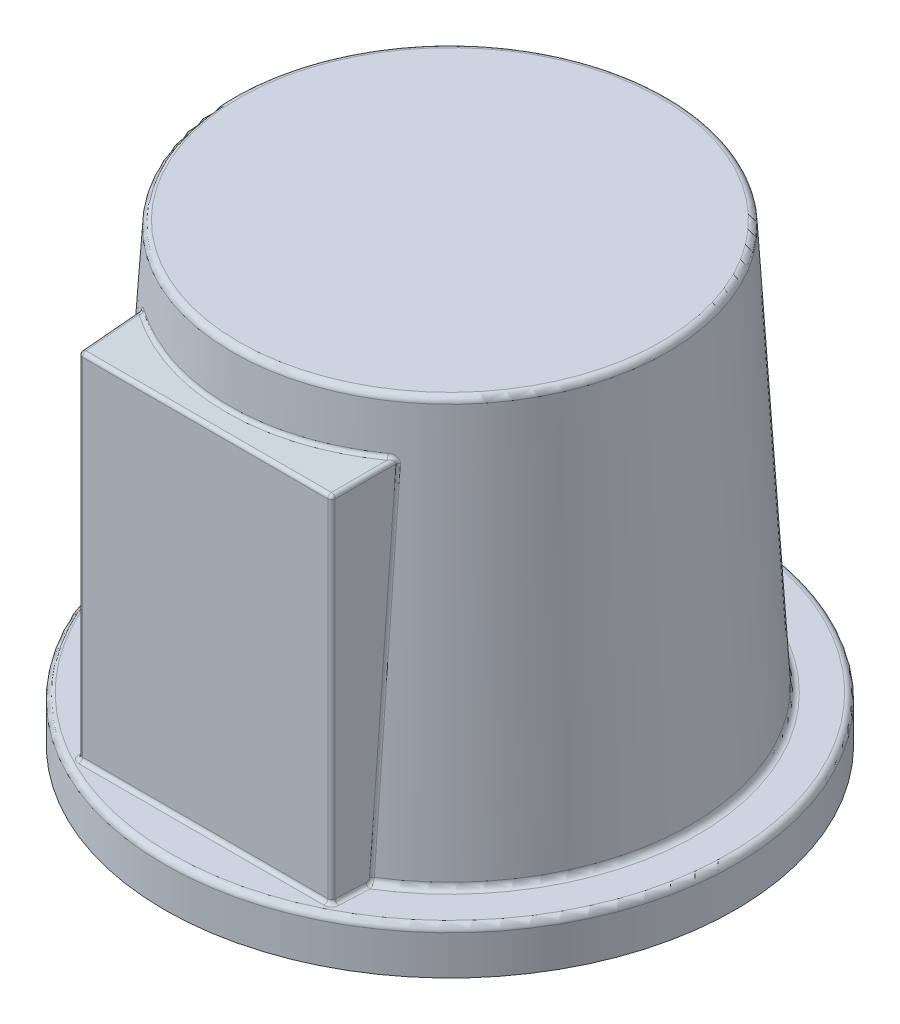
ISO-10303-21;
HEADER;
FILE_DESCRIPTION(('STEP AP214'),'2;1');
FILE_NAME('part.step','',(''),(''),'','','');
FILE_SCHEMA(('AUTOMOTIVE_DESIGN { 1 0 10303 214 1 1 1 1 }'));
ENDSEC;
DATA;
#1=APPLICATION_CONTEXT('core data for automotive mechanical design processes');
#2=APPLICATION_PROTOCOL_DEFINITION('international standard','automotive_design',2000,#1);
#3=PRODUCT_CONTEXT('',#1,'mechanical');
#4=PRODUCT('Part','Part','',(#3));
#5=PRODUCT_RELATED_PRODUCT_CATEGORY('part','',(#4));
#6=PRODUCT_DEFINITION_FORMATION('','',#4);
#7=PRODUCT_DEFINITION_CONTEXT('part definition',#1,'design');
#8=PRODUCT_DEFINITION('design','',#6,#7);
#9=PRODUCT_DEFINITION_SHAPE('','',#8);
#10=(LENGTH_UNIT() NAMED_UNIT(*) SI_UNIT(.MILLI.,.METRE.));
#11=(NAMED_UNIT(*) PLANE_ANGLE_UNIT() SI_UNIT($,.RADIAN.));
#12=(NAMED_UNIT(*) SI_UNIT($,.STERADIAN.) SOLID_ANGLE_UNIT());
#13=UNCERTAINTY_MEASURE_WITH_UNIT(LENGTH_MEASURE(1.E-05),#10,'distance_accuracy_value','');
#14=(GEOMETRIC_REPRESENTATION_CONTEXT(3) GLOBAL_UNCERTAINTY_ASSIGNED_CONTEXT((#13)) GLOBAL_UNIT_ASSIGNED_CONTEXT((#10,
#11,#12)) REPRESENTATION_CONTEXT('',''));
#15=CARTESIAN_POINT('',(0.,0.,0.));
#16=DIRECTION('',(0.,0.,1.));
#17=DIRECTION('',(1.,0.,0.));
#18=AXIS2_PLACEMENT_3D('',#15,#16,#17);
#19=CARTESIAN_POINT('',(-64.0267888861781,148.043901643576,10.6432239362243));
#20=DIRECTION('',(0.,1.,0.));
#21=DIRECTION('',(0.,0.,1.));
#22=AXIS2_PLACEMENT_3D('',#19,#20,#21);
#23=PLANE('',#22);
#24=CARTESIAN_POINT('',(20.9732111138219,148.043901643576,10.6432239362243));
#25=DIRECTION('',(0.,1.,0.));
#26=DIRECTION('',(0.,0.,1.));
#27=AXIS2_PLACEMENT_3D('',#24,#25,#26);
#28=CIRCLE('',#27,83.5757463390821);
#29=CARTESIAN_POINT('',(20.9732111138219,148.043901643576,94.2189702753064));
#30=VERTEX_POINT('',#29);
#31=EDGE_CURVE('E151',#30,#30,#28,.T.);
#32=ORIENTED_EDGE('',*,*,#31,.T.);
#33=EDGE_LOOP('',(#32));
#34=FACE_BOUND('',#33,.T.);
#35=ADVANCED_FACE('F31',(#34),#23,.T.);
#36=CARTESIAN_POINT('',(20.9732111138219,-13.9560983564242,10.6432239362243));
#37=DIRECTION('',(0.,-1.,0.));
#38=DIRECTION('',(0.,0.,1.));
#39=AXIS2_PLACEMENT_3D('',#36,#37,#38);
#40=CONICAL_SURFACE('',#39,95.4723168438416,0.058817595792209);
#41=CARTESIAN_POINT('',(20.9732111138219,145.690860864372,10.6432239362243));
#42=DIRECTION('',(0.,-1.,0.));
#43=DIRECTION('',(0.,0.,-1.));
#44=AXIS2_PLACEMENT_3D('',#41,#42,#43);
#45=CIRCLE('',#44,86.0714231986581);
#46=CARTESIAN_POINT('',(20.9732111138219,145.690860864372,-75.4281992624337));
#47=VERTEX_POINT('',#46);
#48=EDGE_CURVE('E516',#47,#47,#45,.T.);
#49=ORIENTED_EDGE('',*,*,#48,.T.);
#50=EDGE_LOOP('',(#49));
#51=FACE_BOUND('',#50,.T.);
#52=CARTESIAN_POINT('',(20.9732111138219,127.794834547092,97.7684638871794));
#53=CARTESIAN_POINT('',(20.9732111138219,126.443484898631,97.8480388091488));
#54=CARTESIAN_POINT('',(20.9732111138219,126.384437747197,99.200440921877));
#55=CARTESIAN_POINT('',(22.869118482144,127.794834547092,97.7684638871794));
#56=CARTESIAN_POINT('',(22.8721417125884,126.443484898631,97.8480388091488));
#57=CARTESIAN_POINT('',(22.9017031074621,126.384437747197,99.200440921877));
#58=CARTESIAN_POINT('',(24.7650258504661,127.797590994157,97.7063948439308));
#59=CARTESIAN_POINT('',(24.7711256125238,126.44620109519,97.7858276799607));
#60=CARTESIAN_POINT('',(24.8301951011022,126.387194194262,99.1373079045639));
#61=CARTESIAN_POINT('',(28.5487053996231,127.80860488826,97.4583865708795));
#62=CARTESIAN_POINT('',(28.5608238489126,126.457053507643,97.5372665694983));
#63=CARTESIAN_POINT('',(28.6789051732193,126.398208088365,98.8850482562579));
#64=CARTESIAN_POINT('',(30.4364775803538,127.816862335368,97.2724473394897));
#65=CARTESIAN_POINT('',(30.4516438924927,126.46519033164,97.3509026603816));
#66=CARTESIAN_POINT('',(30.5991232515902,126.406465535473,98.6959216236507));
#67=CARTESIAN_POINT('',(34.1958478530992,127.838842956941,96.7774931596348));
#68=CARTESIAN_POINT('',(34.2169499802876,126.486848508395,96.8548488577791));
#69=CARTESIAN_POINT('',(34.4231094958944,126.428446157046,98.1924826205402));
#70=CARTESIAN_POINT('',(36.0674454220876,127.852566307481,96.4684742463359));
#71=CARTESIAN_POINT('',(36.0915385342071,126.500371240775,96.5451273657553));
#72=CARTESIAN_POINT('',(36.3268771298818,126.442169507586,97.8781662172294));
#73=CARTESIAN_POINT('',(39.7863758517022,127.885419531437,95.7286941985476));
#74=CARTESIAN_POINT('',(39.81626771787,126.532742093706,95.803712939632));
#75=CARTESIAN_POINT('',(40.109733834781,126.475022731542,97.125703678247));
#76=CARTESIAN_POINT('',(41.6337087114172,127.904549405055,95.2979330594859));
#77=CARTESIAN_POINT('',(41.66650698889,126.551591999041,95.3719791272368));
#78=CARTESIAN_POINT('',(41.988822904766,126.49415260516,96.6875575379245));
#79=CARTESIAN_POINT('',(45.2963011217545,127.94813452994,94.3164962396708));
#80=CARTESIAN_POINT('',(45.3347087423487,126.594536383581,94.3883910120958));
#81=CARTESIAN_POINT('',(45.7143806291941,126.537737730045,95.6892940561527));
#82=CARTESIAN_POINT('',(47.111558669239,127.972590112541,93.7658130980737));
#83=CARTESIAN_POINT('',(47.1527617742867,126.618633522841,93.8364757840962));
#84=CARTESIAN_POINT('',(47.5608472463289,126.562193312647,95.1291691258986));
#85=CARTESIAN_POINT('',(50.702099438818,128.026720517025,92.5469228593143));
#86=CARTESIAN_POINT('',(50.7486722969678,126.671966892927,92.6149407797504));
#87=CARTESIAN_POINT('',(51.2131241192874,126.616323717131,93.889379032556));
#88=CARTESIAN_POINT('',(52.4773826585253,128.05639533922,91.8787157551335));
#89=CARTESIAN_POINT('',(52.5266147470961,126.701205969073,91.9452558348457));
#90=CARTESIAN_POINT('',(53.0189343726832,126.645998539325,93.2097138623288));
#91=CARTESIAN_POINT('',(55.9805208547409,128.120839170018,90.4275941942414));
#92=CARTESIAN_POINT('',(56.0348361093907,126.76469907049,90.4910247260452));
#93=CARTESIAN_POINT('',(56.5823172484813,126.710442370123,91.7337074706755));
#94=CARTESIAN_POINT('',(57.7083716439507,128.155608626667,89.6446696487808));
#95=CARTESIAN_POINT('',(57.7651866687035,126.798956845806,89.7063926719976));
#96=CARTESIAN_POINT('',(58.3398856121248,126.745211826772,90.9373559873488));
#97=CARTESIAN_POINT('',(61.1090803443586,128.230089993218,87.9675306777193));
#98=CARTESIAN_POINT('',(61.1706482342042,126.872336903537,88.0257130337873));
#99=CARTESIAN_POINT('',(61.799090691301,126.819693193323,89.2314522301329));
#100=CARTESIAN_POINT('',(62.7819382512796,128.269801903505,87.0733162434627));
#101=CARTESIAN_POINT('',(62.8458247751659,126.911462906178,87.1295802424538));
#102=CARTESIAN_POINT('',(63.5007274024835,126.85940510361,88.3218999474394));
#103=CARTESIAN_POINT('',(66.06567598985,128.354001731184,85.1773463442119));
#104=CARTESIAN_POINT('',(66.133945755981,126.994414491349,85.2296765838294));
#105=CARTESIAN_POINT('',(66.8409644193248,126.943604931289,86.3934068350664));
#106=CARTESIAN_POINT('',(67.6765491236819,128.398490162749,84.1755793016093));
#107=CARTESIAN_POINT('',(67.7469374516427,127.038244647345,84.2258009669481));
#108=CARTESIAN_POINT('',(68.4795579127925,126.988093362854,85.3744542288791));
#109=CARTESIAN_POINT('',(70.8292333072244,128.492048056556,82.0688955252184));
#110=CARTESIAN_POINT('',(70.9036001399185,127.130411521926,82.1148324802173));
#111=CARTESIAN_POINT('',(71.6865030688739,127.081651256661,83.2316261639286));
#112=CARTESIAN_POINT('',(72.3710443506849,128.541117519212,80.9639787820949));
#113=CARTESIAN_POINT('',(72.4473127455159,127.178752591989,81.0076399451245));
#114=CARTESIAN_POINT('',(73.2548547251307,127.130720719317,82.1077506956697));
#115=CARTESIAN_POINT('',(75.3791916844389,128.643632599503,78.6556098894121));
#116=CARTESIAN_POINT('',(75.4590041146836,127.279738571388,78.6946807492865));
#117=CARTESIAN_POINT('',(76.3147935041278,127.233235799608,79.7597693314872));
#118=CARTESIAN_POINT('',(76.8455188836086,128.697078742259,77.4521459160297));
#119=CARTESIAN_POINT('',(76.9270021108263,127.3323885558,77.4887978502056));
#120=CARTESIAN_POINT('',(77.8063713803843,127.286681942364,78.5356514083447));
#121=CARTESIAN_POINT('',(79.696232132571,128.808112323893,74.9519720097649));
#122=CARTESIAN_POINT('',(79.7808001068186,127.441760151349,74.9837764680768));
#123=CARTESIAN_POINT('',(80.7061850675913,127.397715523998,75.9925642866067));
#124=CARTESIAN_POINT('',(81.0806181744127,128.865699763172,73.6552620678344));
#125=CARTESIAN_POINT('',(81.1666148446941,127.498486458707,73.6845304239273));
#126=CARTESIAN_POINT('',(82.1144208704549,127.455302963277,74.6735950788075));
#127=CARTESIAN_POINT('',(83.7617031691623,128.984775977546,70.9740005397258));
#128=CARTESIAN_POINT('',(83.8503065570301,127.615773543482,70.9982145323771));
#129=CARTESIAN_POINT('',(84.8417055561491,127.574379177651,71.946301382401));
#130=CARTESIAN_POINT('',(85.0583911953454,129.046265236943,69.5894380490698));
#131=CARTESIAN_POINT('',(85.1481732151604,127.676339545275,69.6110250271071));
#132=CARTESIAN_POINT('',(86.1607433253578,127.635868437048,70.537965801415));
#133=CARTESIAN_POINT('',(87.5583563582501,129.172874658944,66.7385618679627));
#134=CARTESIAN_POINT('',(87.6502536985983,127.801038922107,66.7549397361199));
#135=CARTESIAN_POINT('',(88.7038094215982,127.76247785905,67.6381332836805));
#136=CARTESIAN_POINT('',(88.761633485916,129.2379948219,65.2722481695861));
#137=CARTESIAN_POINT('',(88.8544541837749,127.865177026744,65.2859356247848));
#138=CARTESIAN_POINT('',(89.9278377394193,127.827598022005,66.1466363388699));
#139=CARTESIAN_POINT('',(91.0697829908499,129.3715946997,62.2639806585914));
#140=CARTESIAN_POINT('',(91.164220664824,127.99675272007,62.2723567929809));
#141=CARTESIAN_POINT('',(92.2758047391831,127.961197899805,63.0866960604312));
#142=CARTESIAN_POINT('',(92.1746435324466,129.440074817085,60.7220177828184));
#143=CARTESIAN_POINT('',(92.269747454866,128.064195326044,60.7276671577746));
#144=CARTESIAN_POINT('',(93.3997313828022,128.02967801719,61.5182435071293));
#145=CARTESIAN_POINT('',(94.2810873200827,129.580093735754,57.5692275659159));
#146=CARTESIAN_POINT('',(94.3773084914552,128.202083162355,57.5695164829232));
#147=CARTESIAN_POINT('',(95.54253805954,128.169696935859,58.3112830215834));
#148=CARTESIAN_POINT('',(95.2826705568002,129.651632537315,55.9584002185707));
#149=CARTESIAN_POINT('',(95.3793019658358,128.272532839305,55.9559535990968));
#150=CARTESIAN_POINT('',(96.5614180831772,128.24123573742,56.6727750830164));
#151=CARTESIAN_POINT('',(97.1783949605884,129.797470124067,52.6746078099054));
#152=CARTESIAN_POINT('',(97.2756488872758,128.416140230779,52.6668035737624));
#153=CARTESIAN_POINT('',(98.4898943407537,128.387073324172,53.3325451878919));
#154=CARTESIAN_POINT('',(98.0725245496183,129.871769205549,51.0016360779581));
#155=CARTESIAN_POINT('',(98.1699369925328,128.489302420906,50.9911139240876));
#156=CARTESIAN_POINT('',(99.3994787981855,128.461372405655,51.6308164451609));
#157=CARTESIAN_POINT('',(99.7494092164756,130.022801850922,47.6008850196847));
#158=CARTESIAN_POINT('',(99.8469599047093,128.638013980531,47.5850592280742));
#159=CARTESIAN_POINT('',(101.105362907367,128.612405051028,48.1716001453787));
#160=CARTESIAN_POINT('',(100.532164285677,130.099535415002,45.8731056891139));
#161=CARTESIAN_POINT('',(100.629628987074,128.713567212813,45.8546057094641));
#162=CARTESIAN_POINT('',(101.901662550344,128.689138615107,46.4141125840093));
#163=CARTESIAN_POINT('',(101.983032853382,130.255115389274,42.3699824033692));
#164=CARTESIAN_POINT('',(102.080167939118,128.866743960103,42.3462814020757));
#165=CARTESIAN_POINT('',(103.37765271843,128.844718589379,42.8507453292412));
#166=CARTESIAN_POINT('',(102.651136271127,130.333961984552,40.5946342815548));
#167=CARTESIAN_POINT('',(102.74795093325,128.944371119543,40.5683271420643));
#168=CARTESIAN_POINT('',(104.057332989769,128.923565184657,41.04486139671));
#169=CARTESIAN_POINT('',(103.869775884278,130.493424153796,37.0041168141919));
#170=CARTESIAN_POINT('',(103.965814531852,129.101357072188,36.9727576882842));
#171=CARTESIAN_POINT('',(105.297107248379,129.083027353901,37.3925772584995));
#172=CARTESIAN_POINT('',(104.420312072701,130.574039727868,35.1889474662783));
#173=CARTESIAN_POINT('',(104.515808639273,129.180718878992,35.1550734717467));
#174=CARTESIAN_POINT('',(105.857201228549,129.163642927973,35.546177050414));
#175=CARTESIAN_POINT('',(105.401507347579,130.736700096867,31.526438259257));
#176=CARTESIAN_POINT('',(105.495808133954,129.340839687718,31.4877040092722));
#177=CARTESIAN_POINT('',(106.855452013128,129.326303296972,31.8206420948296));
#178=CARTESIAN_POINT('',(105.832158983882,130.818744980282,29.6790964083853));
#179=CARTESIAN_POINT('',(105.925711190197,129.421601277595,29.6379594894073));
#180=CARTESIAN_POINT('',(107.293601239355,129.408348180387,29.941505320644));
#181=CARTESIAN_POINT('',(106.571709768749,130.983908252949,25.9602520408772));
#182=CARTESIAN_POINT('',(106.663677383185,129.584171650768,25.9144857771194));
#183=CARTESIAN_POINT('',(108.046053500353,129.573511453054,26.1586444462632));
#184=CARTESIAN_POINT('',(106.880608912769,131.067026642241,24.0887495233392));
#185=CARTESIAN_POINT('',(106.971638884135,129.665982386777,24.0407118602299));
#186=CARTESIAN_POINT('',(108.360356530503,129.656629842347,24.2549203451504));
#187=CARTESIAN_POINT('',(107.375350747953,131.233984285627,20.3295242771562));
#188=CARTESIAN_POINT('',(107.464442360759,129.830304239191,20.2771226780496));
#189=CARTESIAN_POINT('',(108.863788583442,129.823587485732,20.4309616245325));
#190=CARTESIAN_POINT('',(107.561189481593,131.317823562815,18.4418010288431));
#191=CARTESIAN_POINT('',(107.649173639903,129.91281673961,18.3872757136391));
#192=CARTESIAN_POINT('',(109.052913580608,129.90742676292,18.5107264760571));
#193=CARTESIAN_POINT('',(107.809005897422,131.485861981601,14.6582628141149));
#194=CARTESIAN_POINT('',(107.894736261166,130.078187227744,14.5996688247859));
#195=CARTESIAN_POINT('',(109.30516966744,130.075465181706,14.6620139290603));
#196=CARTESIAN_POINT('',(107.870983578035,131.570061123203,12.7624478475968));
#197=CARTESIAN_POINT('',(107.955457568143,130.161045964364,12.7018917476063));
#198=CARTESIAN_POINT('',(109.368300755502,130.159664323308,12.7335365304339));
#199=CARTESIAN_POINT('',(107.870815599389,131.738459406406,8.97082892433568));
#200=CARTESIAN_POINT('',(107.952761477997,130.326755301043,8.90652395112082));
#201=CARTESIAN_POINT('',(109.368300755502,130.328062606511,8.87658173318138));
#202=CARTESIAN_POINT('',(107.80866994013,131.822658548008,7.07502496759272));
#203=CARTESIAN_POINT('',(107.889232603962,130.409606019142,7.00893052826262));
#204=CARTESIAN_POINT('',(109.30516966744,130.412261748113,6.94810433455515));
#205=CARTESIAN_POINT('',(107.560520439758,131.990696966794,3.29153060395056));
#206=CARTESIAN_POINT('',(107.638323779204,130.574945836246,3.2220261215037));
#207=CARTESIAN_POINT('',(109.052913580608,130.580300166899,3.09939178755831));
#208=CARTESIAN_POINT('',(107.374516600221,132.074536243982,1.40384019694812));
#209=CARTESIAN_POINT('',(107.450832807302,130.657434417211,1.33272700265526));
#210=CARTESIAN_POINT('',(108.863788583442,130.664139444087,1.17915663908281));
#211=CARTESIAN_POINT('',(106.879450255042,132.241493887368,-2.35529809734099));
#212=CARTESIAN_POINT('',(106.952820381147,130.821695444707,-2.42946905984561));
#213=CARTESIAN_POINT('',(108.360356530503,130.831097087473,-2.64480208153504));
#214=CARTESIAN_POINT('',(106.570391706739,132.32461227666,-4.22674650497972));
#215=CARTESIAN_POINT('',(106.642194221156,130.903466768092,-4.30234027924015));
#216=CARTESIAN_POINT('',(108.046053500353,130.914215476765,-4.54852618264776));
#217=CARTESIAN_POINT('',(105.83053053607,132.489775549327,-7.94546230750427));
#218=CARTESIAN_POINT('',(105.899245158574,131.065947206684,-8.02375415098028));
#219=CARTESIAN_POINT('',(107.293601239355,131.079378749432,-8.33138705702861));
#220=CARTESIAN_POINT('',(105.399727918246,132.571820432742,-9.79272970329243));
#221=CARTESIAN_POINT('',(105.466817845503,131.146654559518,-9.87225643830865));
#222=CARTESIAN_POINT('',(106.855452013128,131.161423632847,-10.2105238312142));
#223=CARTESIAN_POINT('',(104.418241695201,132.734480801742,-13.455070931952));
#224=CARTESIAN_POINT('',(104.4821467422,131.306657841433,-13.5369340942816));
#225=CARTESIAN_POINT('',(105.857201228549,131.324084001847,-13.9360587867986));
#226=CARTESIAN_POINT('',(103.867565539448,132.815096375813,-15.2701467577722));
#227=CARTESIAN_POINT('',(103.929812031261,131.385951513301,-15.3530577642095));
#228=CARTESIAN_POINT('',(105.297107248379,131.404699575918,-15.7824589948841));
#229=CARTESIAN_POINT('',(102.648659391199,132.974558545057,-18.8604597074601));
#230=CARTESIAN_POINT('',(102.70766773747,131.542794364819,-18.9453496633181));
#231=CARTESIAN_POINT('',(104.057332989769,131.564161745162,-19.4347431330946));
#232=CARTESIAN_POINT('',(101.980429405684,133.053405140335,-20.6356968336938));
#233=CARTESIAN_POINT('',(102.037767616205,131.620340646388,-20.7214515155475));
#234=CARTESIAN_POINT('',(103.37765271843,131.64300834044,-21.2406270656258));
#235=CARTESIAN_POINT('',(100.529323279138,133.208985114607,-24.138582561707));
#236=CARTESIAN_POINT('',(100.583412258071,131.773351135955,-24.22596789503));
#237=CARTESIAN_POINT('',(101.901662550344,131.798588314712,-24.803994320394));
#238=CARTESIAN_POINT('',(99.7464572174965,133.285718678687,-25.8662353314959));
#239=CARTESIAN_POINT('',(99.7988859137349,131.848812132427,-25.9543088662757));
#240=CARTESIAN_POINT('',(101.105362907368,131.875321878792,-26.5614818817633));
#241=CARTESIAN_POINT('',(98.0693680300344,133.43675132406,-29.2667198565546));
#242=CARTESIAN_POINT('',(98.1185759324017,131.997337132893,-29.3560906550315));
#243=CARTESIAN_POINT('',(99.3994787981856,132.026354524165,-30.0206981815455));
#244=CARTESIAN_POINT('',(97.1751449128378,133.511050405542,-30.9395516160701));
#245=CARTESIAN_POINT('',(97.222722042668,132.070397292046,-31.0294434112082));
#246=CARTESIAN_POINT('',(98.4898943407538,132.100653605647,-31.7224269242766));
#247=CARTESIAN_POINT('',(95.2792525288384,133.656887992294,-34.2230530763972));
#248=CARTESIAN_POINT('',(95.3236740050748,132.213800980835,-34.3139278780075));
#249=CARTESIAN_POINT('',(96.5614180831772,132.246491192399,-35.0626568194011));
#250=CARTESIAN_POINT('',(94.2775948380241,133.728426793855,-35.8337294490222));
#251=CARTESIAN_POINT('',(94.3204332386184,132.284140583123,-35.9249696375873));
#252=CARTESIAN_POINT('',(95.5425380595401,132.31802999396,-36.7011647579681));
#253=CARTESIAN_POINT('',(92.1710224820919,133.868445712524,-38.9862092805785));
#254=CARTESIAN_POINT('',(92.2108030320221,132.421811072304,-39.0781422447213));
#255=CARTESIAN_POINT('',(93.3997313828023,132.458048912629,-39.9081252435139));
#256=CARTESIAN_POINT('',(91.0661078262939,133.936925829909,-40.5280127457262));
#257=CARTESIAN_POINT('',(91.1043687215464,132.489137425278,-40.6201692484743));
#258=CARTESIAN_POINT('',(92.2758047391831,132.526529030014,-41.4765777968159));
#259=CARTESIAN_POINT('',(88.7578713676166,134.070525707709,-43.5359557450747));
#260=CARTESIAN_POINT('',(88.7932010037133,132.620485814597,-43.628541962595));
#261=CARTESIAN_POINT('',(89.9278377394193,132.660128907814,-44.5365180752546));
#262=CARTESIAN_POINT('',(87.5545613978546,134.135645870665,-45.0021043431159));
#263=CARTESIAN_POINT('',(87.5884485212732,132.684503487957,-45.0947877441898));
#264=CARTESIAN_POINT('',(88.7038094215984,132.72524907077,-46.0280150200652));
#265=CARTESIAN_POINT('',(85.0545523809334,134.262255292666,-47.8526474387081));
#266=CARTESIAN_POINT('',(85.0856585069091,132.808969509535,-47.9455283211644));
#267=CARTESIAN_POINT('',(86.1607433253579,132.851858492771,-48.9278475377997));
#268=CARTESIAN_POINT('',(83.7578533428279,134.323744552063,-49.2370419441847));
#269=CARTESIAN_POINT('',(83.7876048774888,132.86941294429,-49.3299105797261));
#270=CARTESIAN_POINT('',(84.8417055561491,132.913347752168,-50.3361831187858));
#271=CARTESIAN_POINT('',(81.0767683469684,134.442820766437,-51.9179675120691));
#272=CARTESIAN_POINT('',(81.1039081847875,132.986464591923,-52.01083407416));
#273=CARTESIAN_POINT('',(82.1144208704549,133.032423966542,-53.0634768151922));
#274=CARTESIAN_POINT('',(79.6923933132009,134.500408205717,-53.2145094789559));
#275=CARTESIAN_POINT('',(79.7182748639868,133.043068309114,-53.3072723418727));
#276=CARTESIAN_POINT('',(80.7061850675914,133.090011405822,-54.3824460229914));
#277=CARTESIAN_POINT('',(76.8417239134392,134.61144178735,-55.7143502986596));
#278=CARTESIAN_POINT('',(76.8651763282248,133.152206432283,-55.8069463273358));
#279=CARTESIAN_POINT('',(77.8063713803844,133.201044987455,-56.9255331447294));
#280=CARTESIAN_POINT('',(75.3754295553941,134.664887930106,-56.9176491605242));
#281=CARTESIAN_POINT('',(75.3977251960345,133.204735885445,-57.0100686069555));
#282=CARTESIAN_POINT('',(76.3147935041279,133.254491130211,-58.1496510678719));
#283=CARTESIAN_POINT('',(72.3673691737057,134.767403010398,-59.2256935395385));
#284=CARTESIAN_POINT('',(72.3874264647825,133.305494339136,-59.3178166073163));
#285=CARTESIAN_POINT('',(73.2548547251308,133.357006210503,-60.4976324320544));
#286=CARTESIAN_POINT('',(70.8256122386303,134.816472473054,-60.3304508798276));
#287=CARTESIAN_POINT('',(70.8446168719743,133.353719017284,-60.4223433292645));
#288=CARTESIAN_POINT('',(71.686503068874,133.406075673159,-61.6215079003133));
#289=CARTESIAN_POINT('',(67.6730566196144,134.91003036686,-62.4368242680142));
#290=CARTESIAN_POINT('',(67.6900159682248,133.445668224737,-62.5283264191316));
#291=CARTESIAN_POINT('',(68.4795579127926,133.499633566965,-63.7643359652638));
#292=CARTESIAN_POINT('',(66.0622579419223,134.954518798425,-63.438440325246));
#293=CARTESIAN_POINT('',(66.0782682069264,133.489388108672,-63.5296763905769));
#294=CARTESIAN_POINT('',(66.8409644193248,133.54412199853,-64.7832885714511));
#295=CARTESIAN_POINT('',(62.7786881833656,135.038718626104,-65.334119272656));
#296=CARTESIAN_POINT('',(62.7928434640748,133.57213560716,-65.4249056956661));
#297=CARTESIAN_POINT('',(63.5007274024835,133.628321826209,-66.7117816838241));
#298=CARTESIAN_POINT('',(61.1059237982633,135.078430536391,-66.2281937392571));
#299=CARTESIAN_POINT('',(61.1192304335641,133.611159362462,-66.3186966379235));
#300=CARTESIAN_POINT('',(61.799090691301,133.668033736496,-67.6213339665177));
#301=CARTESIAN_POINT('',(57.7054196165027,135.152911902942,-67.9050661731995));
#302=CARTESIAN_POINT('',(57.7170532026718,133.684352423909,-67.995093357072));
#303=CARTESIAN_POINT('',(58.3398856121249,133.742515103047,-69.3272377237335));
#304=CARTESIAN_POINT('',(55.9776798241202,135.187681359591,-68.6878641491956));
#305=CARTESIAN_POINT('',(55.9885592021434,133.718517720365,-68.7776072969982));
#306=CARTESIAN_POINT('',(56.5823172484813,133.777284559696,-70.1235892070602));
#307=CARTESIAN_POINT('',(52.4747791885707,135.25212519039,-70.1387481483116));
#308=CARTESIAN_POINT('',(52.4841544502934,133.781844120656,-70.2280203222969));
#309=CARTESIAN_POINT('',(53.0189343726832,133.841728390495,-71.5995955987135));
#310=CARTESIAN_POINT('',(50.6996225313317,135.281800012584,-70.8068442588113));
#311=CARTESIAN_POINT('',(50.7083296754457,133.811002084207,-70.8958474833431));
#312=CARTESIAN_POINT('',(51.2131241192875,133.871403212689,-72.2792607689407));
#313=CARTESIAN_POINT('',(47.1093482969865,135.335930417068,-72.0255299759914));
#314=CARTESIAN_POINT('',(47.1167024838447,133.864191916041,-72.1140949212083));
#315=CARTESIAN_POINT('',(47.560847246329,133.925533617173,-73.5190508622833));
#316=CARTESIAN_POINT('',(45.2942307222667,135.360385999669,-72.5761195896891));
#317=CARTESIAN_POINT('',(45.3009921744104,133.888220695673,-72.664444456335));
#318=CARTESIAN_POINT('',(45.7143806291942,133.949989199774,-74.0791757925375));
#319=CARTESIAN_POINT('',(41.6319292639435,135.403971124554,-73.5573884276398));
#320=CARTESIAN_POINT('',(41.637467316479,133.931047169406,-73.6453319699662));
#321=CARTESIAN_POINT('',(41.988822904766,133.99357432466,-75.0774392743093));
#322=CARTESIAN_POINT('',(39.7847473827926,135.423100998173,-73.9880751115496));
#323=CARTESIAN_POINT('',(39.7897555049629,133.949842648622,-74.075819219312));
#324=CARTESIAN_POINT('',(40.1097338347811,134.012704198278,-75.5155854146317));
#325=CARTESIAN_POINT('',(36.0661273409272,135.455954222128,-74.7277265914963));
#326=CARTESIAN_POINT('',(36.0700164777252,133.982123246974,-74.8151664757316));
#327=CARTESIAN_POINT('',(36.3268771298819,134.045557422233,-76.2680479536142));
#328=CARTESIAN_POINT('',(34.1946891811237,135.469677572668,-75.0366913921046));
#329=CARTESIAN_POINT('',(34.1980969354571,133.99560641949,-75.1239818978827));
#330=CARTESIAN_POINT('',(34.4231094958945,134.059280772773,-76.582364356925));
#331=CARTESIAN_POINT('',(30.4356434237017,135.491658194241,-75.5315586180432));
#332=CARTESIAN_POINT('',(30.4380088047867,134.017203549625,-75.6186375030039));
#333=CARTESIAN_POINT('',(30.5991232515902,134.081261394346,-77.0858033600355));
#334=CARTESIAN_POINT('',(28.5480363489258,135.49991564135,-75.7174650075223));
#335=CARTESIAN_POINT('',(28.5499534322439,134.025316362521,-75.8044514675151));
#336=CARTESIAN_POINT('',(28.6789051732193,134.089518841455,-77.2749299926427));
#337=CARTESIAN_POINT('',(24.7646898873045,135.510929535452,-75.9654294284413));
#338=CARTESIAN_POINT('',(24.7656113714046,134.036137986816,-76.0523074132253));
#339=CARTESIAN_POINT('',(24.8301951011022,134.100532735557,-77.5271896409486));
#340=CARTESIAN_POINT('',(22.8689505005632,135.513685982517,-76.0274874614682));
#341=CARTESIAN_POINT('',(22.8694404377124,134.038846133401,-76.114334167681));
#342=CARTESIAN_POINT('',(22.9017031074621,134.103289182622,-77.5903226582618));
#343=CARTESIAN_POINT('',(19.0774717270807,135.513685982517,-76.0274874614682));
#344=CARTESIAN_POINT('',(19.0769817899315,134.038846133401,-76.114334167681));
#345=CARTESIAN_POINT('',(19.0447191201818,134.103289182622,-77.5903226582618));
#346=CARTESIAN_POINT('',(17.1817323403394,135.510929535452,-75.9654294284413));
#347=CARTESIAN_POINT('',(17.1808108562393,134.036137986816,-76.0523074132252));
#348=CARTESIAN_POINT('',(17.1162271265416,134.100532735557,-77.5271896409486));
#349=CARTESIAN_POINT('',(13.3983858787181,135.49991564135,-75.7174650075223));
#350=CARTESIAN_POINT('',(13.3964687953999,134.025316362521,-75.8044514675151));
#351=CARTESIAN_POINT('',(13.2675170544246,134.089518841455,-77.2749299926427));
#352=CARTESIAN_POINT('',(11.5107788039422,135.491658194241,-75.5315586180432));
#353=CARTESIAN_POINT('',(11.5084134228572,134.017203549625,-75.6186375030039));
#354=CARTESIAN_POINT('',(11.3472989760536,134.081261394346,-77.0858033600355));
#355=CARTESIAN_POINT('',(7.75173304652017,135.469677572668,-75.0366913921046));
#356=CARTESIAN_POINT('',(7.74832529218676,133.99560641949,-75.1239818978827));
#357=CARTESIAN_POINT('',(7.52331273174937,134.059280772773,-76.582364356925));
#358=CARTESIAN_POINT('',(5.88029488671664,135.455954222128,-74.7277265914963));
#359=CARTESIAN_POINT('',(5.87640574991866,133.982123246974,-74.8151664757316));
#360=CARTESIAN_POINT('',(5.61954509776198,134.045557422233,-76.2680479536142));
#361=CARTESIAN_POINT('',(2.16167484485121,135.423100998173,-73.9880751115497));
#362=CARTESIAN_POINT('',(2.15666672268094,133.949842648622,-74.075819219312));
#363=CARTESIAN_POINT('',(1.83668839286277,134.012704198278,-75.5155854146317));
#364=CARTESIAN_POINT('',(0.314492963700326,135.403971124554,-73.5573884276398));
#365=CARTESIAN_POINT('',(0.308954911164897,133.931047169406,-73.6453319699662));
#366=CARTESIAN_POINT('',(-0.0424006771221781,133.99357432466,-75.0774392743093));
#367=CARTESIAN_POINT('',(-3.34780849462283,135.360385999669,-72.5761195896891));
#368=CARTESIAN_POINT('',(-3.35456994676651,133.888220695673,-72.664444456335));
#369=CARTESIAN_POINT('',(-3.76795840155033,133.949989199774,-74.0791757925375));
#370=CARTESIAN_POINT('',(-5.16292606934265,135.335930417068,-72.0255299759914));
#371=CARTESIAN_POINT('',(-5.17028025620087,133.864191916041,-72.1140949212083));
#372=CARTESIAN_POINT('',(-5.61442501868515,133.925533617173,-73.5190508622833));
#373=CARTESIAN_POINT('',(-8.75320030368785,135.281800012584,-70.8068442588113));
#374=CARTESIAN_POINT('',(-8.76190744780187,133.811002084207,-70.8958474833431));
#375=CARTESIAN_POINT('',(-9.26670189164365,133.871403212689,-72.2792607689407));
#376=CARTESIAN_POINT('',(-10.5283569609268,135.25212519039,-70.1387481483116));
#377=CARTESIAN_POINT('',(-10.5377322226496,133.781844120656,-70.2280203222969));
#378=CARTESIAN_POINT('',(-11.0725121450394,133.841728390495,-71.5995955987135));
#379=CARTESIAN_POINT('',(-14.0312575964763,135.187681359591,-68.6878641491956));
#380=CARTESIAN_POINT('',(-14.0421369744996,133.718517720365,-68.7776072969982));
#381=CARTESIAN_POINT('',(-14.6358950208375,133.777284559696,-70.1235892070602));
#382=CARTESIAN_POINT('',(-15.7589973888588,135.152911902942,-67.9050661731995));
#383=CARTESIAN_POINT('',(-15.770630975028,133.684352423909,-67.995093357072));
#384=CARTESIAN_POINT('',(-16.393463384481,133.742515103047,-69.3272377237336));
#385=CARTESIAN_POINT('',(-19.1595015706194,135.078430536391,-66.2281937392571));
#386=CARTESIAN_POINT('',(-19.1728082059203,133.611159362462,-66.3186966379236));
#387=CARTESIAN_POINT('',(-19.8526684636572,133.668033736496,-67.6213339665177));
#388=CARTESIAN_POINT('',(-20.8322659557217,135.038718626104,-65.334119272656));
#389=CARTESIAN_POINT('',(-20.8464212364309,133.57213560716,-65.4249056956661));
#390=CARTESIAN_POINT('',(-21.5543051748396,133.628321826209,-66.7117816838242));
#391=CARTESIAN_POINT('',(-24.1158357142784,134.954518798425,-63.438440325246));
#392=CARTESIAN_POINT('',(-24.1318459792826,133.489388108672,-63.5296763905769));
#393=CARTESIAN_POINT('',(-24.894542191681,133.54412199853,-64.7832885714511));
#394=CARTESIAN_POINT('',(-25.7266343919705,134.91003036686,-62.4368242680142));
#395=CARTESIAN_POINT('',(-25.743593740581,133.445668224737,-62.5283264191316));
#396=CARTESIAN_POINT('',(-26.5331356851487,133.499633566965,-63.7643359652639));
#397=CARTESIAN_POINT('',(-28.8791900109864,134.816472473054,-60.3304508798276));
#398=CARTESIAN_POINT('',(-28.8981946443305,133.353719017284,-60.4223433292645));
#399=CARTESIAN_POINT('',(-29.7400808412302,133.406075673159,-61.6215079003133));
#400=CARTESIAN_POINT('',(-30.4209469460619,134.767403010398,-59.2256935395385));
#401=CARTESIAN_POINT('',(-30.4410042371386,133.305494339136,-59.3178166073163));
#402=CARTESIAN_POINT('',(-31.3084324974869,133.357006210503,-60.4976324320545));
#403=CARTESIAN_POINT('',(-33.4290073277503,134.664887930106,-56.9176491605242));
#404=CARTESIAN_POINT('',(-33.4513029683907,133.204735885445,-57.0100686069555));
#405=CARTESIAN_POINT('',(-34.3683712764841,133.254491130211,-58.1496510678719));
#406=CARTESIAN_POINT('',(-34.8953016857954,134.61144178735,-55.7143502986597));
#407=CARTESIAN_POINT('',(-34.918754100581,133.152206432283,-55.8069463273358));
#408=CARTESIAN_POINT('',(-35.8599491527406,133.201044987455,-56.9255331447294));
#409=CARTESIAN_POINT('',(-37.745971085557,134.500408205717,-53.214509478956));
#410=CARTESIAN_POINT('',(-37.7718526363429,133.043068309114,-53.3072723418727));
#411=CARTESIAN_POINT('',(-38.7597628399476,133.090011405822,-54.3824460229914));
#412=CARTESIAN_POINT('',(-39.1303461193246,134.442820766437,-51.9179675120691));
#413=CARTESIAN_POINT('',(-39.1574859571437,132.986464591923,-52.01083407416));
#414=CARTESIAN_POINT('',(-40.167998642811,133.032423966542,-53.0634768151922));
#415=CARTESIAN_POINT('',(-41.811431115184,134.323744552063,-49.2370419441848));
#416=CARTESIAN_POINT('',(-41.8411826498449,132.86941294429,-49.3299105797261));
#417=CARTESIAN_POINT('',(-42.8952833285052,132.913347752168,-50.3361831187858));
#418=CARTESIAN_POINT('',(-43.1081301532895,134.262255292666,-47.8526474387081));
#419=CARTESIAN_POINT('',(-43.1392362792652,132.808969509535,-47.9455283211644));
#420=CARTESIAN_POINT('',(-44.214321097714,132.851858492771,-48.9278475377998));
#421=CARTESIAN_POINT('',(-45.6081391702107,134.135645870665,-45.0021043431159));
#422=CARTESIAN_POINT('',(-45.6420262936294,132.684503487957,-45.0947877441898));
#423=CARTESIAN_POINT('',(-46.7573871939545,132.72524907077,-46.0280150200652));
#424=CARTESIAN_POINT('',(-46.8114491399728,134.070525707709,-43.5359557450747));
#425=CARTESIAN_POINT('',(-46.8467787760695,132.620485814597,-43.6285419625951));
#426=CARTESIAN_POINT('',(-47.9814155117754,132.660128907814,-44.5365180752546));
#427=CARTESIAN_POINT('',(-49.1196855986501,133.936925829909,-40.5280127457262));
#428=CARTESIAN_POINT('',(-49.1579464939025,132.489137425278,-40.6201692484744));
#429=CARTESIAN_POINT('',(-50.3293825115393,132.526529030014,-41.476577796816));
#430=CARTESIAN_POINT('',(-50.2246002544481,133.868445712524,-38.9862092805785));
#431=CARTESIAN_POINT('',(-50.2643808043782,132.421811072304,-39.0781422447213));
#432=CARTESIAN_POINT('',(-51.4533091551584,132.458048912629,-39.9081252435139));
#433=CARTESIAN_POINT('',(-52.3311726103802,133.728426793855,-35.8337294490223));
#434=CARTESIAN_POINT('',(-52.3740110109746,132.284140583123,-35.9249696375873));
#435=CARTESIAN_POINT('',(-53.5961158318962,132.31802999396,-36.7011647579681));
#436=CARTESIAN_POINT('',(-53.3328303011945,133.656887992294,-34.2230530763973));
#437=CARTESIAN_POINT('',(-53.3772517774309,132.213800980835,-34.3139278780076));
#438=CARTESIAN_POINT('',(-54.6149958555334,132.246491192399,-35.0626568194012));
#439=CARTESIAN_POINT('',(-55.228722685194,133.511050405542,-30.9395516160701));
#440=CARTESIAN_POINT('',(-55.2762998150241,132.070397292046,-31.0294434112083));
#441=CARTESIAN_POINT('',(-56.5434721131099,132.100653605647,-31.7224269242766));
#442=CARTESIAN_POINT('',(-56.1229458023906,133.43675132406,-29.2667198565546));
#443=CARTESIAN_POINT('',(-56.1721537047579,131.997337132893,-29.3560906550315));
#444=CARTESIAN_POINT('',(-57.4530565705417,132.026354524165,-30.0206981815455));
#445=CARTESIAN_POINT('',(-57.8000349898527,133.285718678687,-25.8662353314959));
#446=CARTESIAN_POINT('',(-57.8524636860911,131.848812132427,-25.9543088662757));
#447=CARTESIAN_POINT('',(-59.1589406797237,131.875321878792,-26.5614818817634));
#448=CARTESIAN_POINT('',(-58.5829010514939,133.208985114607,-24.138582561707));
#449=CARTESIAN_POINT('',(-58.6369900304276,131.773351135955,-24.22596789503));
#450=CARTESIAN_POINT('',(-59.9552403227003,131.798588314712,-24.803994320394));
#451=CARTESIAN_POINT('',(-60.03400717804,133.053405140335,-20.6356968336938));
#452=CARTESIAN_POINT('',(-60.091345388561,131.620340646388,-20.7214515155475));
#453=CARTESIAN_POINT('',(-61.4312304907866,131.64300834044,-21.2406270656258));
#454=CARTESIAN_POINT('',(-60.7022371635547,132.974558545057,-18.8604597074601));
#455=CARTESIAN_POINT('',(-60.7612455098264,131.542794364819,-18.945349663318));
#456=CARTESIAN_POINT('',(-62.1109107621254,131.564161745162,-19.4347431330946));
#457=CARTESIAN_POINT('',(-61.921143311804,132.815096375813,-15.2701467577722));
#458=CARTESIAN_POINT('',(-61.9833898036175,131.385951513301,-15.3530577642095));
#459=CARTESIAN_POINT('',(-63.3506850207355,131.404699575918,-15.7824589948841));
#460=CARTESIAN_POINT('',(-62.4718194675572,132.734480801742,-13.455070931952));
#461=CARTESIAN_POINT('',(-62.5357245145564,131.306657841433,-13.5369340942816));
#462=CARTESIAN_POINT('',(-63.9107790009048,131.324084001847,-13.9360587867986));
#463=CARTESIAN_POINT('',(-63.4533056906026,132.571820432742,-9.79272970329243));
#464=CARTESIAN_POINT('',(-63.5203956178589,131.146654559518,-9.87225643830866));
#465=CARTESIAN_POINT('',(-64.9090297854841,131.161423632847,-10.2105238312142));
#466=CARTESIAN_POINT('',(-63.8841083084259,132.489775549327,-7.94546230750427));
#467=CARTESIAN_POINT('',(-63.9528229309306,131.065947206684,-8.02375415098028));
#468=CARTESIAN_POINT('',(-65.3471790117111,131.079378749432,-8.33138705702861));
#469=CARTESIAN_POINT('',(-64.6239694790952,132.32461227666,-4.22674650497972));
#470=CARTESIAN_POINT('',(-64.6957719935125,130.903466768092,-4.30234027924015));
#471=CARTESIAN_POINT('',(-66.0996312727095,130.914215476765,-4.54852618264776));
#472=CARTESIAN_POINT('',(-64.9330280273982,132.241493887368,-2.35529809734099));
#473=CARTESIAN_POINT('',(-65.0063981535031,130.821695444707,-2.42946905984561));
#474=CARTESIAN_POINT('',(-66.4139343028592,130.831097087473,-2.64480208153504));
#475=CARTESIAN_POINT('',(-65.4280943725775,132.074536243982,1.40384019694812));
#476=CARTESIAN_POINT('',(-65.5044105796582,130.657434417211,1.33272700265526));
#477=CARTESIAN_POINT('',(-66.9173663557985,130.664139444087,1.17915663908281));
#478=CARTESIAN_POINT('',(-65.6140982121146,131.990696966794,3.29153060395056));
#479=CARTESIAN_POINT('',(-65.6919015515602,130.574945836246,3.2220261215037));
#480=CARTESIAN_POINT('',(-67.1064913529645,130.580300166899,3.09939178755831));
#481=CARTESIAN_POINT('',(-65.8622477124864,131.822658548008,7.07502496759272));
#482=CARTESIAN_POINT('',(-65.9428103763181,130.409606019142,7.00893052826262));
#483=CARTESIAN_POINT('',(-67.358747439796,130.412261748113,6.94810433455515));
#484=CARTESIAN_POINT('',(-65.924393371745,131.738459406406,8.97082892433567));
#485=CARTESIAN_POINT('',(-66.006339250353,130.326755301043,8.90652395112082));
#486=CARTESIAN_POINT('',(-67.4218785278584,130.328062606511,8.87658173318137));
#487=CARTESIAN_POINT('',(-65.924561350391,131.570061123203,12.7624478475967));
#488=CARTESIAN_POINT('',(-66.0090353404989,130.161045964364,12.7018917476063));
#489=CARTESIAN_POINT('',(-67.4218785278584,130.159664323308,12.7335365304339));
#490=CARTESIAN_POINT('',(-65.8625836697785,131.485861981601,14.6582628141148));
#491=CARTESIAN_POINT('',(-65.9483140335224,130.078187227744,14.5996688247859));
#492=CARTESIAN_POINT('',(-67.358747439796,130.075465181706,14.6620139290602));
#493=CARTESIAN_POINT('',(-65.6147672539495,131.317823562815,18.4418010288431));
#494=CARTESIAN_POINT('',(-65.702751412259,129.91281673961,18.387275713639));
#495=CARTESIAN_POINT('',(-67.1064913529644,129.90742676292,18.5107264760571));
#496=CARTESIAN_POINT('',(-65.4289285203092,131.233984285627,20.3295242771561));
#497=CARTESIAN_POINT('',(-65.5180201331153,129.830304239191,20.2771226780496));
#498=CARTESIAN_POINT('',(-66.9173663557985,129.823587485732,20.4309616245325));
#499=CARTESIAN_POINT('',(-64.9341866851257,131.067026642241,24.0887495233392));
#500=CARTESIAN_POINT('',(-65.0252166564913,129.665982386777,24.0407118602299));
#501=CARTESIAN_POINT('',(-66.4139343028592,129.656629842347,24.2549203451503));
#502=CARTESIAN_POINT('',(-64.6252875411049,130.983908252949,25.9602520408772));
#503=CARTESIAN_POINT('',(-64.7172551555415,129.584171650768,25.9144857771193));
#504=CARTESIAN_POINT('',(-66.0996312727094,129.573511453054,26.1586444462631));
#505=CARTESIAN_POINT('',(-63.885736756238,130.818744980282,29.6790964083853));
#506=CARTESIAN_POINT('',(-63.9792889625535,129.421601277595,29.6379594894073));
#507=CARTESIAN_POINT('',(-65.3471790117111,129.408348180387,29.941505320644));
#508=CARTESIAN_POINT('',(-63.4550851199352,130.736700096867,31.526438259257));
#509=CARTESIAN_POINT('',(-63.5493859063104,129.340839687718,31.4877040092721));
#510=CARTESIAN_POINT('',(-64.9090297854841,129.326303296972,31.8206420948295));
#511=CARTESIAN_POINT('',(-62.4738898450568,130.574039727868,35.1889474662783));
#512=CARTESIAN_POINT('',(-62.5693864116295,129.180718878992,35.1550734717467));
#513=CARTESIAN_POINT('',(-63.9107790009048,129.163642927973,35.5461770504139));
#514=CARTESIAN_POINT('',(-61.9233536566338,130.493424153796,37.0041168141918));
#515=CARTESIAN_POINT('',(-62.0193923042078,129.101357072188,36.9727576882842));
#516=CARTESIAN_POINT('',(-63.3506850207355,129.083027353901,37.3925772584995));
#517=CARTESIAN_POINT('',(-60.7047140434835,130.333961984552,40.5946342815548));
#518=CARTESIAN_POINT('',(-60.8015287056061,128.944371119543,40.5683271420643));
#519=CARTESIAN_POINT('',(-62.1109107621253,128.923565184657,41.0448613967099));
#520=CARTESIAN_POINT('',(-60.0366106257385,130.255115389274,42.3699824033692));
#521=CARTESIAN_POINT('',(-60.1337457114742,128.866743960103,42.3462814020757));
#522=CARTESIAN_POINT('',(-61.4312304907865,128.844718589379,42.8507453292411));
#523=CARTESIAN_POINT('',(-58.5857420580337,130.099535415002,45.8731056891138));
#524=CARTESIAN_POINT('',(-58.6832067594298,128.713567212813,45.854605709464));
#525=CARTESIAN_POINT('',(-59.9552403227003,128.689138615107,46.4141125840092));
#526=CARTESIAN_POINT('',(-57.8029869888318,130.022801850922,47.6008850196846));
#527=CARTESIAN_POINT('',(-57.9005376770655,128.638013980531,47.5850592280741));
#528=CARTESIAN_POINT('',(-59.1589406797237,128.612405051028,48.1716001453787));
#529=CARTESIAN_POINT('',(-56.1261023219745,129.871769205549,51.0016360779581));
#530=CARTESIAN_POINT('',(-56.223514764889,128.489302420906,50.9911139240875));
#531=CARTESIAN_POINT('',(-57.4530565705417,128.461372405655,51.6308164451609));
#532=CARTESIAN_POINT('',(-55.2319727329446,129.797470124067,52.6746078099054));
#533=CARTESIAN_POINT('',(-55.329226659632,128.416140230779,52.6668035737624));
#534=CARTESIAN_POINT('',(-56.5434721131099,128.387073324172,53.3325451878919));
#535=CARTESIAN_POINT('',(-53.3362483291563,129.651632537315,55.9584002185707));
#536=CARTESIAN_POINT('',(-53.432879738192,128.272532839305,55.9559535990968));
#537=CARTESIAN_POINT('',(-54.6149958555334,128.24123573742,56.6727750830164));
#538=CARTESIAN_POINT('',(-52.3346650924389,129.580093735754,57.5692275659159));
#539=CARTESIAN_POINT('',(-52.4308862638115,128.202083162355,57.5695164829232));
#540=CARTESIAN_POINT('',(-53.5961158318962,128.169696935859,58.3112830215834));
#541=CARTESIAN_POINT('',(-50.2282213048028,129.440074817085,60.7220177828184));
#542=CARTESIAN_POINT('',(-50.3233252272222,128.064195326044,60.7276671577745));
#543=CARTESIAN_POINT('',(-51.4533091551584,128.02967801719,61.5182435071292));
#544=CARTESIAN_POINT('',(-49.1233607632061,129.3715946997,62.2639806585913));
#545=CARTESIAN_POINT('',(-49.2177984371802,127.99675272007,62.2723567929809));
#546=CARTESIAN_POINT('',(-50.3293825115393,127.961197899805,63.0866960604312));
#547=CARTESIAN_POINT('',(-46.8152112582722,129.2379948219,65.272248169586));
#548=CARTESIAN_POINT('',(-46.9080319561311,127.865177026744,65.2859356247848));
#549=CARTESIAN_POINT('',(-47.9814155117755,127.827598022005,66.1466363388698));
#550=CARTESIAN_POINT('',(-45.6119341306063,129.172874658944,66.7385618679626));
#551=CARTESIAN_POINT('',(-45.7038314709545,127.801038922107,66.7549397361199));
#552=CARTESIAN_POINT('',(-46.7573871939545,127.76247785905,67.6381332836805));
#553=CARTESIAN_POINT('',(-43.1119689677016,129.046265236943,69.5894380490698));
#554=CARTESIAN_POINT('',(-43.2017509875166,127.676339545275,69.6110250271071));
#555=CARTESIAN_POINT('',(-44.214321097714,127.635868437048,70.537965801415));
#556=CARTESIAN_POINT('',(-41.8152809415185,128.984775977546,70.9740005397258));
#557=CARTESIAN_POINT('',(-41.9038843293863,127.615773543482,70.9982145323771));
#558=CARTESIAN_POINT('',(-42.8952833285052,127.574379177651,71.946301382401));
#559=CARTESIAN_POINT('',(-39.1341959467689,128.865699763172,73.6552620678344));
#560=CARTESIAN_POINT('',(-39.2201926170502,127.498486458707,73.6845304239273));
#561=CARTESIAN_POINT('',(-40.167998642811,127.455302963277,74.6735950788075));
#562=CARTESIAN_POINT('',(-37.7498099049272,128.808112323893,74.9519720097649));
#563=CARTESIAN_POINT('',(-37.8343778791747,127.441760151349,74.9837764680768));
#564=CARTESIAN_POINT('',(-38.7597628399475,127.397715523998,75.9925642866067));
#565=CARTESIAN_POINT('',(-34.8990966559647,128.697078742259,77.4521459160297));
#566=CARTESIAN_POINT('',(-34.9805798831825,127.3323885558,77.4887978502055));
#567=CARTESIAN_POINT('',(-35.8599491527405,127.286681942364,78.5356514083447));
#568=CARTESIAN_POINT('',(-33.432769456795,128.643632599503,78.6556098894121));
#569=CARTESIAN_POINT('',(-33.5125818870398,127.279738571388,78.6946807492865));
#570=CARTESIAN_POINT('',(-34.368371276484,127.233235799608,79.7597693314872));
#571=CARTESIAN_POINT('',(-30.4246221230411,128.541117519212,80.9639787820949));
#572=CARTESIAN_POINT('',(-30.5008905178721,127.178752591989,81.0076399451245));
#573=CARTESIAN_POINT('',(-31.3084324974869,127.130720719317,82.1077506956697));
#574=CARTESIAN_POINT('',(-28.8828110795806,128.492048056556,82.0688955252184));
#575=CARTESIAN_POINT('',(-28.9571779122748,127.130411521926,82.1148324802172));
#576=CARTESIAN_POINT('',(-29.7400808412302,127.081651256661,83.2316261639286));
#577=CARTESIAN_POINT('',(-25.7301268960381,128.398490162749,84.1755793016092));
#578=CARTESIAN_POINT('',(-25.8005152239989,127.038244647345,84.2258009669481));
#579=CARTESIAN_POINT('',(-26.5331356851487,126.988093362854,85.3744542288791));
#580=CARTESIAN_POINT('',(-24.1192537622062,128.354001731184,85.1773463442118));
#581=CARTESIAN_POINT('',(-24.1875235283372,126.994414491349,85.2296765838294));
#582=CARTESIAN_POINT('',(-24.894542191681,126.943604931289,86.3934068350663));
#583=CARTESIAN_POINT('',(-20.8355160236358,128.269801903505,87.0733162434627));
#584=CARTESIAN_POINT('',(-20.8994025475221,126.911462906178,87.1295802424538));
#585=CARTESIAN_POINT('',(-21.5543051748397,126.85940510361,88.3218999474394));
#586=CARTESIAN_POINT('',(-19.1626581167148,128.230089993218,87.9675306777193));
#587=CARTESIAN_POINT('',(-19.2242260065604,126.872336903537,88.0257130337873));
#588=CARTESIAN_POINT('',(-19.8526684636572,126.819693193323,89.2314522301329));
#589=CARTESIAN_POINT('',(-15.7619494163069,128.155608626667,89.6446696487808));
#590=CARTESIAN_POINT('',(-15.8187644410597,126.798956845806,89.7063926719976));
#591=CARTESIAN_POINT('',(-16.393463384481,126.745211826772,90.9373559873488));
#592=CARTESIAN_POINT('',(-14.0340986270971,128.120839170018,90.4275941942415));
#593=CARTESIAN_POINT('',(-14.0884138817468,126.76469907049,90.4910247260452));
#594=CARTESIAN_POINT('',(-14.6358950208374,126.710442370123,91.7337074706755));
#595=CARTESIAN_POINT('',(-10.5309604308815,128.05639533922,91.8787157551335));
#596=CARTESIAN_POINT('',(-10.5801925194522,126.701205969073,91.9452558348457));
#597=CARTESIAN_POINT('',(-11.0725121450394,126.645998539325,93.2097138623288));
#598=CARTESIAN_POINT('',(-8.75567721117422,128.026720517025,92.5469228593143));
#599=CARTESIAN_POINT('',(-8.80225006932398,126.671966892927,92.6149407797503));
#600=CARTESIAN_POINT('',(-9.26670189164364,126.616323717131,93.889379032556));
#601=CARTESIAN_POINT('',(-5.16513644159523,127.972590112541,93.7658130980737));
#602=CARTESIAN_POINT('',(-5.20633954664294,126.618633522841,93.8364757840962));
#603=CARTESIAN_POINT('',(-5.61442501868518,126.562193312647,95.1291691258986));
#604=CARTESIAN_POINT('',(-3.34987889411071,127.94813452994,94.3164962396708));
#605=CARTESIAN_POINT('',(-3.38828651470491,126.594536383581,94.3883910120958));
#606=CARTESIAN_POINT('',(-3.76795840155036,126.537737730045,95.6892940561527));
#607=CARTESIAN_POINT('',(0.31271351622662,127.904549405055,95.2979330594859));
#608=CARTESIAN_POINT('',(0.27991523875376,126.551591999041,95.3719791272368));
#609=CARTESIAN_POINT('',(-0.042400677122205,126.49415260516,96.6875575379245));
#610=CARTESIAN_POINT('',(2.16004637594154,127.885419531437,95.7286941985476));
#611=CARTESIAN_POINT('',(2.13015450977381,126.532742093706,95.8037129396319));
#612=CARTESIAN_POINT('',(1.83668839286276,126.475022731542,97.1257036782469));
#613=CARTESIAN_POINT('',(5.87897680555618,127.852566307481,96.4684742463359));
#614=CARTESIAN_POINT('',(5.85488369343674,126.500371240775,96.5451273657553));
#615=CARTESIAN_POINT('',(5.61954509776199,126.442169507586,97.8781662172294));
#616=CARTESIAN_POINT('',(7.75057437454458,127.838842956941,96.7774931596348));
#617=CARTESIAN_POINT('',(7.72947224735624,126.486848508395,96.8548488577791));
#618=CARTESIAN_POINT('',(7.52331273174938,126.428446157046,98.1924826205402));
#619=CARTESIAN_POINT('',(11.50994464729,127.816862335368,97.2724473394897));
#620=CARTESIAN_POINT('',(11.4947783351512,126.46519033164,97.3509026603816));
#621=CARTESIAN_POINT('',(11.3472989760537,126.406465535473,98.6959216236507));
#622=CARTESIAN_POINT('',(13.3977168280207,127.80860488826,97.4583865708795));
#623=CARTESIAN_POINT('',(13.3855983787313,126.457053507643,97.5372665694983));
#624=CARTESIAN_POINT('',(13.2675170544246,126.398208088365,98.8850482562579));
#625=CARTESIAN_POINT('',(17.1813963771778,127.797590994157,97.7063948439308));
#626=CARTESIAN_POINT('',(17.17529661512,126.44620109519,97.7858276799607));
#627=CARTESIAN_POINT('',(17.1162271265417,126.387194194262,99.1373079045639));
#628=CARTESIAN_POINT('',(19.0773037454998,127.794834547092,97.7684638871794));
#629=CARTESIAN_POINT('',(19.0742805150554,126.44348489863,97.8480388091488));
#630=CARTESIAN_POINT('',(19.0447191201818,126.384437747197,99.200440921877));
#631=CARTESIAN_POINT('',(20.9732111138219,127.794834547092,97.7684638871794));
#632=CARTESIAN_POINT('',(20.9732111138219,126.443484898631,97.8480388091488));
#633=CARTESIAN_POINT('',(20.9732111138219,126.384437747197,99.200440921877));
#634=(BOUNDED_SURFACE() B_SPLINE_SURFACE(3,2,((#52,#53,#54),(#55,#56,#57),(#58,#59,#60),(#61,
#62,#63),(#64,#65,#66),(#67,#68,#69),(#70,#71,#72),(#73,#74,#75),(#76,#77,#78),(#79,#80,#81),
(#82,#83,#84),(#85,#86,#87),(#88,#89,#90),(#91,#92,#93),(#94,#95,#96),(#97,#98,#99),(#100,#101,
#102),(#103,#104,#105),(#106,#107,#108),(#109,#110,#111),(#112,#113,#114),(#115,#116,#117),
(#118,#119,#120),(#121,#122,#123),(#124,#125,#126),(#127,#128,#129),(#130,#131,#132),(#133,#134,
#135),(#136,#137,#138),(#139,#140,#141),(#142,#143,#144),(#145,#146,#147),(#148,#149,#150),
(#151,#152,#153),(#154,#155,#156),(#157,#158,#159),(#160,#161,#162),(#163,#164,#165),(#166,#167,
#168),(#169,#170,#171),(#172,#173,#174),(#175,#176,#177),(#178,#179,#180),(#181,#182,#183),
(#184,#185,#186),(#187,#188,#189),(#190,#191,#192),(#193,#194,#195),(#196,#197,#198),(#199,#200,
#201),(#202,#203,#204),(#205,#206,#207),(#208,#209,#210),(#211,#212,#213),(#214,#215,#216),
(#217,#218,#219),(#220,#221,#222),(#223,#224,#225),(#226,#227,#228),(#229,#230,#231),(#232,#233,
#234),(#235,#236,#237),(#238,#239,#240),(#241,#242,#243),(#244,#245,#246),(#247,#248,#249),
(#250,#251,#252),(#253,#254,#255),(#256,#257,#258),(#259,#260,#261),(#262,#263,#264),(#265,#266,
#267),(#268,#269,#270),(#271,#272,#273),(#274,#275,#276),(#277,#278,#279),(#280,#281,#282),
(#283,#284,#285),(#286,#287,#288),(#289,#290,#291),(#292,#293,#294),(#295,#296,#297),(#298,#299,
#300),(#301,#302,#303),(#304,#305,#306),(#307,#308,#309),(#310,#311,#312),(#313,#314,#315),
(#316,#317,#318),(#319,#320,#321),(#322,#323,#324),(#325,#326,#327),(#328,#329,#330),(#331,#332,
#333),(#334,#335,#336),(#337,#338,#339),(#340,#341,#342),(#343,#344,#345),(#346,#347,#348),
(#349,#350,#351),(#352,#353,#354),(#355,#356,#357),(#358,#359,#360),(#361,#362,#363),(#364,#365,
#366),(#367,#368,#369),(#370,#371,#372),(#373,#374,#375),(#376,#377,#378),(#379,#380,#381),
(#382,#383,#384),(#385,#386,#387),(#388,#389,#390),(#391,#392,#393),(#394,#395,#396),(#397,#398,
#399),(#400,#401,#402),(#403,#404,#405),(#406,#407,#408),(#409,#410,#411),(#412,#413,#414),
(#415,#416,#417),(#418,#419,#420),(#421,#422,#423),(#424,#425,#426),(#427,#428,#429),(#430,#431,
#432),(#433,#434,#435),(#436,#437,#438),(#439,#440,#441),(#442,#443,#444),(#445,#446,#447),
(#448,#449,#450),(#451,#452,#453),(#454,#455,#456),(#457,#458,#459),(#460,#461,#462),(#463,#464,
#465),(#466,#467,#468),(#469,#470,#471),(#472,#473,#474),(#475,#476,#477),(#478,#479,#480),
(#481,#482,#483),(#484,#485,#486),(#487,#488,#489),(#490,#491,#492),(#493,#494,#495),(#496,#497,
#498),(#499,#500,#501),(#502,#503,#504),(#505,#506,#507),(#508,#509,#510),(#511,#512,#513),
(#514,#515,#516),(#517,#518,#519),(#520,#521,#522),(#523,#524,#525),(#526,#527,#528),(#529,#530,
#531),(#532,#533,#534),(#535,#536,#537),(#538,#539,#540),(#541,#542,#543),(#544,#545,#546),
(#547,#548,#549),(#550,#551,#552),(#553,#554,#555),(#556,#557,#558),(#559,#560,#561),(#562,#563,
#564),(#565,#566,#567),(#568,#569,#570),(#571,#572,#573),(#574,#575,#576),(#577,#578,#579),
(#580,#581,#582),(#583,#584,#585),(#586,#587,#588),(#589,#590,#591),(#592,#593,#594),(#595,#596,
#597),(#598,#599,#600),(#601,#602,#603),(#604,#605,#606),(#607,#608,#609),(#610,#611,#612),
(#613,#614,#615),(#616,#617,#618),(#619,#620,#621),(#622,#623,#624),(#625,#626,#627),(#628,#629,
#630),(#631,#632,#633)),.UNSPECIFIED.,.T.,.F.,.F.) B_SPLINE_SURFACE_WITH_KNOTS((4,2,2,2,2,2,2,2,
2,2,2,2,2,2,2,2,2,2,2,2,2,2,2,2,2,2,2,2,2,2,2,2,2,2,2,2,2,2,2,2,2,2,2,2,2,2,2,2,2,2,2,2,2,2,2,2,
2,2,2,2,2,2,2,2,2,2,2,2,2,2,2,2,2,2,2,2,2,2,2,2,2,2,2,2,2,2,2,2,2,2,2,2,2,2,2,2,4),(3,3),(0.,
5.78444201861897,11.5688841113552,17.3535125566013,23.1381412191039,28.92312987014,
34.7081188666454,40.49361692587,46.2791154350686,52.0652373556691,57.8513597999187,
63.6381774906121,69.4249957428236,75.2125336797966,81.0000721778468,86.7883057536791,
92.5765398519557,98.3653970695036,104.15425473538,109.943621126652,115.732987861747,
121.522714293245,127.312440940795,133.102353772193,138.892266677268,144.682179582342,
150.47209241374,156.26181906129,162.051545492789,167.840912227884,173.630278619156,
179.419136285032,185.20799350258,190.996227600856,196.784461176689,202.571999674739,
208.359537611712,214.146355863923,219.933173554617,225.719295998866,231.505417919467,
237.290916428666,243.07641448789,248.861403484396,254.646392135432,260.431020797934,
266.215649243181,272.000091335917,277.784533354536,283.568975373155,289.353417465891,
295.138045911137,300.92267457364,306.707663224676,312.492652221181,318.278150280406,
324.063648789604,329.849770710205,335.635893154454,341.422710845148,347.209529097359,
352.997067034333,358.784605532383,364.572839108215,370.361073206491,376.14993042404,
381.938788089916,387.728154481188,393.517521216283,399.307247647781,405.096974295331,
410.886887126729,416.676800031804,422.466712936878,428.256625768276,434.046352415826,
439.836078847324,445.62544558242,451.414811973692,457.203669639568,462.992526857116,
468.780760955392,474.568994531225,480.356533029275,486.144070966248,491.930889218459,
497.717706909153,503.503829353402,509.289951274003,515.075449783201,520.860947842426,
526.645936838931,532.430925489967,538.21555415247,544.000182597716,549.784624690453,
555.569066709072),(0.,1.),
.UNSPECIFIED.) GEOMETRIC_REPRESENTATION_ITEM() RATIONAL_B_SPLINE_SURFACE(((1.,0.742385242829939,
1.),(1.,0.742385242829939,1.),(1.,0.74237482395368,1.),(1.,0.742333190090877,1.),(1.,
0.742301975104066,1.),(1.,0.742218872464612,1.),(1.,0.742166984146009,1.),(1.,0.742042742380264,
1.),(1.,0.741970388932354,1.),(1.,0.741805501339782,1.),(1.,0.741712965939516,1.),(1.,
0.741508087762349,1.),(1.,0.741395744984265,1.),(1.,0.741151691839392,1.),(1.,0.74101997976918,
1.),(1.,0.740737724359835,1.),(1.,0.740587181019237,1.),(1.,0.740267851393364,1.),(1.,
0.740099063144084,1.),(1.,0.739743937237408,1.),(1.,0.739557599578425,1.),(1.,0.739168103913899,
1.),(1.,0.738964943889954,1.),(1.,0.738542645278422,1.),(1.,0.738323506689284,1.),(1.,
0.737870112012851,1.),(1.,0.737635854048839,1.),(1.,0.737153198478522,1.),(1.,0.736904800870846,
1.),(1.,0.736394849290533,1.),(1.,0.736133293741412,1.),(1.,0.735598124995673,1.),(1.,
0.735324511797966,1.),(1.,0.734766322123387,1.),(1.,0.734481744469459,1.),(1.,0.733902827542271,
1.),(1.,0.733608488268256,1.),(1.,0.733011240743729,1.),(1.,0.732708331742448,1.),(1.,
0.732095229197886,1.),(1.,0.731785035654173,1.),(1.,0.73115864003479,1.),(1.,0.730842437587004,
1.),(1.,0.730205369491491,1.),(1.,0.729884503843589,1.),(1.,0.729239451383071,1.),(1.,
0.728915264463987,1.),(1.,0.728264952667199,1.),(1.,0.727938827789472,1.),(1.,0.727286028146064,
1.),(1.,0.726959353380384,1.),(1.,0.726306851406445,1.),(1.,0.725981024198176,1.),(1.,
0.72533162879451,1.),(1.,0.725008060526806,1.),(1.,0.724364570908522,1.),(1.,0.724044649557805,
1.),(1.,0.723409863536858,1.),(1.,0.723094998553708,1.),(1.,0.722471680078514,1.),(1.,
0.722163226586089,1.),(1.,0.721554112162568,1.),(1.,0.721253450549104,1.),(1.,0.720661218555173,
1.),(1.,0.720369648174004,1.),(1.,0.719796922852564,1.),(1.,0.719515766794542,1.),(1.,
0.718965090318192,1.),(1.,0.718695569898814,1.),(1.,0.718169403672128,1.),(1.,0.717912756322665,
1.),(1.,0.717413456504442,1.),(1.,0.717170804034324,1.),(1.,0.716700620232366,1.),(1.,
0.716473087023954,1.),(1.,0.7160341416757,1.),(1.,0.715822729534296,1.),(1.,0.715417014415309,
1.),(1.,0.71522270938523,1.),(1.,0.714852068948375,1.),(1.,0.714675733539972,1.),(1.,
0.714341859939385,1.),(1.,0.714184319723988,1.),(1.,0.713888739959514,1.),(1.,0.713750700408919,
1.),(1.,0.713494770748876,1.),(1.,0.713376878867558,1.),(1.,0.71316177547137,1.),(1.,
0.713064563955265,1.),(1.,0.712891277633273,1.),(1.,0.712815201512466,1.),(1.,0.712684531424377,
1.),(1.,0.712629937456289,1.),(1.,0.712542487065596,1.),(1.,0.71250962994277,1.),(1.,
0.712465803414,1.),(1.,0.712454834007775,1.),(1.,0.712454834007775,1.),(1.,0.712465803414,1.),
(1.,0.71250962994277,1.),(1.,0.712542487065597,1.),(1.,0.71262993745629,1.),(1.,
0.712684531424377,1.),(1.,0.712815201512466,1.),(1.,0.712891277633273,1.),(1.,0.713064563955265,
1.),(1.,0.71316177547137,1.),(1.,0.713376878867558,1.),(1.,0.713494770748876,1.),(1.,
0.713750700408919,1.),(1.,0.713888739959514,1.),(1.,0.714184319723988,1.),(1.,0.714341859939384,
1.),(1.,0.714675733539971,1.),(1.,0.714852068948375,1.),(1.,0.71522270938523,1.),(1.,
0.715417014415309,1.),(1.,0.715822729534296,1.),(1.,0.716034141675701,1.),(1.,0.716473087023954,
1.),(1.,0.716700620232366,1.),(1.,0.717170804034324,1.),(1.,0.717413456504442,1.),(1.,
0.717912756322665,1.),(1.,0.718169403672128,1.),(1.,0.718695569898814,1.),(1.,0.718965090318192,
1.),(1.,0.719515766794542,1.),(1.,0.719796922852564,1.),(1.,0.720369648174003,1.),(1.,
0.720661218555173,1.),(1.,0.721253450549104,1.),(1.,0.721554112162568,1.),(1.,0.722163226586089,
1.),(1.,0.722471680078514,1.),(1.,0.723094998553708,1.),(1.,0.723409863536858,1.),(1.,
0.724044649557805,1.),(1.,0.724364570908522,1.),(1.,0.725008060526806,1.),(1.,0.72533162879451,
1.),(1.,0.725981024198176,1.),(1.,0.726306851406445,1.),(1.,0.726959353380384,1.),(1.,
0.727286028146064,1.),(1.,0.727938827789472,1.),(1.,0.728264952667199,1.),(1.,0.728915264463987,
1.),(1.,0.729239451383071,1.),(1.,0.729884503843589,1.),(1.,0.730205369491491,1.),(1.,
0.730842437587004,1.),(1.,0.73115864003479,1.),(1.,0.731785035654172,1.),(1.,0.732095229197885,
1.),(1.,0.732708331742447,1.),(1.,0.733011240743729,1.),(1.,0.733608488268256,1.),(1.,
0.733902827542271,1.),(1.,0.734481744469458,1.),(1.,0.734766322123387,1.),(1.,0.735324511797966,
1.),(1.,0.735598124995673,1.),(1.,0.736133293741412,1.),(1.,0.736394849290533,1.),(1.,
0.736904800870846,1.),(1.,0.737153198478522,1.),(1.,0.737635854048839,1.),(1.,0.737870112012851,
1.),(1.,0.738323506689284,1.),(1.,0.738542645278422,1.),(1.,0.738964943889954,1.),(1.,
0.739168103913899,1.),(1.,0.739557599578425,1.),(1.,0.739743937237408,1.),(1.,0.740099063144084,
1.),(1.,0.740267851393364,1.),(1.,0.740587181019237,1.),(1.,0.740737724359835,1.),(1.,
0.74101997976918,1.),(1.,0.741151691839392,1.),(1.,0.741395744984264,1.),(1.,0.741508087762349,
1.),(1.,0.741712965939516,1.),(1.,0.741805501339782,1.),(1.,0.741970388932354,1.),(1.,
0.742042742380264,1.),(1.,0.742166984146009,1.),(1.,0.742218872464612,1.),(1.,0.742301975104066,
1.),(1.,0.742333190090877,1.),(1.,0.742374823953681,1.),(1.,0.742385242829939,1.),(1.,
0.742385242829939,1.))) REPRESENTATION_ITEM('') SURFACE());
#635=CARTESIAN_POINT('',(-28.2705814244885,128.474296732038,82.468610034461));
#636=CARTESIAN_POINT('',(-27.4468123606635,128.449135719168,83.0351711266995));
#637=CARTESIAN_POINT('',(-26.6131937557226,128.424603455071,83.5875749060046));
#638=CARTESIAN_POINT('',(-22.390572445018,128.304939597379,86.2821007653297));
#639=CARTESIAN_POINT('',(-18.8601248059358,128.21949346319,88.2061375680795));
#640=CARTESIAN_POINT('',(-7.85172890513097,127.995709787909,93.2452061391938));
#641=CARTESIAN_POINT('',(-0.00395641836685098,127.891706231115,95.5871317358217));
#642=CARTESIAN_POINT('',(17.6671641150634,127.77331755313,98.2529771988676));
#643=CARTESIAN_POINT('',(27.5681850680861,127.781407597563,98.070806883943));
#644=CARTESIAN_POINT('',(46.7674617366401,127.943478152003,94.4213458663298));
#645=CARTESIAN_POINT('',(56.0658646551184,128.097422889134,90.9548606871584));
#646=CARTESIAN_POINT('',(66.044374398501,128.353488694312,85.1888987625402));
#647=CARTESIAN_POINT('',(67.5709920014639,128.395556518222,84.2416376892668));
#648=CARTESIAN_POINT('',(69.0640321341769,128.439680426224,83.2480802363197));
#649=B_SPLINE_CURVE_WITH_KNOTS('',3,(#635,#636,#637,#638,#639,#640,#641,#642,#643,#644,#645,
#646,#647,#648),.UNSPECIFIED.,.F.,.F.,(4,2,2,2,2,2,4),(0.,3.00044724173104,15.0293078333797,
39.2664660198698,68.4231681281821,97.5727210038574,102.960178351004),.UNSPECIFIED.);
#650=CARTESIAN_POINT('',(-28.2705814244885,128.474296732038,82.468610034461));
#651=VERTEX_POINT('',#650);
#652=CARTESIAN_POINT('',(69.0640321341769,128.439680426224,83.2480802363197));
#653=VERTEX_POINT('',#652);
#654=EDGE_CURVE('E50',#651,#653,#649,.T.);
#655=ORIENTED_EDGE('',*,*,#654,.T.);
#656=CARTESIAN_POINT('',(67.8441838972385,128.151451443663,84.0616181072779));
#657=CARTESIAN_POINT('',(68.4112189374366,126.53463487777,83.8125722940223));
#658=CARTESIAN_POINT('',(69.2509877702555,126.865725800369,85.2900077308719));
#659=CARTESIAN_POINT('',(68.0151864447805,128.230404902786,83.9469650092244));
#660=CARTESIAN_POINT('',(68.4909352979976,126.636060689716,83.7529282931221));
#661=CARTESIAN_POINT('',(69.3407553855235,126.907977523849,85.1681715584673));
#662=CARTESIAN_POINT('',(68.1913663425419,128.293304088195,83.8291997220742));
#663=CARTESIAN_POINT('',(68.585839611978,126.731507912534,83.6839065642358));
#664=CARTESIAN_POINT('',(69.4332109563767,126.942261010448,85.0433965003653));
#665=CARTESIAN_POINT('',(68.5480928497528,128.386375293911,83.5912456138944));
#666=CARTESIAN_POINT('',(68.7952909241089,126.898634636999,83.5343843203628));
#667=CARTESIAN_POINT('',(69.6203616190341,126.994491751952,84.7919732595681));
#668=CARTESIAN_POINT('',(68.7285899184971,128.416819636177,83.4710857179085));
#669=CARTESIAN_POINT('',(68.9090433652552,126.971366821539,83.4543422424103));
#670=CARTESIAN_POINT('',(69.7150311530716,127.012574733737,84.6653498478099));
#671=CARTESIAN_POINT('',(68.9611542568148,128.435354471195,83.316450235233));
#672=CARTESIAN_POINT('',(69.0656893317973,127.048304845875,83.3452832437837));
#673=CARTESIAN_POINT('',(69.8369805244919,127.025504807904,84.5028218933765));
#674=CARTESIAN_POINT('',(69.0125674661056,128.438162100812,83.282276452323));
#675=CARTESIAN_POINT('',(69.10041183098,127.064061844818,83.3211740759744));
#676=CARTESIAN_POINT('',(69.8639381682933,127.027716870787,84.4669304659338));
#677=CARTESIAN_POINT('',(69.2723470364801,128.445826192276,83.1096633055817));
#678=CARTESIAN_POINT('',(69.2757884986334,127.137173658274,83.1997049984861));
#679=CARTESIAN_POINT('',(70.0001399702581,127.035625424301,84.2857757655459));
#680=CARTESIAN_POINT('',(69.4815050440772,128.430847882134,82.9708788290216));
#681=CARTESIAN_POINT('',(69.4263829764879,127.179870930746,83.0963364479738));
#682=CARTESIAN_POINT('',(70.1097711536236,127.031394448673,84.1405594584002));
#683=CARTESIAN_POINT('',(69.8952898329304,128.357247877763,82.6968819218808));
#684=CARTESIAN_POINT('',(69.7347823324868,127.224982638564,82.8862171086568));
#685=CARTESIAN_POINT('',(70.3265922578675,127.000986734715,83.8547671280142));
#686=CARTESIAN_POINT('',(70.0999076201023,128.298546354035,82.561676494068));
#687=CARTESIAN_POINT('',(69.8927988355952,127.22865876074,82.7792765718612));
#688=CARTESIAN_POINT('',(70.4337773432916,126.974769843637,83.7142000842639));
#689=CARTESIAN_POINT('',(70.4534318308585,128.153520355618,82.3291342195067));
#690=CARTESIAN_POINT('',(70.1723043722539,127.196752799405,82.5915233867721));
#691=CARTESIAN_POINT('',(70.6188871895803,126.907607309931,83.4733237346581));
#692=CARTESIAN_POINT('',(70.6046934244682,128.076110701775,82.2300088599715));
#693=CARTESIAN_POINT('',(70.2938388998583,127.170317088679,82.5103448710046));
#694=CARTESIAN_POINT('',(70.6980625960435,126.871169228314,83.3709598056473));
#695=CARTESIAN_POINT('',(70.895439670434,127.892652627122,82.0407362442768));
#696=CARTESIAN_POINT('',(70.5298045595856,127.090442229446,82.353943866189));
#697=CARTESIAN_POINT('',(70.8501782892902,126.783736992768,83.1762076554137));
#698=CARTESIAN_POINT('',(71.0349477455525,127.786663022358,81.9505710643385));
#699=CARTESIAN_POINT('',(70.6446609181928,127.037464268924,82.2784138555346));
#700=CARTESIAN_POINT('',(70.9231309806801,126.73277272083,83.0837994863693));
#701=CARTESIAN_POINT('',(71.2711487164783,127.5692541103,81.7997795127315));
#702=CARTESIAN_POINT('',(70.8401991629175,126.917259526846,82.1513741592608));
#703=CARTESIAN_POINT('',(71.0465588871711,126.62742945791,82.9300341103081));
#704=CARTESIAN_POINT('',(71.3708822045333,127.462938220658,81.7368233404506));
#705=CARTESIAN_POINT('',(70.9232500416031,126.855112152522,82.0979884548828));
#706=CARTESIAN_POINT('',(71.0986413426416,126.575661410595,82.8661373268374));
#707=CARTESIAN_POINT('',(71.5555988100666,127.23206053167,81.6222129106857));
#708=CARTESIAN_POINT('',(71.0769489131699,126.714004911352,82.0007448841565));
#709=CARTESIAN_POINT('',(71.1950173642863,126.462721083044,82.7505268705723));
#710=CARTESIAN_POINT('',(71.6405832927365,127.107500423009,81.5705576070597));
#711=CARTESIAN_POINT('',(71.1479057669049,126.635049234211,81.9566744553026));
#712=CARTESIAN_POINT('',(71.2393116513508,126.401549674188,82.6988120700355));
#713=CARTESIAN_POINT('',(71.7923081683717,126.840932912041,81.4812475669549));
#714=CARTESIAN_POINT('',(71.2737102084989,126.461552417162,81.8807618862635));
#715=CARTESIAN_POINT('',(71.3182724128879,126.270139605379,82.610365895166));
#716=CARTESIAN_POINT('',(71.8588860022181,126.698785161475,81.4437165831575));
#717=CARTESIAN_POINT('',(71.3287248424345,126.366742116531,81.8488215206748));
#718=CARTESIAN_POINT('',(71.3528531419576,126.199827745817,82.5737666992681));
#719=CARTESIAN_POINT('',(71.9686574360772,126.402121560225,81.3862295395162));
#720=CARTESIAN_POINT('',(71.4176948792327,126.166027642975,81.8005207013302));
#721=CARTESIAN_POINT('',(71.4096948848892,126.052597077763,82.5191877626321));
#722=CARTESIAN_POINT('',(72.0118901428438,126.247626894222,81.366244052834));
#723=CARTESIAN_POINT('',(71.4519221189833,126.059864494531,81.7839875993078));
#724=CARTESIAN_POINT('',(71.4319765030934,125.975689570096,82.5011768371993));
#725=CARTESIAN_POINT('',(72.0681517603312,125.954551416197,81.3468994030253));
#726=CARTESIAN_POINT('',(71.4937334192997,125.857473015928,81.7690608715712));
#727=CARTESIAN_POINT('',(71.4607125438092,125.829360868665,82.4864306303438));
#728=CARTESIAN_POINT('',(72.0845843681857,125.816805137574,81.3450255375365));
#729=CARTESIAN_POINT('',(71.5044673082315,125.761714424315,81.768403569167));
#730=CARTESIAN_POINT('',(71.4689579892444,125.760416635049,82.4870495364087));
#731=CARTESIAN_POINT('',(72.098032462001,125.540705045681,81.3553653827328));
#732=CARTESIAN_POINT('',(71.5084449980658,125.570009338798,81.7795071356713));
#733=CARTESIAN_POINT('',(71.4752425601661,125.621893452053,82.5030317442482));
#734=CARTESIAN_POINT('',(72.0950201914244,125.402350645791,81.3675992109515));
#735=CARTESIAN_POINT('',(71.501638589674,125.473816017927,81.7913215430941));
#736=CARTESIAN_POINT('',(71.4732670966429,125.552313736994,82.5184160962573));
#737=CARTESIAN_POINT('',(72.0708690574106,125.134373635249,81.4045145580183));
#738=CARTESIAN_POINT('',(71.4720444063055,125.28866698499,81.8257268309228));
#739=CARTESIAN_POINT('',(71.4598153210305,125.417235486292,82.5620399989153));
#740=CARTESIAN_POINT('',(72.050407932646,125.004617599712,81.4287166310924));
#741=CARTESIAN_POINT('',(71.4497606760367,125.199367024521,81.8479862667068));
#742=CARTESIAN_POINT('',(71.448694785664,125.351681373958,82.5897806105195));
#743=CARTESIAN_POINT('',(72.0080982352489,124.814938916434,81.4729854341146));
#744=CARTESIAN_POINT('',(71.4062574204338,125.070371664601,81.888089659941));
#745=CARTESIAN_POINT('',(71.425924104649,125.25564508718,82.6396315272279));
#746=CARTESIAN_POINT('',(71.9920805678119,124.752598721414,81.4890491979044));
#747=CARTESIAN_POINT('',(71.3900379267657,125.028112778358,81.9026101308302));
#748=CARTESIAN_POINT('',(71.4173305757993,125.22404606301,82.657599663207));
#749=CARTESIAN_POINT('',(71.9564220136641,124.629755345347,81.5236254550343));
#750=CARTESIAN_POINT('',(71.3544555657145,124.945350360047,81.9337180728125));
#751=CARTESIAN_POINT('',(71.398245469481,125.161710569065,82.696063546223));
#752=CARTESIAN_POINT('',(71.9367830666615,124.569251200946,81.5421366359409));
#753=CARTESIAN_POINT('',(71.3350744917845,124.904832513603,81.9503193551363));
#754=CARTESIAN_POINT('',(71.3877549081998,125.13097364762,82.716557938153));
#755=CARTESIAN_POINT('',(71.9154464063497,124.509748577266,81.561777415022));
#756=CARTESIAN_POINT('',(71.3142791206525,124.865371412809,81.9678243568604));
#757=CARTESIAN_POINT('',(71.376375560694,125.10071179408,82.7382156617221));
#758=(BOUNDED_SURFACE() B_SPLINE_SURFACE(3,2,((#656,#657,#658),(#659,#660,#661),(#662,#663,
#664),(#665,#666,#667),(#668,#669,#670),(#671,#672,#673),(#674,#675,#676),(#677,#678,#679),
(#680,#681,#682),(#683,#684,#685),(#686,#687,#688),(#689,#690,#691),(#692,#693,#694),(#695,#696,
#697),(#698,#699,#700),(#701,#702,#703),(#704,#705,#706),(#707,#708,#709),(#710,#711,#712),
(#713,#714,#715),(#716,#717,#718),(#719,#720,#721),(#722,#723,#724),(#725,#726,#727),(#728,#729,
#730),(#731,#732,#733),(#734,#735,#736),(#737,#738,#739),(#740,#741,#742),(#743,#744,#745),
(#746,#747,#748),(#749,#750,#751),(#752,#753,#754),(#755,#756,#757)),.UNSPECIFIED.,.F.,.F.,
.F.) B_SPLINE_SURFACE_WITH_KNOTS((4,2,2,2,2,2,2,2,2,2,2,2,2,2,2,2,4),(3,3),(0.,
0.671036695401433,1.33639743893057,1.52496679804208,2.28824399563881,3.05291820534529,
3.64941247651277,4.24468844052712,4.72370279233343,5.20267278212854,5.68574670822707,
6.1680088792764,6.58215229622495,6.99688701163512,7.39621029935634,7.59547205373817,
7.79462738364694),(0.,1.),
.UNSPECIFIED.) GEOMETRIC_REPRESENTATION_ITEM() RATIONAL_B_SPLINE_SURFACE(((1.,0.654800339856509,
1.),(1.,0.667683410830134,1.),(1.,0.68047204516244,1.),(1.,0.705544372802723,1.),(1.,
0.717831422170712,1.),(1.,0.733218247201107,1.),(1.,0.73659210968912,1.),(1.,0.753505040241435,
1.),(1.,0.766686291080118,1.),(1.,0.792009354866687,1.),(1.,0.804149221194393,1.),(1.,
0.824519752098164,1.),(1.,0.833022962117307,1.),(1.,0.848961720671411,1.),(1.,0.856399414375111,
1.),(1.,0.868609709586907,1.),(1.,0.873619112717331,1.),(1.,0.882584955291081,1.),(1.,
0.886541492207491,1.),(1.,0.893222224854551,1.),(1.,0.895935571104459,1.),(1.,0.89988230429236,
1.),(1.,0.901118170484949,1.),(1.,0.901947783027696,1.),(1.,0.901748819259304,1.),(1.,
0.900195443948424,1.),(1.,0.898839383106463,1.),(1.,0.895113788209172,1.),(1.,0.892783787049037,
1.),(1.,0.888621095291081,1.),(1.,0.887124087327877,1.),(1.,0.883921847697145,1.),(1.,
0.882216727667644,1.),(1.,0.880413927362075,1.))) REPRESENTATION_ITEM('') SURFACE());
#759=CARTESIAN_POINT('',(71.9154464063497,124.509748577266,81.561777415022));
#760=CARTESIAN_POINT('',(71.9367830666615,124.569251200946,81.5421366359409));
#761=CARTESIAN_POINT('',(71.9564220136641,124.629755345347,81.5236254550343));
#762=CARTESIAN_POINT('',(71.9920805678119,124.752598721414,81.4890491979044));
#763=CARTESIAN_POINT('',(72.0080982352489,124.814938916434,81.4729854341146));
#764=CARTESIAN_POINT('',(72.050407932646,125.004617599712,81.4287166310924));
#765=CARTESIAN_POINT('',(72.0708690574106,125.134373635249,81.4045145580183));
#766=CARTESIAN_POINT('',(72.0950201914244,125.402350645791,81.3675992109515));
#767=CARTESIAN_POINT('',(72.098032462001,125.540705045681,81.3553653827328));
#768=CARTESIAN_POINT('',(72.0845843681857,125.816805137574,81.3450255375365));
#769=CARTESIAN_POINT('',(72.0681517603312,125.954551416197,81.3468994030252));
#770=CARTESIAN_POINT('',(72.0118901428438,126.247626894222,81.3662440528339));
#771=CARTESIAN_POINT('',(71.9686574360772,126.402121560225,81.3862295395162));
#772=CARTESIAN_POINT('',(71.8588860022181,126.698785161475,81.4437165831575));
#773=CARTESIAN_POINT('',(71.7923081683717,126.840932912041,81.4812475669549));
#774=CARTESIAN_POINT('',(71.6405832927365,127.107500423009,81.5705576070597));
#775=CARTESIAN_POINT('',(71.5555988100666,127.23206053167,81.6222129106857));
#776=CARTESIAN_POINT('',(71.3708822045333,127.462938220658,81.7368233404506));
#777=CARTESIAN_POINT('',(71.2711487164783,127.5692541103,81.7997795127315));
#778=CARTESIAN_POINT('',(71.0349477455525,127.786663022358,81.9505710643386));
#779=CARTESIAN_POINT('',(70.895439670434,127.892652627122,82.0407362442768));
#780=CARTESIAN_POINT('',(70.6046934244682,128.076110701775,82.2300088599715));
#781=CARTESIAN_POINT('',(70.4534318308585,128.153520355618,82.3291342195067));
#782=CARTESIAN_POINT('',(70.0999076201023,128.298546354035,82.561676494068));
#783=CARTESIAN_POINT('',(69.8952898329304,128.357247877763,82.6968819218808));
#784=CARTESIAN_POINT('',(69.4815050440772,128.430847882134,82.9708788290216));
#785=CARTESIAN_POINT('',(69.2723470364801,128.445826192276,83.1096633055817));
#786=CARTESIAN_POINT('',(69.0125674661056,128.438162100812,83.282276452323));
#787=CARTESIAN_POINT('',(68.9611542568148,128.435354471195,83.316450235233));
#788=CARTESIAN_POINT('',(68.7285899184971,128.416819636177,83.4710857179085));
#789=CARTESIAN_POINT('',(68.5480928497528,128.386375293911,83.5912456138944));
#790=CARTESIAN_POINT('',(68.1913663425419,128.293304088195,83.8291997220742));
#791=CARTESIAN_POINT('',(68.0151864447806,128.230404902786,83.9469650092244));
#792=CARTESIAN_POINT('',(67.8441838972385,128.151451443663,84.0616181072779));
#793=B_SPLINE_CURVE_WITH_KNOTS('',3,(#759,#760,#761,#762,#763,#764,#765,#766,#767,#768,#769,
#770,#771,#772,#773,#774,#775,#776,#777,#778,#779,#780,#781,#782,#783,#784,#785,#786,#787,#788,
#789,#790,#791,#792),.UNSPECIFIED.,.F.,.F.,(4,2,2,2,2,2,2,2,2,2,2,2,2,2,2,2,4),(0.,
0.199155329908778,0.398417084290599,0.797740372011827,1.21247508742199,1.62661850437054,
2.10888067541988,2.5919546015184,3.07092459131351,3.54993894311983,4.14521490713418,
4.74170917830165,5.50638338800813,6.26966058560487,6.45822994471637,7.12359068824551,
7.79462738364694),.UNSPECIFIED.);
#794=CARTESIAN_POINT('',(72.0948064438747,125.526549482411,81.3587261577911));
#795=VERTEX_POINT('',#794);
#796=EDGE_CURVE('E11',#653,#795,#793,.F.);
#797=ORIENTED_EDGE('',*,*,#796,.T.);
#798=CARTESIAN_POINT('',(70.47860586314,-193.979260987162,105.293794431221));
#799=CARTESIAN_POINT('',(70.5157305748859,-194.037609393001,104.44349873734));
#800=CARTESIAN_POINT('',(71.2672253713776,-194.06743651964,104.040818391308));
#801=CARTESIAN_POINT('',(70.5240813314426,-178.772387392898,104.252234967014));
#802=CARTESIAN_POINT('',(70.5609287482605,-178.851790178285,103.408290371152));
#803=CARTESIAN_POINT('',(71.3061576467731,-178.86056292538,103.002783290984));
#804=CARTESIAN_POINT('',(70.5697552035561,-163.565824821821,103.206131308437));
#805=CARTESIAN_POINT('',(70.6063788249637,-163.646156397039,102.367312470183));
#806=CARTESIAN_POINT('',(71.3451233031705,-163.654000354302,101.960353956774));
#807=CARTESIAN_POINT('',(70.6615491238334,-133.153405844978,101.103704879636));
#808=CARTESIAN_POINT('',(70.697721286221,-133.233418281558,100.275226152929));
#809=CARTESIAN_POINT('',(71.4231416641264,-133.241581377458,99.8656199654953));
#810=CARTESIAN_POINT('',(70.7076691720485,-117.947549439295,100.047382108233));
#811=CARTESIAN_POINT('',(70.7436061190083,-118.028401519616,99.2242907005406));
#812=CARTESIAN_POINT('',(71.4621943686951,-118.035724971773,98.8133153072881));
#813=CARTESIAN_POINT('',(70.8004046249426,-87.5366886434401,97.9233910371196));
#814=CARTESIAN_POINT('',(70.8358659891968,-87.6170969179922,97.1111922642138));
#815=CARTESIAN_POINT('',(71.5404069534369,-87.6248641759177,96.6977481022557));
#816=CARTESIAN_POINT('',(70.847020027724,-72.3316842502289,96.8557227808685));
#817=CARTESIAN_POINT('',(70.8822327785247,-72.413037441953,96.0492181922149));
#818=CARTESIAN_POINT('',(71.5795668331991,-72.4198597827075,95.6344855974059));
#819=CARTESIAN_POINT('',(70.9408063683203,-41.9225761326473,94.7076624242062));
#820=CARTESIAN_POINT('',(70.9755164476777,-42.0034947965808,93.9126709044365));
#821=CARTESIAN_POINT('',(71.6580206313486,-42.0107516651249,93.4956781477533));
#822=CARTESIAN_POINT('',(70.9879773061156,-26.7184724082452,93.6272703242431));
#823=CARTESIAN_POINT('',(71.022424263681,-26.8003985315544,92.8383052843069));
#824=CARTESIAN_POINT('',(71.6973145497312,-26.8066479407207,92.420133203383));
#825=CARTESIAN_POINT('',(71.0829451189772,3.68873663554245,91.4521498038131));
#826=CARTESIAN_POINT('',(71.1168597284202,3.60727188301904,90.6753775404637));
#827=CARTESIAN_POINT('',(71.7760698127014,3.60056110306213,90.255211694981));
#828=CARTESIAN_POINT('',(71.1307419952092,18.8918419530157,90.3574213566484));
#829=CARTESIAN_POINT('',(71.1643773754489,18.8092863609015,89.5870444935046));
#830=CARTESIAN_POINT('',(71.8155311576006,18.8036664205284,89.1658351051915));
#831=CARTESIAN_POINT('',(71.227045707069,49.2968690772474,88.1517037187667));
#832=CARTESIAN_POINT('',(71.2601158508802,49.2147961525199,87.3942728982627));
#833=CARTESIAN_POINT('',(71.8946637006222,49.208693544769,86.9714018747));
#834=CARTESIAN_POINT('',(71.2755525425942,64.4987908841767,87.040714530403));
#835=CARTESIAN_POINT('',(71.3083255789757,64.4155412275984,86.2900885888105));
#836=CARTESIAN_POINT('',(71.9343348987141,64.4106153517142,85.8663452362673));
#837=CARTESIAN_POINT('',(71.3733775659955,94.9013216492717,84.8001531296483));
#838=CARTESIAN_POINT('',(71.4055487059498,94.8185730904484,84.0633128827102));
#839=CARTESIAN_POINT('',(72.0139416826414,94.8131461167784,83.6383212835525));
#840=CARTESIAN_POINT('',(71.4226957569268,110.101930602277,83.6705808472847));
#841=CARTESIAN_POINT('',(71.4545497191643,110.017900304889,82.9410051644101));
#842=CARTESIAN_POINT('',(72.0538772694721,110.013755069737,82.5153539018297));
#843=CARTESIAN_POINT('',(71.4973747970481,132.901639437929,81.9601496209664));
#844=CARTESIAN_POINT('',(71.5288180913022,132.839979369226,81.2399797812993));
#845=CARTESIAN_POINT('',(72.1140323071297,132.813463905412,80.8154188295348));
#846=CARTESIAN_POINT('',(71.5223847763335,140.50134370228,81.3873269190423));
#847=CARTESIAN_POINT('',(71.553663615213,140.439587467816,80.6709237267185));
#848=CARTESIAN_POINT('',(72.134125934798,140.413168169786,80.2461929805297));
#849=CARTESIAN_POINT('',(71.5726575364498,155.700313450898,80.2358914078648));
#850=CARTESIAN_POINT('',(71.6036035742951,155.638791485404,79.5271106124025));
#851=CARTESIAN_POINT('',(72.1744084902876,155.612137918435,79.1021645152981));
#852=CARTESIAN_POINT('',(71.5979203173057,163.299578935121,79.6572785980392));
#853=CARTESIAN_POINT('',(71.628696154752,163.237972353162,78.9523960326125));
#854=CARTESIAN_POINT('',(72.1945974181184,163.211403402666,78.5273618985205));
#855=CARTESIAN_POINT('',(71.6233189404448,170.898606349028,79.0755544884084));
#856=CARTESIAN_POINT('',(71.653947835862,170.844800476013,78.3740374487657));
#857=CARTESIAN_POINT('',(72.2148397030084,170.81043081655,77.9495631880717));
#858=(BOUNDED_SURFACE() B_SPLINE_SURFACE(3,2,((#798,#799,#800),(#801,#802,#803),(#804,#805,
#806),(#807,#808,#809),(#810,#811,#812),(#813,#814,#815),(#816,#817,#818),(#819,#820,#821),
(#822,#823,#824),(#825,#826,#827),(#828,#829,#830),(#831,#832,#833),(#834,#835,#836),(#837,#838,
#839),(#840,#841,#842),(#843,#844,#845),(#846,#847,#848),(#849,#850,#851),(#852,#853,#854),
(#855,#856,#857)),.UNSPECIFIED.,.F.,.F.,.F.) B_SPLINE_SURFACE_WITH_KNOTS((4,2,2,2,2,2,2,2,2,4),
(3,3),(0.,45.7277084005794,91.4554220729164,137.182960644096,182.910497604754,228.638119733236,
274.365735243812,320.093522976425,342.95742938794,365.821338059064),(0.,1.),
.UNSPECIFIED.) GEOMETRIC_REPRESENTATION_ITEM() RATIONAL_B_SPLINE_SURFACE(((1.,0.869249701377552,
1.),(1.,0.870473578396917,1.),(1.,0.871725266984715,1.),(1.,0.874288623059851,1.),(1.,
0.875600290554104,1.),(1.,0.878287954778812,1.),(1.,0.879663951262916,1.),(1.,0.882485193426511,
1.),(1.,0.883930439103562,1.),(1.,0.886895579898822,1.),(1.,0.888415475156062,1.),(1.,
0.891535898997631,1.),(1.,0.89313642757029,1.),(1.,0.896424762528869,1.),(1.,0.898112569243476,
1.),(1.,0.90071529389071,1.),(1.,0.901594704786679,1.),(1.,0.903378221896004,1.),(1.,
0.9042823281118,1.),(1.,0.90519929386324,1.))) REPRESENTATION_ITEM('') SURFACE());
#859=CARTESIAN_POINT('',(72.2148397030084,170.81043081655,77.9495631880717));
#860=CARTESIAN_POINT('',(72.1945974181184,163.211403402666,78.5273618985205));
#861=CARTESIAN_POINT('',(72.1744084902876,155.612137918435,79.1021645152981));
#862=CARTESIAN_POINT('',(72.134125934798,140.413168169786,80.2461929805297));
#863=CARTESIAN_POINT('',(72.1140323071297,132.813463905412,80.8154188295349));
#864=CARTESIAN_POINT('',(72.053877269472,110.013755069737,82.5153539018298));
#865=CARTESIAN_POINT('',(72.0139416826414,94.8131461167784,83.6383212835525));
#866=CARTESIAN_POINT('',(71.9343348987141,64.4106153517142,85.8663452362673));
#867=CARTESIAN_POINT('',(71.8946637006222,49.208693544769,86.9714018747));
#868=CARTESIAN_POINT('',(71.8155311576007,18.8036664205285,89.1658351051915));
#869=CARTESIAN_POINT('',(71.7760698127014,3.60056110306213,90.255211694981));
#870=CARTESIAN_POINT('',(71.6973145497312,-26.8066479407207,92.420133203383));
#871=CARTESIAN_POINT('',(71.6580206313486,-42.0107516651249,93.4956781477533));
#872=CARTESIAN_POINT('',(71.5795668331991,-72.4198597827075,95.6344855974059));
#873=CARTESIAN_POINT('',(71.5404069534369,-87.6248641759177,96.6977481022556));
#874=CARTESIAN_POINT('',(71.4621943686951,-118.035724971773,98.8133153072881));
#875=CARTESIAN_POINT('',(71.4231416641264,-133.241581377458,99.8656199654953));
#876=CARTESIAN_POINT('',(71.3451233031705,-163.654000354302,101.960353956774));
#877=CARTESIAN_POINT('',(71.3061576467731,-178.86056292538,103.002783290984));
#878=CARTESIAN_POINT('',(71.2672253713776,-194.06743651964,104.040818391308));
#879=B_SPLINE_CURVE_WITH_KNOTS('',3,(#859,#860,#861,#862,#863,#864,#865,#866,#867,#868,#869,
#870,#871,#872,#873,#874,#875,#876,#877,#878),.UNSPECIFIED.,.F.,.F.,(4,2,2,2,2,2,2,2,2,4),(0.,
22.8639086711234,45.7278150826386,91.4556028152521,137.183218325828,182.91084045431,
228.638377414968,274.365915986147,320.093629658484,365.821338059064),.UNSPECIFIED.);
#880=CARTESIAN_POINT('',(71.7366921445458,-11.6030575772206,91.337673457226));
#881=VERTEX_POINT('',#880);
#882=EDGE_CURVE('E316',#795,#881,#879,.T.);
#883=ORIENTED_EDGE('',*,*,#882,.T.);
#884=CARTESIAN_POINT('',(20.9732111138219,-11.6030575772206,10.6432239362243));
#885=DIRECTION('',(0.,1.,0.));
#886=DIRECTION('',(0.,0.,1.));
#887=AXIS2_PLACEMENT_3D('',#884,#885,#886);
#888=CIRCLE('',#887,95.3337568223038);
#889=CARTESIAN_POINT('',(-30.9430369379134,-11.6030575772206,90.6008900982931));
#890=VERTEX_POINT('',#889);
#891=EDGE_CURVE('E524',#881,#890,#888,.T.);
#892=ORIENTED_EDGE('',*,*,#891,.T.);
#893=CARTESIAN_POINT('',(-30.8549220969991,170.886495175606,78.1633938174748));
#894=CARTESIAN_POINT('',(-30.884864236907,170.833118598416,77.477606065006));
#895=CARTESIAN_POINT('',(-31.4259604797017,170.798319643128,77.0532779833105));
#896=CARTESIAN_POINT('',(-30.8090995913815,157.375420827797,79.2129017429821));
#897=CARTESIAN_POINT('',(-30.8392747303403,157.297342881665,78.521777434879));
#898=CARTESIAN_POINT('',(-31.3895060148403,157.287245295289,78.0953970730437));
#899=CARTESIAN_POINT('',(-30.7637386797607,143.863527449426,80.2518374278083));
#900=CARTESIAN_POINT('',(-30.7942230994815,143.786268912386,79.5536294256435));
#901=CARTESIAN_POINT('',(-31.3532474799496,143.775351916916,79.1273296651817));
#902=CARTESIAN_POINT('',(-30.6738353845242,116.838313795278,82.3109614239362));
#903=CARTESIAN_POINT('',(-30.7049102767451,116.760500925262,81.5992293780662));
#904=CARTESIAN_POINT('',(-31.2810576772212,116.750138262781,81.1731262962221));
#905=CARTESIAN_POINT('',(-30.6292930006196,103.324993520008,83.3311497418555));
#906=CARTESIAN_POINT('',(-30.6606594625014,103.248096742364,82.6127396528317));
#907=CARTESIAN_POINT('',(-31.245126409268,103.236817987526,82.1869903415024));
#908=CARTESIAN_POINT('',(-30.5409221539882,76.2971538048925,85.3551748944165));
#909=CARTESIAN_POINT('',(-30.5728453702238,76.2198451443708,84.6240130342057));
#910=CARTESIAN_POINT('',(-31.1735265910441,76.2089782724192,84.1989531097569));
#911=CARTESIAN_POINT('',(-30.4970936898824,62.7826343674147,86.3590117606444));
#912=CARTESIAN_POINT('',(-30.5292913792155,62.7061350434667,85.6215634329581));
#913=CARTESIAN_POINT('',(-31.1378580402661,62.6944588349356,85.197051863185));
#914=CARTESIAN_POINT('',(-30.4100687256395,35.7525262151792,88.3522111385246));
#915=CARTESIAN_POINT('',(-30.4427918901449,35.6755970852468,87.6027274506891));
#916=CARTESIAN_POINT('',(-31.0667363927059,35.6643506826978,87.1792884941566));
#917=CARTESIAN_POINT('',(-30.3668722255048,22.2369375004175,89.3415736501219));
#918=CARTESIAN_POINT('',(-30.3998547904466,22.1607719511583,88.5861487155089));
#919=CARTESIAN_POINT('',(-31.0312832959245,22.1487619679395,88.1634263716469));
#920=CARTESIAN_POINT('',(-30.3132482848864,5.34831100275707,90.5697638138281));
#921=CARTESIAN_POINT('',(-30.3466032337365,5.29140758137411,89.8058098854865));
#922=CARTESIAN_POINT('',(-30.9870943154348,5.2601354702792,89.3853702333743));
#923=CARTESIAN_POINT('',(-30.3025573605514,1.97571209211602,90.8146262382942));
#924=CARTESIAN_POINT('',(-30.3359740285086,1.91877925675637,90.0492587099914));
#925=CARTESIAN_POINT('',(-30.9782755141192,1.88753655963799,89.6289993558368));
#926=CARTESIAN_POINT('',(-30.2812095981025,-4.76954274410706,91.3035703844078));
#927=CARTESIAN_POINT('',(-30.3147487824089,-4.82656117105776,90.5353967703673));
#928=CARTESIAN_POINT('',(-30.9606484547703,-4.85771827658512,90.1155042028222));
#929=CARTESIAN_POINT('',(-30.2705527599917,-8.1421986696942,91.5476521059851));
#930=CARTESIAN_POINT('',(-30.304152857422,-8.19924452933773,90.7780833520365));
#931=CARTESIAN_POINT('',(-30.9518401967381,-8.23037420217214,90.3583799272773));
#932=CARTESIAN_POINT('',(-30.2119498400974,-26.7177153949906,92.8898796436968));
#933=CARTESIAN_POINT('',(-30.2458058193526,-26.7995612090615,92.114450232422));
#934=CARTESIAN_POINT('',(-30.9033550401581,-26.8058909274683,91.6940379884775));
#935=CARTESIAN_POINT('',(-30.164323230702,-41.9211064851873,93.9807083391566));
#936=CARTESIAN_POINT('',(-30.1984484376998,-42.0019293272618,93.1991125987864));
#937=CARTESIAN_POINT('',(-30.8637747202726,-42.0092820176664,92.7797582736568));
#938=CARTESIAN_POINT('',(-30.0696648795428,-72.3288634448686,96.1487410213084));
#939=CARTESIAN_POINT('',(-30.1043041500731,-72.4101222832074,95.3553712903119));
#940=CARTESIAN_POINT('',(-30.7847780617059,-72.4170389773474,94.9380424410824));
#941=CARTESIAN_POINT('',(-30.0226331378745,-87.5332293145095,97.225945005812));
#942=CARTESIAN_POINT('',(-30.0575266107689,-87.6135327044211,96.4267530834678));
#943=CARTESIAN_POINT('',(-30.7453617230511,-87.6214048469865,96.0106063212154));
#944=CARTESIAN_POINT('',(-29.929099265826,-117.942814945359,99.3682228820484));
#945=CARTESIAN_POINT('',(-29.9644788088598,-118.023566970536,98.5578981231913));
#946=CARTESIAN_POINT('',(-30.6666618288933,-118.030990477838,98.144014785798));
#947=CARTESIAN_POINT('',(-29.8825971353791,-133.148034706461,100.433296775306));
#948=CARTESIAN_POINT('',(-29.9182170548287,-133.227936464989,99.6174664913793));
#949=CARTESIAN_POINT('',(-30.6273782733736,-133.236210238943,99.2048593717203));
#950=CARTESIAN_POINT('',(-29.7900689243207,-163.559230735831,102.552541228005));
#951=CARTESIAN_POINT('',(-29.8261500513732,-163.63945422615,101.72614755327));
#952=CARTESIAN_POINT('',(-30.5489201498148,-163.647406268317,101.316009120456));
#953=CARTESIAN_POINT('',(-29.7440428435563,-178.765207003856,103.606711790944));
#954=CARTESIAN_POINT('',(-29.7803525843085,-178.844490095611,102.775082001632));
#955=CARTESIAN_POINT('',(-30.5097455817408,-178.853382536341,102.36631428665));
#956=CARTESIAN_POINT('',(-29.6982279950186,-193.971516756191,104.65604434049));
#957=CARTESIAN_POINT('',(-29.7348208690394,-194.02946047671,103.817929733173));
#958=CARTESIAN_POINT('',(-30.4706135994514,-194.059692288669,103.411939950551));
#959=(BOUNDED_SURFACE() B_SPLINE_SURFACE(3,2,((#893,#894,#895),(#896,#897,#898),(#899,#900,
#901),(#902,#903,#904),(#905,#906,#907),(#908,#909,#910),(#911,#912,#913),(#914,#915,#916),
(#917,#918,#919),(#920,#921,#922),(#923,#924,#925),(#926,#927,#928),(#929,#930,#931),(#932,#933,
#934),(#935,#936,#937),(#938,#939,#940),(#941,#942,#943),(#944,#945,#946),(#947,#948,#949),
(#950,#951,#952),(#953,#954,#955),(#956,#957,#958)),.UNSPECIFIED.,.F.,.F.,
.F.) B_SPLINE_SURFACE_WITH_KNOTS((4,2,2,2,2,2,2,2,2,2,4),(3,3),(0.,40.6555468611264,
81.311079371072,121.966533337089,162.621987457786,172.7664666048,182.910946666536,
228.638583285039,274.366227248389,320.093865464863,365.821489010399),(0.,1.),
.UNSPECIFIED.) GEOMETRIC_REPRESENTATION_ITEM() RATIONAL_B_SPLINE_SURFACE(((1.,0.908832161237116,
1.),(1.,0.907174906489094,1.),(1.,0.905558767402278,1.),(1.,0.902403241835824,1.),(1.,
0.900863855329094,1.),(1.,0.897856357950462,1.),(1.,0.896388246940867,1.),(1.,0.893518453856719,
1.),(1.,0.89211677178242,1.),(1.,0.890404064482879,1.),(1.,0.890063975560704,1.),(1.,
0.889387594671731,1.),(1.,0.889051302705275,1.),(1.,0.887209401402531,1.),(1.,0.8857398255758,
1.),(1.,0.882870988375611,1.),(1.,0.881471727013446,1.),(1.,0.87873853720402,1.),(1.,
0.877404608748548,1.),(1.,0.874797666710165,1.),(1.,0.873524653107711,1.),(1.,0.872279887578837,1.))) REPRESENTATION_ITEM('') SURFACE());
#960=CARTESIAN_POINT('',(-30.4706135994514,-194.059692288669,103.411939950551));
#961=CARTESIAN_POINT('',(-30.5097455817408,-178.853382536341,102.36631428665));
#962=CARTESIAN_POINT('',(-30.5489201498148,-163.647406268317,101.316009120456));
#963=CARTESIAN_POINT('',(-30.6273782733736,-133.236210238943,99.2048593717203));
#964=CARTESIAN_POINT('',(-30.6666618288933,-118.030990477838,98.144014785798));
#965=CARTESIAN_POINT('',(-30.7453617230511,-87.6214048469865,96.0106063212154));
#966=CARTESIAN_POINT('',(-30.7847780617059,-72.4170389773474,94.9380424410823));
#967=CARTESIAN_POINT('',(-30.8637747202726,-42.0092820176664,92.7797582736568));
#968=CARTESIAN_POINT('',(-30.9033550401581,-26.8058909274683,91.6940379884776));
#969=CARTESIAN_POINT('',(-30.9518401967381,-8.23037420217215,90.3583799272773));
#970=CARTESIAN_POINT('',(-30.9606484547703,-4.85771827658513,90.1155042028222));
#971=CARTESIAN_POINT('',(-30.9782755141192,1.88753655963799,89.6289993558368));
#972=CARTESIAN_POINT('',(-30.9870943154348,5.2601354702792,89.3853702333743));
#973=CARTESIAN_POINT('',(-31.0312832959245,22.1487619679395,88.1634263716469));
#974=CARTESIAN_POINT('',(-31.0667363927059,35.6643506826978,87.1792884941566));
#975=CARTESIAN_POINT('',(-31.1378580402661,62.6944588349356,85.197051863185));
#976=CARTESIAN_POINT('',(-31.1735265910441,76.2089782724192,84.1989531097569));
#977=CARTESIAN_POINT('',(-31.245126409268,103.236817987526,82.1869903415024));
#978=CARTESIAN_POINT('',(-31.2810576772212,116.750138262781,81.1731262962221));
#979=CARTESIAN_POINT('',(-31.3532474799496,143.775351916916,79.1273296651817));
#980=CARTESIAN_POINT('',(-31.3895060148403,157.287245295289,78.0953970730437));
#981=CARTESIAN_POINT('',(-31.4259604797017,170.798319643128,77.0532779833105));
#982=B_SPLINE_CURVE_WITH_KNOTS('',3,(#960,#961,#962,#963,#964,#965,#966,#967,#968,#969,#970,
#971,#972,#973,#974,#975,#976,#977,#978,#979,#980,#981),.UNSPECIFIED.,.F.,.F.,(4,2,2,2,2,2,2,2,
2,2,4),(0.,45.7276235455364,91.4552617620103,137.182905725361,182.910542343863,193.055022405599,
203.199501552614,243.854955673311,284.510409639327,325.165942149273,365.821489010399),.UNSPECIFIED.);
#983=CARTESIAN_POINT('',(-31.3046093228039,125.564439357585,80.5055162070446));
#984=VERTEX_POINT('',#983);
#985=EDGE_CURVE('E310',#890,#984,#982,.T.);
#986=ORIENTED_EDGE('',*,*,#985,.T.);
#987=CARTESIAN_POINT('',(-31.1851082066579,124.733083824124,80.6558354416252));
#988=CARTESIAN_POINT('',(-30.6020376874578,125.025726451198,81.068725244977));
#989=CARTESIAN_POINT('',(-30.6379315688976,125.232721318,81.8116610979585));
#990=CARTESIAN_POINT('',(-31.2041786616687,124.799083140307,80.636781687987));
#991=CARTESIAN_POINT('',(-30.6211163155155,125.070286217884,81.0515115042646));
#992=CARTESIAN_POINT('',(-30.6481516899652,125.266222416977,81.7905126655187));
#993=CARTESIAN_POINT('',(-31.2211537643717,124.866127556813,80.6191974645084));
#994=CARTESIAN_POINT('',(-30.6383977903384,125.115948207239,81.0355164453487));
#995=CARTESIAN_POINT('',(-30.6572729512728,125.300212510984,81.7708805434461));
#996=CARTESIAN_POINT('',(-31.2506393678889,125.002042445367,80.5872068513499));
#997=CARTESIAN_POINT('',(-30.6689773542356,125.208960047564,81.0062995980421));
#998=CARTESIAN_POINT('',(-30.6731725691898,125.369032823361,81.734902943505));
#999=CARTESIAN_POINT('',(-31.2631466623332,125.07091419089,80.572802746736));
#1000=CARTESIAN_POINT('',(-30.682294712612,125.256332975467,80.9930620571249));
#1001=CARTESIAN_POINT('',(-30.6799492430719,125.403863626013,81.718559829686));
#1002=CARTESIAN_POINT('',(-31.2935099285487,125.279669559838,80.5347682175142));
#1003=CARTESIAN_POINT('',(-30.715761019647,125.400228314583,80.9579584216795));
#1004=CARTESIAN_POINT('',(-30.6965197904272,125.509306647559,81.6749005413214));
#1005=CARTESIAN_POINT('',(-31.3042241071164,125.421750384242,80.5162988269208));
#1006=CARTESIAN_POINT('',(-30.7296367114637,125.499109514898,80.9405029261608));
#1007=CARTESIAN_POINT('',(-30.7025632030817,125.58089845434,81.6529358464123));
#1008=CARTESIAN_POINT('',(-31.3049727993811,125.69907587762,80.4953420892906));
#1009=CARTESIAN_POINT('',(-30.7383668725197,125.692225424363,80.9199010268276));
#1010=CARTESIAN_POINT('',(-30.7037508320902,125.720284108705,81.6258325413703));
#1011=CARTESIAN_POINT('',(-31.2961402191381,125.834253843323,80.4920116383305));
#1012=CARTESIAN_POINT('',(-30.7343052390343,125.786625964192,80.9159465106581));
#1013=CARTESIAN_POINT('',(-30.6994908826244,125.78806428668,81.6198143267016));
#1014=CARTESIAN_POINT('',(-31.2600020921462,126.101446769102,80.4993951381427));
#1015=CARTESIAN_POINT('',(-30.7094573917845,125.972365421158,80.9205408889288));
#1016=CARTESIAN_POINT('',(-30.6812434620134,125.921711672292,81.6225112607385));
#1017=CARTESIAN_POINT('',(-31.2327238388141,126.233466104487,80.5100883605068));
#1018=CARTESIAN_POINT('',(-30.6886664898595,126.063940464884,80.9290758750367));
#1019=CARTESIAN_POINT('',(-30.6672703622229,125.987581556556,81.6312046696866));
#1020=CARTESIAN_POINT('',(-31.160917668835,126.490295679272,80.5448198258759));
#1021=CARTESIAN_POINT('',(-30.631630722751,126.240372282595,80.9579281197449));
#1022=CARTESIAN_POINT('',(-30.630230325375,126.115398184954,81.6626727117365));
#1023=CARTESIAN_POINT('',(-31.1164255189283,126.615120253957,80.5688304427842));
#1024=CARTESIAN_POINT('',(-30.5953123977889,126.325440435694,80.9782836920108));
#1025=CARTESIAN_POINT('',(-30.6071822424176,126.177352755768,81.6854182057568));
#1026=CARTESIAN_POINT('',(-31.0121744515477,126.855002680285,80.6287738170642));
#1027=CARTESIAN_POINT('',(-30.5092772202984,126.486450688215,81.0293515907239));
#1028=CARTESIAN_POINT('',(-30.553030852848,126.296090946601,81.7435557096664));
#1029=CARTESIAN_POINT('',(-30.9523876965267,126.970042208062,80.6647283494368));
#1030=CARTESIAN_POINT('',(-30.4593774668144,126.562510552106,81.0601882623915));
#1031=CARTESIAN_POINT('',(-30.5219128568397,126.352864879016,81.7789708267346));
#1032=CARTESIAN_POINT('',(-30.8179534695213,127.191650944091,80.7479991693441));
#1033=CARTESIAN_POINT('',(-30.3469670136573,126.705845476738,81.1314990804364));
#1034=CARTESIAN_POINT('',(-30.4518424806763,126.461903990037,81.8618425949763));
#1035=CARTESIAN_POINT('',(-30.7428891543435,127.29782767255,80.7956442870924));
#1036=CARTESIAN_POINT('',(-30.283915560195,126.772810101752,81.172382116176));
#1037=CARTESIAN_POINT('',(-30.4126699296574,126.513964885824,81.9096505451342));
#1038=CARTESIAN_POINT('',(-30.5819940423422,127.496267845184,80.8994781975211));
#1039=CARTESIAN_POINT('',(-30.1491465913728,126.893946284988,81.2610784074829));
#1040=CARTESIAN_POINT('',(-30.3286322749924,126.610917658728,82.0144704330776));
#1041=CARTESIAN_POINT('',(-30.4961675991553,127.588536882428,80.9556635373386));
#1042=CARTESIAN_POINT('',(-30.0772310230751,126.948115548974,81.3090327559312));
#1043=CARTESIAN_POINT('',(-30.2837694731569,126.655812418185,82.0714786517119));
#1044=CARTESIAN_POINT('',(-30.275160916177,127.797670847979,81.1017729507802));
#1045=CARTESIAN_POINT('',(-29.8926563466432,127.065371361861,81.4332479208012));
#1046=CARTESIAN_POINT('',(-30.168178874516,126.757128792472,82.2203254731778));
#1047=CARTESIAN_POINT('',(-30.1352577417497,127.906697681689,81.1954376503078));
#1048=CARTESIAN_POINT('',(-29.7764934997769,127.120743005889,81.512386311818));
#1049=CARTESIAN_POINT('',(-30.0949519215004,126.809536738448,82.3162306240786));
#1050=CARTESIAN_POINT('',(-29.8434835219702,128.095468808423,81.3922000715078));
#1051=CARTESIAN_POINT('',(-29.5375855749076,127.204619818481,81.6764197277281));
#1052=CARTESIAN_POINT('',(-29.9421545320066,126.899463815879,82.5184965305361));
#1053=CARTESIAN_POINT('',(-29.6915926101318,128.175163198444,81.4953134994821));
#1054=CARTESIAN_POINT('',(-29.4143929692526,127.232658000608,81.7616484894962));
#1055=CARTESIAN_POINT('',(-29.8625735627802,126.936957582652,82.6248747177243));
#1056=CARTESIAN_POINT('',(-29.3782232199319,128.3072137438,81.7088299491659));
#1057=CARTESIAN_POINT('',(-29.1649010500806,127.263338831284,81.9351997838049));
#1058=CARTESIAN_POINT('',(-29.6983310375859,126.998079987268,82.8458169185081));
#1059=CARTESIAN_POINT('',(-29.2166407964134,128.359174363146,81.8193143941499));
#1060=CARTESIAN_POINT('',(-29.0383091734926,127.265048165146,82.0237608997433));
#1061=CARTESIAN_POINT('',(-29.6136142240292,127.021508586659,82.9604741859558));
#1062=CARTESIAN_POINT('',(-28.8895062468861,128.435155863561,82.0434166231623));
#1063=CARTESIAN_POINT('',(-28.7883365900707,127.243739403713,82.1995115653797));
#1064=CARTESIAN_POINT('',(-29.4420540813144,127.054296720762,83.1936428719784));
#1065=CARTESIAN_POINT('',(-28.723954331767,128.45917822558,82.1570342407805));
#1066=CARTESIAN_POINT('',(-28.6648029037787,127.220056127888,82.2868317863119));
#1067=CARTESIAN_POINT('',(-29.355210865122,127.063657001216,83.3121540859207));
#1068=CARTESIAN_POINT('',(-28.3574407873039,128.482301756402,82.4088176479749));
#1069=CARTESIAN_POINT('',(-28.39968611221,127.142114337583,82.475327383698));
#1070=CARTESIAN_POINT('',(-29.1629074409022,127.069316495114,83.5754043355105));
#1071=CARTESIAN_POINT('',(-28.1562345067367,128.475223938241,82.5472023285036));
#1072=CARTESIAN_POINT('',(-28.2606214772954,127.081639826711,82.5749935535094));
#1073=CARTESIAN_POINT('',(-29.057310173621,127.062515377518,83.720500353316));
#1074=CARTESIAN_POINT('',(-27.7574781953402,128.422205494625,82.8218338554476));
#1075=CARTESIAN_POINT('',(-28.0006788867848,126.931430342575,82.763301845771));
#1076=CARTESIAN_POINT('',(-28.8479789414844,127.029496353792,84.00925395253));
#1077=CARTESIAN_POINT('',(-27.5599265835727,128.376282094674,82.9580816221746));
#1078=CARTESIAN_POINT('',(-27.8802606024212,126.840402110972,82.8516952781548));
#1079=CARTESIAN_POINT('',(-28.7442441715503,127.003287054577,84.1529121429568));
#1080=CARTESIAN_POINT('',(-27.3667187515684,128.311223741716,83.0915569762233));
#1081=CARTESIAN_POINT('',(-27.7760720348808,126.73929380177,82.9296999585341));
#1082=CARTESIAN_POINT('',(-28.6427611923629,126.967557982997,84.294059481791));
#1083=(BOUNDED_SURFACE() B_SPLINE_SURFACE(3,2,((#987,#988,#989),(#990,#991,#992),(#993,#994,
#995),(#996,#997,#998),(#999,#1000,#1001),(#1002,#1003,#1004),(#1005,#1006,#1007),(#1008,#1009,
#1010),(#1011,#1012,#1013),(#1014,#1015,#1016),(#1017,#1018,#1019),(#1020,#1021,#1022),(#1023,
#1024,#1025),(#1026,#1027,#1028),(#1029,#1030,#1031),(#1032,#1033,#1034),(#1035,#1036,#1037),
(#1038,#1039,#1040),(#1041,#1042,#1043),(#1044,#1045,#1046),(#1047,#1048,#1049),(#1050,#1051,
#1052),(#1053,#1054,#1055),(#1056,#1057,#1058),(#1059,#1060,#1061),(#1062,#1063,#1064),(#1065,
#1066,#1067),(#1068,#1069,#1070),(#1071,#1072,#1073),(#1074,#1075,#1076),(#1077,#1078,#1079),
(#1080,#1081,#1082)),.UNSPECIFIED.,.F.,.F.,.F.) B_SPLINE_SURFACE_WITH_KNOTS((4,2,2,2,2,2,2,2,2,
2,2,2,2,2,2,4),(3,3),(0.,0.214290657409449,0.428734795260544,0.857439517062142,1.26195088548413,
1.66586501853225,2.0689443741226,2.47276265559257,2.88959552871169,3.3062603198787,
3.91199588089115,4.51875726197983,5.13395543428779,5.74912099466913,6.49146640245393,
7.23348280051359),(0.,1.),
.UNSPECIFIED.) GEOMETRIC_REPRESENTATION_ITEM() RATIONAL_B_SPLINE_SURFACE(((1.,0.889133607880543,
1.),(1.,0.890859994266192,1.),(1.,0.892463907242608,1.),(1.,0.895410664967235,1.),(1.,
0.89675332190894,1.),(1.,0.900360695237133,1.),(1.,0.902206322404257,1.),(1.,0.90459234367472,
1.),(1.,0.905200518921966,1.),(1.,0.905285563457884,1.),(1.,0.904764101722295,1.),(1.,
0.902631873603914,1.),(1.,0.901023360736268,1.),(1.,0.896810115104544,1.),(1.,0.894203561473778,
1.),(1.,0.888019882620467,1.),(1.,0.884414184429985,1.),(1.,0.876416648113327,1.),(1.,
0.872025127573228,1.),(1.,0.860430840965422,1.),(1.,0.852856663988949,1.),(1.,0.836606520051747,
1.),(1.,0.827928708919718,1.),(1.,0.809571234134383,1.),(1.,0.799879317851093,1.),(1.,
0.779768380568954,1.),(1.,0.769349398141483,1.),(1.,0.74569048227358,1.),(1.,0.732312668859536,
1.),(1.,0.704901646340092,1.),(1.,0.690868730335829,1.),(1.,0.676614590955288,1.))) REPRESENTATION_ITEM('') SURFACE());
#1084=CARTESIAN_POINT('',(-27.3667187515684,128.311223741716,83.0915569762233));
#1085=CARTESIAN_POINT('',(-27.5599265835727,128.376282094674,82.9580816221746));
#1086=CARTESIAN_POINT('',(-27.7574781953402,128.422205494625,82.8218338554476));
#1087=CARTESIAN_POINT('',(-28.1562345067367,128.475223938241,82.5472023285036));
#1088=CARTESIAN_POINT('',(-28.3574407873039,128.482301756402,82.4088176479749));
#1089=CARTESIAN_POINT('',(-28.723954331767,128.45917822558,82.1570342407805));
#1090=CARTESIAN_POINT('',(-28.8895062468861,128.435155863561,82.0434166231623));
#1091=CARTESIAN_POINT('',(-29.2166407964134,128.359174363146,81.8193143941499));
#1092=CARTESIAN_POINT('',(-29.3782232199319,128.3072137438,81.7088299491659));
#1093=CARTESIAN_POINT('',(-29.6915926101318,128.175163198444,81.4953134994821));
#1094=CARTESIAN_POINT('',(-29.8434835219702,128.095468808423,81.3922000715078));
#1095=CARTESIAN_POINT('',(-30.1352577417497,127.906697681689,81.1954376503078));
#1096=CARTESIAN_POINT('',(-30.275160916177,127.797670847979,81.1017729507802));
#1097=CARTESIAN_POINT('',(-30.4961675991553,127.588536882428,80.9556635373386));
#1098=CARTESIAN_POINT('',(-30.5819940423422,127.496267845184,80.8994781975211));
#1099=CARTESIAN_POINT('',(-30.7428891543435,127.29782767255,80.7956442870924));
#1100=CARTESIAN_POINT('',(-30.8179534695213,127.191650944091,80.7479991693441));
#1101=CARTESIAN_POINT('',(-30.9523876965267,126.970042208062,80.6647283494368));
#1102=CARTESIAN_POINT('',(-31.0121744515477,126.855002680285,80.6287738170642));
#1103=CARTESIAN_POINT('',(-31.1164255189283,126.615120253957,80.5688304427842));
#1104=CARTESIAN_POINT('',(-31.160917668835,126.490295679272,80.5448198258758));
#1105=CARTESIAN_POINT('',(-31.2327238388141,126.233466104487,80.5100883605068));
#1106=CARTESIAN_POINT('',(-31.2600020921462,126.101446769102,80.4993951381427));
#1107=CARTESIAN_POINT('',(-31.2961402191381,125.834253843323,80.4920116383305));
#1108=CARTESIAN_POINT('',(-31.3049727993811,125.69907587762,80.4953420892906));
#1109=CARTESIAN_POINT('',(-31.3042241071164,125.421750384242,80.5162988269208));
#1110=CARTESIAN_POINT('',(-31.2935099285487,125.279669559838,80.5347682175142));
#1111=CARTESIAN_POINT('',(-31.2631466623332,125.07091419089,80.572802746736));
#1112=CARTESIAN_POINT('',(-31.2506393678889,125.002042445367,80.5872068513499));
#1113=CARTESIAN_POINT('',(-31.2211537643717,124.866127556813,80.6191974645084));
#1114=CARTESIAN_POINT('',(-31.2041786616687,124.799083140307,80.636781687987));
#1115=CARTESIAN_POINT('',(-31.1851082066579,124.733083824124,80.6558354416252));
#1116=B_SPLINE_CURVE_WITH_KNOTS('',3,(#1084,#1085,#1086,#1087,#1088,#1089,#1090,#1091,#1092,
#1093,#1094,#1095,#1096,#1097,#1098,#1099,#1100,#1101,#1102,#1103,#1104,#1105,#1106,#1107,#1108,
#1109,#1110,#1111,#1112,#1113,#1114,#1115),.UNSPECIFIED.,.F.,.F.,(4,2,2,2,2,2,2,2,2,2,2,2,2,2,2,
4),(0.,0.742016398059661,1.48436180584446,2.09952736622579,2.71472553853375,3.32148691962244,
3.92722248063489,4.3438872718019,4.76072014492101,5.16453842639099,5.56761778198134,
5.97153191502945,6.37604328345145,6.80474800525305,7.01919214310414,7.23348280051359),.UNSPECIFIED.);
#1117=EDGE_CURVE('E44',#984,#651,#1116,.F.);
#1118=ORIENTED_EDGE('',*,*,#1117,.T.);
#1119=EDGE_LOOP('',(#655,#797,#883,#892,#986,#1118));
#1120=FACE_BOUND('',#1119,.T.);
#1121=ADVANCED_FACE('F293',(#51,#1120),#40,.T.);
#1122=CARTESIAN_POINT('',(20.9732111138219,161.775990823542,10.6432239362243));
#1123=DIRECTION('',(0.,1.,0.));
#1124=DIRECTION('',(0.,0.,1.));
#1125=AXIS2_PLACEMENT_3D('',#1122,#1123,#1124);
#1126=CYLINDRICAL_SURFACE('',#1125,113.);
#1127=CARTESIAN_POINT('',(20.9732111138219,-16.4560983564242,10.6432239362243));
#1128=DIRECTION('',(0.,1.,0.));
#1129=DIRECTION('',(0.,0.,1.));
#1130=AXIS2_PLACEMENT_3D('',#1127,#1128,#1129);
#1131=CIRCLE('',#1130,113.);
#1132=CARTESIAN_POINT('',(20.9732111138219,-16.4560983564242,123.643223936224));
#1133=VERTEX_POINT('',#1132);
#1134=EDGE_CURVE('E513',#1133,#1133,#1131,.F.);
#1135=ORIENTED_EDGE('',*,*,#1134,.T.);
#1136=EDGE_LOOP('',(#1135));
#1137=FACE_BOUND('',#1136,.T.);
#1138=CARTESIAN_POINT('',(20.9732111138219,-31.9560983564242,10.6432239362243));
#1139=DIRECTION('',(0.,1.,0.));
#1140=DIRECTION('',(0.,0.,1.));
#1141=AXIS2_PLACEMENT_3D('',#1138,#1139,#1140);
#1142=CIRCLE('',#1141,113.);
#1143=CARTESIAN_POINT('',(20.9732111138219,-31.9560983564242,123.643223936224));
#1144=VERTEX_POINT('',#1143);
#1145=EDGE_CURVE('E544',#1144,#1144,#1142,.T.);
#1146=ORIENTED_EDGE('',*,*,#1145,.T.);
#1147=EDGE_LOOP('',(#1146));
#1148=FACE_BOUND('',#1147,.T.);
#1149=ADVANCED_FACE('F199',(#1137,#1148),#1126,.T.);
#1150=CARTESIAN_POINT('',(-92.0267888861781,-13.9560983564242,10.6432239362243));
#1151=DIRECTION('',(0.,1.,0.));
#1152=DIRECTION('',(0.,0.,1.));
#1153=AXIS2_PLACEMENT_3D('',#1150,#1151,#1152);
#1154=PLANE('',#1153);
#1155=CARTESIAN_POINT('',(20.9732111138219,-13.9560983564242,10.6432239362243));
#1156=DIRECTION('',(0.,1.,0.));
#1157=DIRECTION('',(0.,0.,1.));
#1158=AXIS2_PLACEMENT_3D('',#1155,#1156,#1157);
#1159=CIRCLE('',#1158,97.8294336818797);
#1160=CARTESIAN_POINT('',(-31.7051396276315,-13.9560983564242,93.0785892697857));
#1161=VERTEX_POINT('',#1160);
#1162=CARTESIAN_POINT('',(72.4812153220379,-13.9560983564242,93.8148753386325));
#1163=VERTEX_POINT('',#1162);
#1164=EDGE_CURVE('E508',#1161,#1163,#1159,.F.);
#1165=ORIENTED_EDGE('',*,*,#1164,.T.);
#1166=DIRECTION('',(-0.0436193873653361,0.,0.999048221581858));
#1167=VECTOR('',#1166,1.);
#1168=CARTESIAN_POINT('',(71.9026836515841,-13.9560983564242,107.065429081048));
#1169=LINE('',#1168,#1167);
#1170=CARTESIAN_POINT('',(71.9653183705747,-13.9560983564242,105.630858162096));
#1171=VERTEX_POINT('',#1170);
#1172=EDGE_CURVE('E379',#1163,#1171,#1169,.T.);
#1173=ORIENTED_EDGE('',*,*,#1172,.T.);
#1174=CARTESIAN_POINT('',(68.9681737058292,-13.9560983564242,105.5));
#1175=DIRECTION('',(0.,1.,0.));
#1176=DIRECTION('',(0.,0.,1.));
#1177=AXIS2_PLACEMENT_3D('',#1174,#1175,#1176);
#1178=CIRCLE('',#1177,3.);
#1179=CARTESIAN_POINT('',(68.9681737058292,-13.9560983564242,108.5));
#1180=VERTEX_POINT('',#1179);
#1181=EDGE_CURVE('E169',#1180,#1171,#1178,.T.);
#1182=ORIENTED_EDGE('',*,*,#1181,.F.);
#1183=DIRECTION('',(1.,0.,0.));
#1184=VECTOR('',#1183,1.);
#1185=CARTESIAN_POINT('',(-92.0267888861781,-13.9560983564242,108.5));
#1186=LINE('',#1185,#1184);
#1187=CARTESIAN_POINT('',(-28.1599510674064,-13.9560983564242,108.5));
#1188=VERTEX_POINT('',#1187);
#1189=EDGE_CURVE('E374',#1180,#1188,#1186,.F.);
#1190=ORIENTED_EDGE('',*,*,#1189,.T.);
#1191=CARTESIAN_POINT('',(-28.1599510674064,-13.9560983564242,105.5));
#1192=DIRECTION('',(0.,1.,0.));
#1193=DIRECTION('',(0.,0.,1.));
#1194=AXIS2_PLACEMENT_3D('',#1191,#1192,#1193);
#1195=CIRCLE('',#1194,3.);
#1196=CARTESIAN_POINT('',(-31.157095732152,-13.9560983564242,105.630858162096));
#1197=VERTEX_POINT('',#1196);
#1198=EDGE_CURVE('E366',#1197,#1188,#1195,.T.);
#1199=ORIENTED_EDGE('',*,*,#1198,.F.);
#1200=DIRECTION('',(-0.0436193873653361,0.,-0.999048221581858));
#1201=VECTOR('',#1200,1.);
#1202=CARTESIAN_POINT('',(-31.6600935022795,-13.9560983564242,94.110315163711));
#1203=LINE('',#1202,#1201);
#1204=EDGE_CURVE('E376',#1197,#1161,#1203,.T.);
#1205=ORIENTED_EDGE('',*,*,#1204,.T.);
#1206=EDGE_LOOP('',(#1165,#1173,#1182,#1190,#1199,#1205));
#1207=FACE_BOUND('',#1206,.T.);
#1208=CARTESIAN_POINT('',(20.9732111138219,-13.9560983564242,10.6432239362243));
#1209=DIRECTION('',(0.,1.,0.));
#1210=DIRECTION('',(0.,0.,1.));
#1211=AXIS2_PLACEMENT_3D('',#1208,#1209,#1210);
#1212=CIRCLE('',#1211,110.5);
#1213=CARTESIAN_POINT('',(20.9732111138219,-13.9560983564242,121.143223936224));
#1214=VERTEX_POINT('',#1213);
#1215=EDGE_CURVE('E511',#1214,#1214,#1212,.T.);
#1216=ORIENTED_EDGE('',*,*,#1215,.T.);
#1217=EDGE_LOOP('',(#1216));
#1218=FACE_BOUND('',#1217,.T.);
#1219=ADVANCED_FACE('F496',(#1207,#1218),#1154,.T.);
#1220=CARTESIAN_POINT('',(-92.0267888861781,-31.9560983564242,10.6432239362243));
#1221=DIRECTION('',(0.,-1.,0.));
#1222=DIRECTION('',(0.,0.,-1.));
#1223=AXIS2_PLACEMENT_3D('',#1220,#1221,#1222);
#1224=PLANE('',#1223);
#1225=CARTESIAN_POINT('',(20.9732111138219,-31.9560983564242,10.6432239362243));
#1226=DIRECTION('',(0.,-1.,0.));
#1227=DIRECTION('',(0.,0.,-1.));
#1228=AXIS2_PLACEMENT_3D('',#1225,#1226,#1227);
#1229=CIRCLE('',#1228,75.5);
#1230=CARTESIAN_POINT('',(20.9732111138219,-31.9560983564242,-64.8567760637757));
#1231=VERTEX_POINT('',#1230);
#1232=EDGE_CURVE('E518',#1231,#1231,#1229,.F.);
#1233=ORIENTED_EDGE('',*,*,#1232,.T.);
#1234=EDGE_LOOP('',(#1233));
#1235=FACE_BOUND('',#1234,.T.);
#1236=ORIENTED_EDGE('',*,*,#1145,.F.);
#1237=EDGE_LOOP('',(#1236));
#1238=FACE_BOUND('',#1237,.T.);
#1239=ADVANCED_FACE('F301',(#1235,#1238),#1224,.T.);
#1240=CARTESIAN_POINT('',(20.9732111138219,124.043901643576,10.6432239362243));
#1241=DIRECTION('',(0.,-1.,0.));
#1242=DIRECTION('',(0.,0.,-1.));
#1243=AXIS2_PLACEMENT_3D('',#1240,#1241,#1242);
#1244=CYLINDRICAL_SURFACE('',#1243,73.);
#1245=CARTESIAN_POINT('',(20.9732111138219,121.543901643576,10.6432239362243));
#1246=DIRECTION('',(0.,-1.,0.));
#1247=DIRECTION('',(0.,0.,-1.));
#1248=AXIS2_PLACEMENT_3D('',#1245,#1246,#1247);
#1249=CIRCLE('',#1248,73.);
#1250=CARTESIAN_POINT('',(20.9732111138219,121.543901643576,-62.3567760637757));
#1251=VERTEX_POINT('',#1250);
#1252=EDGE_CURVE('E823',#1251,#1251,#1249,.F.);
#1253=ORIENTED_EDGE('',*,*,#1252,.T.);
#1254=EDGE_LOOP('',(#1253));
#1255=FACE_BOUND('',#1254,.T.);
#1256=CARTESIAN_POINT('',(20.9732111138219,-29.4560983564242,10.6432239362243));
#1257=DIRECTION('',(0.,-1.,0.));
#1258=DIRECTION('',(0.,0.,-1.));
#1259=AXIS2_PLACEMENT_3D('',#1256,#1257,#1258);
#1260=CIRCLE('',#1259,73.);
#1261=CARTESIAN_POINT('',(20.9732111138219,-29.4560983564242,-62.3567760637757));
#1262=VERTEX_POINT('',#1261);
#1263=EDGE_CURVE('E826',#1262,#1262,#1260,.T.);
#1264=ORIENTED_EDGE('',*,*,#1263,.T.);
#1265=EDGE_LOOP('',(#1264));
#1266=FACE_BOUND('',#1265,.T.);
#1267=ADVANCED_FACE('F299',(#1255,#1266),#1244,.F.);
#1268=CARTESIAN_POINT('',(20.9732111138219,124.043901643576,10.6432239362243));
#1269=DIRECTION('',(0.,-1.,0.));
#1270=DIRECTION('',(0.,0.,-1.));
#1271=AXIS2_PLACEMENT_3D('',#1268,#1269,#1270);
#1272=PLANE('',#1271);
#1273=CARTESIAN_POINT('',(20.9732111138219,124.043901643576,10.6432239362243));
#1274=DIRECTION('',(0.,-1.,0.));
#1275=DIRECTION('',(0.,0.,-1.));
#1276=AXIS2_PLACEMENT_3D('',#1273,#1274,#1275);
#1277=CIRCLE('',#1276,70.5);
#1278=CARTESIAN_POINT('',(20.9732111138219,124.043901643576,-59.8567760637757));
#1279=VERTEX_POINT('',#1278);
#1280=EDGE_CURVE('E547',#1279,#1279,#1277,.T.);
#1281=ORIENTED_EDGE('',*,*,#1280,.T.);
#1282=EDGE_LOOP('',(#1281));
#1283=FACE_BOUND('',#1282,.T.);
#1284=ADVANCED_FACE('F691',(#1283),#1272,.T.);
#1285=CARTESIAN_POINT('',(-29.5958886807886,126.043901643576,107.));
#1286=DIRECTION('',(0.,0.,-1.));
#1287=DIRECTION('',(-1.,0.,0.));
#1288=AXIS2_PLACEMENT_3D('',#1285,#1286,#1287);
#1289=PLANE('',#1288);
#1290=DIRECTION('',(0.,1.,0.));
#1291=VECTOR('',#1290,1.);
#1292=CARTESIAN_POINT('',(68.9681737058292,126.043901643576,107.));
#1293=LINE('',#1292,#1291);
#1294=CARTESIAN_POINT('',(68.9681737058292,-12.4560983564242,107.));
#1295=VERTEX_POINT('',#1294);
#1296=CARTESIAN_POINT('',(68.9681737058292,124.607964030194,107.));
#1297=VERTEX_POINT('',#1296);
#1298=EDGE_CURVE('E159',#1295,#1297,#1293,.T.);
#1299=ORIENTED_EDGE('',*,*,#1298,.T.);
#1300=DIRECTION('',(-1.,0.,0.));
#1301=VECTOR('',#1300,1.);
#1302=CARTESIAN_POINT('',(-29.5958886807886,124.607964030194,107.));
#1303=LINE('',#1302,#1301);
#1304=CARTESIAN_POINT('',(-28.1599510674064,124.607964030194,107.));
#1305=VERTEX_POINT('',#1304);
#1306=EDGE_CURVE('E386',#1297,#1305,#1303,.T.);
#1307=ORIENTED_EDGE('',*,*,#1306,.T.);
#1308=DIRECTION('',(0.,-1.,0.));
#1309=VECTOR('',#1308,1.);
#1310=CARTESIAN_POINT('',(-28.1599510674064,-13.9560983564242,107.));
#1311=LINE('',#1310,#1309);
#1312=CARTESIAN_POINT('',(-28.1599510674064,-12.4560983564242,107.));
#1313=VERTEX_POINT('',#1312);
#1314=EDGE_CURVE('E381',#1305,#1313,#1311,.T.);
#1315=ORIENTED_EDGE('',*,*,#1314,.T.);
#1316=DIRECTION('',(1.,0.,0.));
#1317=VECTOR('',#1316,1.);
#1318=CARTESIAN_POINT('',(-29.5958886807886,-12.4560983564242,107.));
#1319=LINE('',#1318,#1317);
#1320=EDGE_CURVE('E383',#1313,#1295,#1319,.T.);
#1321=ORIENTED_EDGE('',*,*,#1320,.T.);
#1322=EDGE_LOOP('',(#1299,#1307,#1315,#1321));
#1323=FACE_BOUND('',#1322,.T.);
#1324=ADVANCED_FACE('F683',(#1323),#1289,.F.);
#1325=CARTESIAN_POINT('',(70.4041113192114,-13.9560983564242,107.));
#1326=DIRECTION('',(0.999048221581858,0.,0.0436193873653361));
#1327=DIRECTION('',(0.0436193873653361,0.,-0.999048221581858));
#1328=AXIS2_PLACEMENT_3D('',#1325,#1326,#1327);
#1329=PLANE('',#1328);
#1330=CARTESIAN_POINT('',(70.47860586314,-193.979260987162,105.293794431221));
#1331=CARTESIAN_POINT('',(70.5240813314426,-178.772387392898,104.252234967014));
#1332=CARTESIAN_POINT('',(70.5697552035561,-163.565824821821,103.206131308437));
#1333=CARTESIAN_POINT('',(70.6615491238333,-133.153405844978,101.103704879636));
#1334=CARTESIAN_POINT('',(70.7076691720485,-117.947549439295,100.047382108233));
#1335=CARTESIAN_POINT('',(70.8004046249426,-87.5366886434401,97.9233910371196));
#1336=CARTESIAN_POINT('',(70.847020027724,-72.3316842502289,96.8557227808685));
#1337=CARTESIAN_POINT('',(70.9408063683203,-41.9225761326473,94.7076624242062));
#1338=CARTESIAN_POINT('',(70.9879773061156,-26.7184724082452,93.6272703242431));
#1339=CARTESIAN_POINT('',(71.0829451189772,3.68873663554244,91.4521498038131));
#1340=CARTESIAN_POINT('',(71.1307419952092,18.8918419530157,90.3574213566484));
#1341=CARTESIAN_POINT('',(71.227045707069,49.2968690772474,88.1517037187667));
#1342=CARTESIAN_POINT('',(71.2755525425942,64.4987908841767,87.040714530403));
#1343=CARTESIAN_POINT('',(71.3733775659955,94.9013216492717,84.8001531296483));
#1344=CARTESIAN_POINT('',(71.4226957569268,110.101930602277,83.6705808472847));
#1345=CARTESIAN_POINT('',(71.4973747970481,132.901639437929,81.9601496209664));
#1346=CARTESIAN_POINT('',(71.5223847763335,140.50134370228,81.3873269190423));
#1347=CARTESIAN_POINT('',(71.5726575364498,155.700313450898,80.2358914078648));
#1348=CARTESIAN_POINT('',(71.5979203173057,163.299578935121,79.6572785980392));
#1349=CARTESIAN_POINT('',(71.6233189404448,170.898606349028,79.0755544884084));
#1350=B_SPLINE_CURVE_WITH_KNOTS('',3,(#1330,#1331,#1332,#1333,#1334,#1335,#1336,#1337,#1338,
#1339,#1340,#1341,#1342,#1343,#1344,#1345,#1346,#1347,#1348,#1349),.UNSPECIFIED.,.F.,.F.,(4,2,2,
2,2,2,2,2,2,4),(0.,45.7277084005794,91.4554220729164,137.182960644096,182.910497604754,
228.638119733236,274.365735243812,320.093522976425,342.95742938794,365.821338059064),.UNSPECIFIED.);
#1351=CARTESIAN_POINT('',(71.0354611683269,-11.5148820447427,92.5397110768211));
#1352=VERTEX_POINT('',#1351);
#1353=CARTESIAN_POINT('',(71.4735070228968,125.614725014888,82.50681152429));
#1354=VERTEX_POINT('',#1353);
#1355=EDGE_CURVE('E179',#1352,#1354,#1350,.T.);
#1356=ORIENTED_EDGE('',*,*,#1355,.T.);
#1357=DIRECTION('',(-0.0435779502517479,-0.0435779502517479,0.99809915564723));
#1358=VECTOR('',#1357,1.);
#1359=CARTESIAN_POINT('',(70.1410918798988,124.28230987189,113.024135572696));
#1360=LINE('',#1359,#1358);
#1361=CARTESIAN_POINT('',(70.466746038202,124.607964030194,105.565429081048));
#1362=VERTEX_POINT('',#1361);
#1363=EDGE_CURVE('E148',#1354,#1362,#1360,.T.);
#1364=ORIENTED_EDGE('',*,*,#1363,.T.);
#1365=DIRECTION('',(0.,1.,0.));
#1366=VECTOR('',#1365,1.);
#1367=CARTESIAN_POINT('',(70.466746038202,-13.9560983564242,105.565429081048));
#1368=LINE('',#1367,#1366);
#1369=CARTESIAN_POINT('',(70.466746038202,-12.4560983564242,105.565429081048));
#1370=VERTEX_POINT('',#1369);
#1371=EDGE_CURVE('E140',#1362,#1370,#1368,.F.);
#1372=ORIENTED_EDGE('',*,*,#1371,.T.);
#1373=DIRECTION('',(-0.0436193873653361,0.,0.999048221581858));
#1374=VECTOR('',#1373,1.);
#1375=CARTESIAN_POINT('',(70.9389385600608,-12.4560983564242,94.7504422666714));
#1376=LINE('',#1375,#1374);
#1377=CARTESIAN_POINT('',(70.9826429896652,-12.4560983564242,93.7494462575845));
#1378=VERTEX_POINT('',#1377);
#1379=EDGE_CURVE('E145',#1370,#1378,#1376,.F.);
#1380=ORIENTED_EDGE('',*,*,#1379,.T.);
#1381=CARTESIAN_POINT('',(70.9608332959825,-12.3665566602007,94.2489703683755));
#1382=CARTESIAN_POINT('',(70.9316606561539,-14.1445974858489,94.9171336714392));
#1383=CARTESIAN_POINT('',(72.7845391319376,-13.7322441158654,94.8427799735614));
#1384=CARTESIAN_POINT('',(70.9643120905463,-12.3965105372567,94.1692928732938));
#1385=CARTESIAN_POINT('',(70.9409795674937,-14.1472019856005,94.7036955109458));
#1386=CARTESIAN_POINT('',(72.7363515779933,-13.807128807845,94.6785869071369));
#1387=CARTESIAN_POINT('',(70.9679082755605,-12.4188973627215,94.0869266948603));
#1388=CARTESIAN_POINT('',(70.9500027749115,-14.1302274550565,94.4970300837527));
#1389=CARTESIAN_POINT('',(72.6864382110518,-13.8630958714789,94.5089733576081));
#1390=CARTESIAN_POINT('',(70.9752174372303,-12.4486918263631,93.9195193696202));
#1391=CARTESIAN_POINT('',(70.9669726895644,-14.0643449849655,94.1083551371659));
#1392=CARTESIAN_POINT('',(72.5847883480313,-13.9375820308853,94.1644825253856));
#1393=CARTESIAN_POINT('',(70.9789304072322,-12.4561003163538,93.834478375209));
#1394=CARTESIAN_POINT('',(70.9749756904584,-14.016744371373,93.9250562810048));
#1395=CARTESIAN_POINT('',(72.5330519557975,-13.9561032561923,93.9896055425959));
#1396=CARTESIAN_POINT('',(70.9863539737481,-12.4560963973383,93.6644507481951));
#1397=CARTESIAN_POINT('',(70.9900093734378,-13.8978324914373,93.5807283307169));
#1398=CARTESIAN_POINT('',(72.4294010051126,-13.9560934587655,93.6402203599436));
#1399=CARTESIAN_POINT('',(70.9900645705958,-12.4486903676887,93.5794641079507));
#1400=CARTESIAN_POINT('',(70.9970935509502,-13.8273074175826,93.4184739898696));
#1401=CARTESIAN_POINT('',(72.3774865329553,-13.9375783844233,93.4657120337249));
#1402=CARTESIAN_POINT('',(70.9973744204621,-12.4190180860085,93.4120410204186));
#1403=CARTESIAN_POINT('',(71.0103744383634,-13.6660509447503,93.1142916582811));
#1404=CARTESIAN_POINT('',(72.275014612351,-13.8633976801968,93.1221773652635));
#1405=CARTESIAN_POINT('',(71.0009736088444,-12.3967433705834,93.3296060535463));
#1406=CARTESIAN_POINT('',(71.0166190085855,-13.575769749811,92.9712674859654));
#1407=CARTESIAN_POINT('',(72.2244579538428,-13.8077108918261,92.9531542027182));
#1408=CARTESIAN_POINT('',(71.0077566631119,-12.338605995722,93.1742485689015));
#1409=CARTESIAN_POINT('',(71.0279468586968,-13.3813271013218,92.7118170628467));
#1410=CARTESIAN_POINT('',(72.1290030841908,-13.6623674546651,92.6348276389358));
#1411=CARTESIAN_POINT('',(71.0109523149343,-12.3034836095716,93.1010561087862));
#1412=CARTESIAN_POINT('',(71.0331041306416,-13.2784316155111,92.5936961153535));
#1413=CARTESIAN_POINT('',(72.0839481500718,-13.5745614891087,92.484959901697));
#1414=CARTESIAN_POINT('',(71.0154698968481,-12.2407007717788,92.9975864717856));
#1415=CARTESIAN_POINT('',(71.0402292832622,-13.1111697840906,92.4305032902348));
#1416=CARTESIAN_POINT('',(72.0201568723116,-13.4176043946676,92.2732188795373));
#1417=CARTESIAN_POINT('',(71.0169285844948,-12.2181148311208,92.9641770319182));
#1418=CARTESIAN_POINT('',(71.0424863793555,-13.0538245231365,92.3788072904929));
#1419=CARTESIAN_POINT('',(71.9995418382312,-13.3611395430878,92.2048710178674));
#1420=CARTESIAN_POINT('',(71.0197380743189,-12.1695673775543,92.8998291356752));
#1421=CARTESIAN_POINT('',(71.046780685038,-12.9350792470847,92.2804515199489));
#1422=CARTESIAN_POINT('',(71.9598075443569,-13.2397709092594,92.0732661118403));
#1423=CARTESIAN_POINT('',(71.0210887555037,-12.1436021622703,92.868893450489));
#1424=CARTESIAN_POINT('',(71.0488222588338,-12.873657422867,92.2336917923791));
#1425=CARTESIAN_POINT('',(71.9406899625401,-13.1748578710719,92.0100147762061));
#1426=CARTESIAN_POINT('',(71.024122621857,-12.0783914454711,92.7994064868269));
#1427=CARTESIAN_POINT('',(71.0533519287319,-12.7241932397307,92.1299452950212));
#1428=CARTESIAN_POINT('',(71.8977200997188,-13.0118310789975,91.8679764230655));
#1429=CARTESIAN_POINT('',(71.0257492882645,-12.0377400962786,92.7621497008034));
#1430=CARTESIAN_POINT('',(71.055754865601,-12.6341291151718,92.0749089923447));
#1431=CARTESIAN_POINT('',(71.8746575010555,-12.9102027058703,91.79184887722));
#1432=CARTESIAN_POINT('',(71.0286877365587,-11.9509030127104,92.6948481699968));
#1433=CARTESIAN_POINT('',(71.060044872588,-12.4474697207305,91.9766516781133));
#1434=CARTESIAN_POINT('',(71.8329667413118,-12.6931099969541,91.6543674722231));
#1435=CARTESIAN_POINT('',(71.0300000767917,-11.9047273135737,92.6647906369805));
#1436=CARTESIAN_POINT('',(71.0619434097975,-12.3507343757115,91.9331680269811));
#1437=CARTESIAN_POINT('',(71.8143307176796,-12.5776707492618,91.5929874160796));
#1438=CARTESIAN_POINT('',(71.0321125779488,-11.8134753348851,92.6164064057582));
#1439=CARTESIAN_POINT('',(71.0649736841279,-12.1634630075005,91.8637633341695));
#1440=CARTESIAN_POINT('',(71.7843165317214,-12.3495408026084,91.4942018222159));
#1441=CARTESIAN_POINT('',(71.0329549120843,-11.7689127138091,92.5971137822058));
#1442=CARTESIAN_POINT('',(71.0661748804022,-12.0734512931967,91.8362514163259));
#1443=CARTESIAN_POINT('',(71.7723413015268,-12.2381342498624,91.4548215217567));
#1444=CARTESIAN_POINT('',(71.0343009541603,-11.6772331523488,92.5662843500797));
#1445=CARTESIAN_POINT('',(71.0680836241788,-11.8905006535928,91.7925339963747));
#1446=CARTESIAN_POINT('',(71.7531997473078,-12.0089353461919,91.3918987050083));
#1447=CARTESIAN_POINT('',(71.0348054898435,-11.6301227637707,92.5547285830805));
#1448=CARTESIAN_POINT('',(71.0687969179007,-11.7973689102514,91.7761968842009));
#1449=CARTESIAN_POINT('',(71.7460216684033,-11.8911593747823,91.3683174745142));
#1450=CARTESIAN_POINT('',(71.035279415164,-11.5600277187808,92.5438739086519));
#1451=CARTESIAN_POINT('',(71.069465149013,-11.6595810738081,91.7608918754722));
#1452=CARTESIAN_POINT('',(71.7392784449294,-11.7159217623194,91.3461677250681));
#1453=CARTESIAN_POINT('',(71.0353907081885,-11.5374976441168,92.541324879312));
#1454=CARTESIAN_POINT('',(71.0696218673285,-11.6154094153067,91.7573024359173));
#1455=CARTESIAN_POINT('',(71.7376947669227,-11.6595965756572,91.3409664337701));
#1456=CARTESIAN_POINT('',(71.0356104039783,-11.4669818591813,92.5362930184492));
#1457=CARTESIAN_POINT('',(71.0699308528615,-11.4773842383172,91.7502255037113));
#1458=CARTESIAN_POINT('',(71.7345685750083,-11.483307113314,91.3306988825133));
#1459=CARTESIAN_POINT('',(71.0355764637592,-11.4186980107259,92.53707037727));
#1460=CARTESIAN_POINT('',(71.0698830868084,-11.3829445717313,91.7513195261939));
#1461=CARTESIAN_POINT('',(71.7350516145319,-11.3625974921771,91.3322849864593));
#1462=CARTESIAN_POINT('',(71.0352509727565,-11.3468125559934,92.5445253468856));
#1463=CARTESIAN_POINT('',(71.0694251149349,-11.2421079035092,91.7618088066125));
#1464=CARTESIAN_POINT('',(71.7396831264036,-11.1828838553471,91.3474970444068));
#1465=CARTESIAN_POINT('',(71.0350953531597,-11.3228317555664,92.5480896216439));
#1466=CARTESIAN_POINT('',(71.0692058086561,-11.1950138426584,91.7668317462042));
#1467=CARTESIAN_POINT('',(71.7418974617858,-11.1229318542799,91.3547700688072));
#1468=CARTESIAN_POINT('',(71.0346942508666,-11.275282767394,92.5572763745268));
#1469=CARTESIAN_POINT('',(71.0686400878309,-11.1013767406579,91.7797888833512));
#1470=CARTESIAN_POINT('',(71.7476039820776,-11.004059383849,91.3735169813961));
#1471=CARTESIAN_POINT('',(71.0344488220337,-11.2517143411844,92.5628976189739));
#1472=CARTESIAN_POINT('',(71.0682933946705,-11.0548047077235,91.7877294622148));
#1473=CARTESIAN_POINT('',(71.7510954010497,-10.945138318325,91.3849883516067));
#1474=CARTESIAN_POINT('',(71.0341599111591,-11.2284143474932,92.5695147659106));
#1475=CARTESIAN_POINT('',(71.0678850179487,-11.0086158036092,91.7970828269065));
#1476=CARTESIAN_POINT('',(71.7552047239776,-10.8868883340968,91.3984929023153));
#1477=(BOUNDED_SURFACE() B_SPLINE_SURFACE(3,2,((#1381,#1382,#1383),(#1384,#1385,#1386),(#1387,
#1388,#1389),(#1390,#1391,#1392),(#1393,#1394,#1395),(#1396,#1397,#1398),(#1399,#1400,#1401),
(#1402,#1403,#1404),(#1405,#1406,#1407),(#1408,#1409,#1410),(#1411,#1412,#1413),(#1414,#1415,
#1416),(#1417,#1418,#1419),(#1420,#1421,#1422),(#1423,#1424,#1425),(#1426,#1427,#1428),(#1429,
#1430,#1431),(#1432,#1433,#1434),(#1435,#1436,#1437),(#1438,#1439,#1440),(#1441,#1442,#1443),
(#1444,#1445,#1446),(#1447,#1448,#1449),(#1450,#1451,#1452),(#1453,#1454,#1455),(#1456,#1457,
#1458),(#1459,#1460,#1461),(#1462,#1463,#1464),(#1465,#1466,#1467),(#1468,#1469,#1470),(#1471,
#1472,#1473),(#1474,#1475,#1476)),.UNSPECIFIED.,.F.,.F.,.F.) B_SPLINE_SURFACE_WITH_KNOTS((4,2,2,
2,2,2,2,2,2,2,2,2,2,2,2,4),(3,3),(0.,0.255007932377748,0.510001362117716,0.764885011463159,
1.01991386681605,1.26210763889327,1.38298691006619,1.5039997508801,1.66879795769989,
1.8333012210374,1.97838572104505,2.12311339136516,2.19109105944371,2.33506880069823,
2.4077292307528,2.48034615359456),(0.,1.),
.UNSPECIFIED.) GEOMETRIC_REPRESENTATION_ITEM() RATIONAL_B_SPLINE_SURFACE(((1.,0.619711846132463,
1.),(1.,0.634603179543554,1.),(1.,0.649449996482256,1.),(1.,0.678699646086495,1.),(1.,
0.693102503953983,1.),(1.,0.721105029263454,1.),(1.,0.734705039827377,1.),(1.,0.760861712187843,
1.),(1.,0.773417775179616,1.),(1.,0.796603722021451,1.),(1.,0.807298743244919,1.),(1.,
0.822180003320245,1.),(1.,0.826943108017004,1.),(1.,0.836050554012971,1.),(1.,0.840394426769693,
1.),(1.,0.850089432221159,1.),(1.,0.855236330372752,1.),(1.,0.864472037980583,1.),(1.,
0.868562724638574,1.),(1.,0.875117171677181,1.),(1.,0.877715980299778,1.),(1.,0.881858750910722,
1.),(1.,0.883405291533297,1.),(1.,0.884856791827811,1.),(1.,0.885197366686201,1.),(1.,
0.885869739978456,1.),(1.,0.885766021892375,1.),(1.,0.884769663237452,1.),(1.,0.884293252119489,
1.),(1.,0.883063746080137,1.),(1.,0.882310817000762,1.),(1.,0.88142322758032,1.))) REPRESENTATION_ITEM('') SURFACE());
#1478=CARTESIAN_POINT('',(70.9608332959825,-12.3665566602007,94.2489703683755));
#1479=CARTESIAN_POINT('',(70.9643120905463,-12.3965105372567,94.1692928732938));
#1480=CARTESIAN_POINT('',(70.9679082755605,-12.4188973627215,94.0869266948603));
#1481=CARTESIAN_POINT('',(70.9752174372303,-12.4486918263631,93.9195193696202));
#1482=CARTESIAN_POINT('',(70.9789304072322,-12.4561003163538,93.834478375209));
#1483=CARTESIAN_POINT('',(70.9863539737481,-12.4560963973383,93.6644507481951));
#1484=CARTESIAN_POINT('',(70.9900645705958,-12.4486903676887,93.5794641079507));
#1485=CARTESIAN_POINT('',(70.9973744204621,-12.4190180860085,93.4120410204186));
#1486=CARTESIAN_POINT('',(71.0009736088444,-12.3967433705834,93.3296060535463));
#1487=CARTESIAN_POINT('',(71.0077566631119,-12.338605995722,93.1742485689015));
#1488=CARTESIAN_POINT('',(71.0109523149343,-12.3034836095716,93.1010561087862));
#1489=CARTESIAN_POINT('',(71.0154698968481,-12.2407007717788,92.9975864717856));
#1490=CARTESIAN_POINT('',(71.0169285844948,-12.2181148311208,92.9641770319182));
#1491=CARTESIAN_POINT('',(71.0197380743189,-12.1695673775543,92.8998291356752));
#1492=CARTESIAN_POINT('',(71.0210887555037,-12.1436021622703,92.868893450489));
#1493=CARTESIAN_POINT('',(71.024122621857,-12.0783914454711,92.7994064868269));
#1494=CARTESIAN_POINT('',(71.0257492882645,-12.0377400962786,92.7621497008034));
#1495=CARTESIAN_POINT('',(71.0286877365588,-11.9509030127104,92.6948481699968));
#1496=CARTESIAN_POINT('',(71.0300000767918,-11.9047273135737,92.6647906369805));
#1497=CARTESIAN_POINT('',(71.0321125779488,-11.8134753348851,92.6164064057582));
#1498=CARTESIAN_POINT('',(71.0329549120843,-11.7689127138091,92.5971137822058));
#1499=CARTESIAN_POINT('',(71.0343009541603,-11.6772331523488,92.5662843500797));
#1500=CARTESIAN_POINT('',(71.0348054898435,-11.6301227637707,92.5547285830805));
#1501=CARTESIAN_POINT('',(71.035279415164,-11.5600277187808,92.5438739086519));
#1502=CARTESIAN_POINT('',(71.0353907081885,-11.5374976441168,92.541324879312));
#1503=CARTESIAN_POINT('',(71.0356104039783,-11.4669818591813,92.5362930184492));
#1504=CARTESIAN_POINT('',(71.0355764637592,-11.4186980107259,92.53707037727));
#1505=CARTESIAN_POINT('',(71.0352509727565,-11.3468125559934,92.5445253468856));
#1506=CARTESIAN_POINT('',(71.0350953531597,-11.3228317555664,92.5480896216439));
#1507=CARTESIAN_POINT('',(71.0346942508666,-11.275282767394,92.5572763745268));
#1508=CARTESIAN_POINT('',(71.0344488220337,-11.2517143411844,92.5628976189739));
#1509=CARTESIAN_POINT('',(71.0341599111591,-11.2284143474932,92.5695147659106));
#1510=B_SPLINE_CURVE_WITH_KNOTS('',3,(#1478,#1479,#1480,#1481,#1482,#1483,#1484,#1485,#1486,
#1487,#1488,#1489,#1490,#1491,#1492,#1493,#1494,#1495,#1496,#1497,#1498,#1499,#1500,#1501,#1502,
#1503,#1504,#1505,#1506,#1507,#1508,#1509),.UNSPECIFIED.,.F.,.F.,(4,2,2,2,2,2,2,2,2,2,2,2,2,2,2,
4),(0.,0.255007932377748,0.510001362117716,0.764885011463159,1.01991386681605,1.26210763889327,
1.38298691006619,1.5039997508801,1.66879795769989,1.8333012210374,1.97838572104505,
2.12311339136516,2.19109105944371,2.33506880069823,2.4077292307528,2.48034615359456),.UNSPECIFIED.);
#1511=EDGE_CURVE('E177',#1378,#1352,#1510,.T.);
#1512=ORIENTED_EDGE('',*,*,#1511,.T.);
#1513=EDGE_LOOP('',(#1356,#1364,#1372,#1380,#1512));
#1514=FACE_BOUND('',#1513,.T.);
#1515=ADVANCED_FACE('F143',(#1514),#1329,.T.);
#1516=CARTESIAN_POINT('',(-29.5958886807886,126.043901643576,107.));
#1517=DIRECTION('',(0.,0.999048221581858,0.0436193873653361));
#1518=DIRECTION('',(0.,-0.0436193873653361,0.999048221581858));
#1519=AXIS2_PLACEMENT_3D('',#1516,#1517,#1518);
#1520=PLANE('',#1519);
#1521=DIRECTION('',(-1.,0.,0.));
#1522=VECTOR('',#1521,1.);
#1523=CARTESIAN_POINT('',(70.4041113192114,126.106536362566,105.565429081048));
#1524=LINE('',#1523,#1522);
#1525=CARTESIAN_POINT('',(-28.1599510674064,126.106536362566,105.565429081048));
#1526=VERTEX_POINT('',#1525);
#1527=CARTESIAN_POINT('',(68.9681737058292,126.106536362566,105.565429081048));
#1528=VERTEX_POINT('',#1527);
#1529=EDGE_CURVE('E389',#1526,#1528,#1524,.F.);
#1530=ORIENTED_EDGE('',*,*,#1529,.T.);
#1531=DIRECTION('',(-0.0435779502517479,-0.0435779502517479,0.99809915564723));
#1532=VECTOR('',#1531,1.);
#1533=CARTESIAN_POINT('',(68.7184810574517,125.856843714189,111.284330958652));
#1534=LINE('',#1533,#1532);
#1535=CARTESIAN_POINT('',(69.8909209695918,127.029283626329,84.4310420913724));
#1536=VERTEX_POINT('',#1535);
#1537=EDGE_CURVE('E409',#1528,#1536,#1534,.F.);
#1538=ORIENTED_EDGE('',*,*,#1537,.T.);
#1539=CARTESIAN_POINT('',(20.9732111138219,130.24386346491,10.8050591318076));
#1540=DIRECTION('',(0.,0.999048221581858,0.0436193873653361));
#1541=DIRECTION('',(0.,-0.0436193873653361,0.999048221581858));
#1542=AXIS2_PLACEMENT_3D('',#1539,#1540,#1541);
#1543=ELLIPSE('',#1542,88.4795947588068,88.3950896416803);
#1544=CARTESIAN_POINT('',(-29.1173146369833,127.063899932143,83.6381983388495));
#1545=VERTEX_POINT('',#1544);
#1546=EDGE_CURVE('E408',#1536,#1545,#1543,.F.);
#1547=ORIENTED_EDGE('',*,*,#1546,.T.);
#1548=DIRECTION('',(0.0435779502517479,-0.0435779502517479,0.99809915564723));
#1549=VECTOR('',#1548,1.);
#1550=CARTESIAN_POINT('',(-28.1001621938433,126.046747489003,106.934819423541));
#1551=LINE('',#1550,#1549);
#1552=EDGE_CURVE('E406',#1545,#1526,#1551,.T.);
#1553=ORIENTED_EDGE('',*,*,#1552,.T.);
#1554=EDGE_LOOP('',(#1530,#1538,#1547,#1553));
#1555=FACE_BOUND('',#1554,.T.);
#1556=ADVANCED_FACE('F583',(#1555),#1520,.T.);
#1557=CARTESIAN_POINT('',(-29.5958886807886,-13.9560983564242,107.));
#1558=DIRECTION('',(-0.999048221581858,0.,0.0436193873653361));
#1559=DIRECTION('',(0.0436193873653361,0.,0.999048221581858));
#1560=AXIS2_PLACEMENT_3D('',#1557,#1558,#1559);
#1561=PLANE('',#1560);
#1562=DIRECTION('',(0.,-1.,0.));
#1563=VECTOR('',#1562,1.);
#1564=CARTESIAN_POINT('',(-29.6585233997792,126.043901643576,105.565429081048));
#1565=LINE('',#1564,#1563);
#1566=CARTESIAN_POINT('',(-29.6585233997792,-12.4560983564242,105.565429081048));
#1567=VERTEX_POINT('',#1566);
#1568=CARTESIAN_POINT('',(-29.6585233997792,124.607964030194,105.565429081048));
#1569=VERTEX_POINT('',#1568);
#1570=EDGE_CURVE('E420',#1567,#1569,#1565,.F.);
#1571=ORIENTED_EDGE('',*,*,#1570,.T.);
#1572=DIRECTION('',(0.0435779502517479,-0.0435779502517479,0.99809915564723));
#1573=VECTOR('',#1572,1.);
#1574=CARTESIAN_POINT('',(-29.332869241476,124.28230987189,113.024135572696));
#1575=LINE('',#1574,#1573);
#1576=CARTESIAN_POINT('',(-30.7031742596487,125.652614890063,81.6389907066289));
#1577=VERTEX_POINT('',#1576);
#1578=EDGE_CURVE('E351',#1569,#1577,#1575,.F.);
#1579=ORIENTED_EDGE('',*,*,#1578,.T.);
#1580=CARTESIAN_POINT('',(-30.8549220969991,170.886495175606,78.1633938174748));
#1581=CARTESIAN_POINT('',(-30.8090995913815,157.375420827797,79.2129017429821));
#1582=CARTESIAN_POINT('',(-30.7637386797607,143.863527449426,80.2518374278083));
#1583=CARTESIAN_POINT('',(-30.6738353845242,116.838313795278,82.3109614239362));
#1584=CARTESIAN_POINT('',(-30.6292930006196,103.324993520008,83.3311497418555));
#1585=CARTESIAN_POINT('',(-30.5409221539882,76.2971538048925,85.3551748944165));
#1586=CARTESIAN_POINT('',(-30.4970936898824,62.7826343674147,86.3590117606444));
#1587=CARTESIAN_POINT('',(-30.4100687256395,35.7525262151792,88.3522111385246));
#1588=CARTESIAN_POINT('',(-30.3668722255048,22.2369375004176,89.3415736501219));
#1589=CARTESIAN_POINT('',(-30.3132482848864,5.34831100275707,90.5697638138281));
#1590=CARTESIAN_POINT('',(-30.3025573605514,1.97571209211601,90.8146262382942));
#1591=CARTESIAN_POINT('',(-30.2812095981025,-4.76954274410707,91.3035703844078));
#1592=CARTESIAN_POINT('',(-30.2705527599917,-8.1421986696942,91.5476521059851));
#1593=CARTESIAN_POINT('',(-30.2119498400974,-26.7177153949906,92.8898796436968));
#1594=CARTESIAN_POINT('',(-30.164323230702,-41.9211064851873,93.9807083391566));
#1595=CARTESIAN_POINT('',(-30.0696648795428,-72.3288634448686,96.1487410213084));
#1596=CARTESIAN_POINT('',(-30.0226331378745,-87.5332293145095,97.225945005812));
#1597=CARTESIAN_POINT('',(-29.929099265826,-117.942814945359,99.3682228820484));
#1598=CARTESIAN_POINT('',(-29.8825971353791,-133.148034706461,100.433296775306));
#1599=CARTESIAN_POINT('',(-29.7900689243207,-163.559230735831,102.552541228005));
#1600=CARTESIAN_POINT('',(-29.7440428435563,-178.765207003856,103.606711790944));
#1601=CARTESIAN_POINT('',(-29.6982279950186,-193.971516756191,104.65604434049));
#1602=B_SPLINE_CURVE_WITH_KNOTS('',3,(#1580,#1581,#1582,#1583,#1584,#1585,#1586,#1587,#1588,
#1589,#1590,#1591,#1592,#1593,#1594,#1595,#1596,#1597,#1598,#1599,#1600,#1601),.UNSPECIFIED.,
.F.,.F.,(4,2,2,2,2,2,2,2,2,2,4),(0.,40.6555468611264,81.311079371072,121.966533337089,
162.621987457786,172.7664666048,182.910946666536,228.638583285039,274.366227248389,
320.093865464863,365.821489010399),.UNSPECIFIED.);
#1603=CARTESIAN_POINT('',(-30.2599124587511,-11.5148820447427,91.7913550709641));
#1604=VERTEX_POINT('',#1603);
#1605=EDGE_CURVE('E417',#1577,#1604,#1602,.T.);
#1606=ORIENTED_EDGE('',*,*,#1605,.T.);
#1607=CARTESIAN_POINT('',(-30.2586246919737,-11.2305540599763,91.8208497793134));
#1608=CARTESIAN_POINT('',(-30.2917786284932,-11.0144516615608,91.0614997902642));
#1609=CARTESIAN_POINT('',(-30.9616016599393,-10.8922376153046,90.6604852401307));
#1610=CARTESIAN_POINT('',(-30.258910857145,-11.2536225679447,91.8142955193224));
#1611=CARTESIAN_POINT('',(-30.2921789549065,-11.0600094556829,91.0523308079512));
#1612=CARTESIAN_POINT('',(-30.957477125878,-10.9499088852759,90.6472409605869));
#1613=CARTESIAN_POINT('',(-30.2591539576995,-11.2769624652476,91.8087276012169));
#1614=CARTESIAN_POINT('',(-30.292518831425,-11.1059578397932,91.044546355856));
#1615=CARTESIAN_POINT('',(-30.9539727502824,-11.0082586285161,90.6359904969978));
#1616=CARTESIAN_POINT('',(-30.2595512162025,-11.3240373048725,91.7996288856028));
#1617=CARTESIAN_POINT('',(-30.2930733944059,-11.1983185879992,91.0318447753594));
#1618=CARTESIAN_POINT('',(-30.948245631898,-11.1259457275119,90.6176064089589));
#1619=CARTESIAN_POINT('',(-30.2597053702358,-11.3477722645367,91.7960981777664));
#1620=CARTESIAN_POINT('',(-30.2932884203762,-11.2447590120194,91.0269198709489));
#1621=CARTESIAN_POINT('',(-30.9460229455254,-11.185283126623,90.6104729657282));
#1622=CARTESIAN_POINT('',(-30.2600293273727,-11.4191615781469,91.7886783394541));
#1623=CARTESIAN_POINT('',(-30.2937396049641,-11.3841135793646,91.0165860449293));
#1624=CARTESIAN_POINT('',(-30.9413518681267,-11.3637564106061,90.5954820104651));
#1625=CARTESIAN_POINT('',(-30.2600628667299,-11.4671800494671,91.7879101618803));
#1626=CARTESIAN_POINT('',(-30.2937863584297,-11.4776935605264,91.0155152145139));
#1627=CARTESIAN_POINT('',(-30.940868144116,-11.4838025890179,90.5939301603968));
#1628=CARTESIAN_POINT('',(-30.2597560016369,-11.5645025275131,91.7949385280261));
#1629=CARTESIAN_POINT('',(-30.2933589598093,-11.6675544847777,91.0253042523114));
#1630=CARTESIAN_POINT('',(-30.9452929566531,-11.7271087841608,90.6081299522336));
#1631=CARTESIAN_POINT('',(-30.2594005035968,-11.6137805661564,91.8030807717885));
#1632=CARTESIAN_POINT('',(-30.2928625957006,-11.7640496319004,91.0366728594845));
#1633=CARTESIAN_POINT('',(-30.9504191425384,-11.8503038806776,90.6245800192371));
#1634=CARTESIAN_POINT('',(-30.2583151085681,-11.7101070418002,91.8279404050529));
#1635=CARTESIAN_POINT('',(-30.2913442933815,-11.9540123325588,91.0714476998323));
#1636=CARTESIAN_POINT('',(-30.966064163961,-12.0911200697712,90.6748127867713));
#1637=CARTESIAN_POINT('',(-30.2575851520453,-11.757155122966,91.8446591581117));
#1638=CARTESIAN_POINT('',(-30.2903182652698,-12.0477188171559,91.0949476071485));
#1639=CARTESIAN_POINT('',(-30.9765838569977,-12.208740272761,90.7085982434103));
#1640=CARTESIAN_POINT('',(-30.2557977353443,-11.8475504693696,91.8855977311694));
#1641=CARTESIAN_POINT('',(-30.2877948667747,-12.2301714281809,91.1527429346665));
#1642=CARTESIAN_POINT('',(-31.0023285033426,-12.4347286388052,90.7913463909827));
#1643=CARTESIAN_POINT('',(-30.2547418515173,-11.8909142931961,91.909781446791));
#1644=CARTESIAN_POINT('',(-30.2862936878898,-12.3191320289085,91.1871255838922));
#1645=CARTESIAN_POINT('',(-31.017530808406,-12.5431381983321,90.8402360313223));
#1646=CARTESIAN_POINT('',(-30.2523515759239,-11.973389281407,91.9645277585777));
#1647=CARTESIAN_POINT('',(-30.2828717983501,-12.4917209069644,91.2654997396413));
#1648=CARTESIAN_POINT('',(-31.0519210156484,-12.7493256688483,90.9509425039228));
#1649=CARTESIAN_POINT('',(-30.251017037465,-12.0124981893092,91.9950937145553));
#1650=CARTESIAN_POINT('',(-30.2809435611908,-12.5754832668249,91.3096636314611));
#1651=CARTESIAN_POINT('',(-31.071111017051,-12.8470979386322,91.012766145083));
#1652=CARTESIAN_POINT('',(-30.2479997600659,-12.089020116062,92.0642007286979));
#1653=CARTESIAN_POINT('',(-30.276540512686,-12.7439797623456,91.4105100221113));
#1654=CARTESIAN_POINT('',(-31.1144621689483,-13.0384027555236,91.1525907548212));
#1655=CARTESIAN_POINT('',(-30.2462973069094,-12.1260224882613,92.1031933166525));
#1656=CARTESIAN_POINT('',(-30.2740259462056,-12.8282429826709,91.468103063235));
#1657=CARTESIAN_POINT('',(-31.1389038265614,-13.1309086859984,91.231508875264));
#1658=CARTESIAN_POINT('',(-30.2426805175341,-12.1942317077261,92.186031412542));
#1659=CARTESIAN_POINT('',(-30.2686123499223,-12.9898737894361,91.5920948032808));
#1660=CARTESIAN_POINT('',(-31.1907768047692,-13.3014317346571,91.3992350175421));
#1661=CARTESIAN_POINT('',(-30.2407657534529,-12.2254264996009,92.229886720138));
#1662=CARTESIAN_POINT('',(-30.265702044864,-13.0672787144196,91.6587517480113));
#1663=CARTESIAN_POINT('',(-31.2182141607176,-13.3794187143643,91.4880630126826));
#1664=CARTESIAN_POINT('',(-30.2364086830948,-12.2870657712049,92.3296800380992));
#1665=CARTESIAN_POINT('',(-30.258958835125,-13.2288963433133,91.8131966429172));
#1666=CARTESIAN_POINT('',(-31.2805799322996,-13.5335168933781,91.6902807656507));
#1667=CARTESIAN_POINT('',(-30.233934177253,-12.3163131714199,92.3863555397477));
#1668=CARTESIAN_POINT('',(-30.2550499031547,-13.3114651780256,91.9027259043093));
#1669=CARTESIAN_POINT('',(-31.3159571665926,-13.6066353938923,91.8051806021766));
#1670=CARTESIAN_POINT('',(-30.2288293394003,-12.3665035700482,92.5032755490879));
#1671=CARTESIAN_POINT('',(-30.24678590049,-13.4667729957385,92.0920026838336));
#1672=CARTESIAN_POINT('',(-31.3888383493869,-13.7321113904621,92.0423463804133));
#1673=CARTESIAN_POINT('',(-30.2261988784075,-12.3874395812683,92.5635230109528));
#1674=CARTESIAN_POINT('',(-30.2424122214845,-13.5394386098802,92.1921764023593));
#1675=CARTESIAN_POINT('',(-31.4263440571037,-13.7844514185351,92.1646184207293));
#1676=CARTESIAN_POINT('',(-30.2207620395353,-12.4215704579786,92.688047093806));
#1677=CARTESIAN_POINT('',(-30.2330920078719,-13.6767560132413,92.4056443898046));
#1678=CARTESIAN_POINT('',(-31.5037522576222,-13.8697786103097,92.4174831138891));
#1679=CARTESIAN_POINT('',(-30.2179527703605,-12.4345224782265,92.7523899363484));
#1680=CARTESIAN_POINT('',(-30.22811528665,-13.7409216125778,92.5196300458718));
#1681=CARTESIAN_POINT('',(-31.543692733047,-13.902158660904,92.5482143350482));
#1682=CARTESIAN_POINT('',(-30.2122851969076,-12.4517864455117,92.8821987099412));
#1683=CARTESIAN_POINT('',(-30.2176864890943,-13.857922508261,92.7584887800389));
#1684=CARTESIAN_POINT('',(-31.6241497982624,-13.9453185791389,92.8121138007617));
#1685=CARTESIAN_POINT('',(-30.2094268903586,-12.4560979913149,92.947664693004));
#1686=CARTESIAN_POINT('',(-30.2122121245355,-13.9105261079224,92.8838723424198));
#1687=CARTESIAN_POINT('',(-31.6646664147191,-13.9560974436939,92.9452821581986));
#1688=CARTESIAN_POINT('',(-30.2028629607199,-12.4560988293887,93.0980033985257));
#1689=CARTESIAN_POINT('',(-30.1989908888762,-14.0172647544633,93.1866884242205));
#1690=CARTESIAN_POINT('',(-31.7575688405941,-13.9560995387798,93.2512760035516));
#1691=CARTESIAN_POINT('',(-30.1991564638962,-12.4488648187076,93.1828961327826));
#1692=CARTESIAN_POINT('',(-30.1910801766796,-14.0659773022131,93.3678735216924));
#1693=CARTESIAN_POINT('',(-31.8099252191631,-13.93801451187,93.4241955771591));
#1694=CARTESIAN_POINT('',(-30.1918474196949,-12.4197135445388,93.3503007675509));
#1695=CARTESIAN_POINT('',(-30.1742717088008,-14.1355618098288,93.7528507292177));
#1696=CARTESIAN_POINT('',(-31.9129768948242,-13.8651363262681,93.7654299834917));
#1697=CARTESIAN_POINT('',(-30.188245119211,-12.3977639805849,93.4328070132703));
#1698=CARTESIAN_POINT('',(-30.1653144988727,-14.1551127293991,93.9580045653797));
#1699=CARTESIAN_POINT('',(-31.9636682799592,-13.8102624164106,93.9337338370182));
#1700=CARTESIAN_POINT('',(-30.184757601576,-12.368364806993,93.5126842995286));
#1701=CARTESIAN_POINT('',(-30.1560519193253,-14.1557674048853,94.1701525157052));
#1702=CARTESIAN_POINT('',(-32.0126487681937,-13.7367644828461,94.0967957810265));
#1703=(BOUNDED_SURFACE() B_SPLINE_SURFACE(3,2,((#1607,#1608,#1609),(#1610,#1611,#1612),(#1613,
#1614,#1615),(#1616,#1617,#1618),(#1619,#1620,#1621),(#1622,#1623,#1624),(#1625,#1626,#1627),
(#1628,#1629,#1630),(#1631,#1632,#1633),(#1634,#1635,#1636),(#1637,#1638,#1639),(#1640,#1641,
#1642),(#1643,#1644,#1645),(#1646,#1647,#1648),(#1649,#1650,#1651),(#1652,#1653,#1654),(#1655,
#1656,#1657),(#1658,#1659,#1660),(#1661,#1662,#1663),(#1664,#1665,#1666),(#1667,#1668,#1669),
(#1670,#1671,#1672),(#1673,#1674,#1675),(#1676,#1677,#1678),(#1679,#1680,#1681),(#1682,#1683,
#1684),(#1685,#1686,#1687),(#1688,#1689,#1690),(#1691,#1692,#1693),(#1694,#1695,#1696),(#1697,
#1698,#1699),(#1700,#1701,#1702)),.UNSPECIFIED.,.F.,.F.,.F.) B_SPLINE_SURFACE_WITH_KNOTS((4,2,2,
2,2,2,2,2,2,2,2,2,2,2,2,4),(3,3),(0.,0.0719083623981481,0.143819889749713,0.28708999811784,
0.43612216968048,0.585178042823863,0.733524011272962,0.881948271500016,1.04270020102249,
1.20378218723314,1.39454131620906,1.58546047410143,1.78193216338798,1.97841297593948,
2.23293525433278,2.48801804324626),(0.,1.),
.UNSPECIFIED.) GEOMETRIC_REPRESENTATION_ITEM() RATIONAL_B_SPLINE_SURFACE(((1.,0.88474224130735,
1.),(1.,0.8856272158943,1.),(1.,0.886377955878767,1.),(1.,0.887603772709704,1.),(1.,
0.888078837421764,1.),(1.,0.889077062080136,1.),(1.,0.889180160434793,1.),(1.,0.888234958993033,
1.),(1.,0.88714018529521,1.),(1.,0.883785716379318,1.),(1.,0.881525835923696,1.),(1.,
0.875962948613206,1.),(1.,0.872664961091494,1.),(1.,0.865148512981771,1.),(1.,0.8609295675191,
1.),(1.,0.851312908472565,1.),(1.,0.845846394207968,1.),(1.,0.834112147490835,1.),(1.,
0.827842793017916,1.),(1.,0.813407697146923,1.),(1.,0.805105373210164,1.),(1.,0.787703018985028,
1.),(1.,0.778602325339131,1.),(1.,0.759454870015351,1.),(1.,0.74938829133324,1.),(1.,
0.728665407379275,1.),(1.,0.718009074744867,1.),(1.,0.692983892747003,1.),(1.,0.678448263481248,
1.),(1.,0.648864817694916,1.),(1.,0.633815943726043,1.),(1.,0.61870024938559,1.))) REPRESENTATION_ITEM('') SURFACE());
#1704=CARTESIAN_POINT('',(-30.2586246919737,-11.2305540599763,91.8208497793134));
#1705=CARTESIAN_POINT('',(-30.258910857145,-11.2536225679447,91.8142955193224));
#1706=CARTESIAN_POINT('',(-30.2591539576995,-11.2769624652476,91.8087276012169));
#1707=CARTESIAN_POINT('',(-30.2595512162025,-11.3240373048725,91.7996288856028));
#1708=CARTESIAN_POINT('',(-30.2597053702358,-11.3477722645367,91.7960981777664));
#1709=CARTESIAN_POINT('',(-30.2600293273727,-11.4191615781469,91.7886783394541));
#1710=CARTESIAN_POINT('',(-30.2600628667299,-11.4671800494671,91.7879101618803));
#1711=CARTESIAN_POINT('',(-30.2597560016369,-11.5645025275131,91.7949385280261));
#1712=CARTESIAN_POINT('',(-30.2594005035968,-11.6137805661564,91.8030807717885));
#1713=CARTESIAN_POINT('',(-30.2583151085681,-11.7101070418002,91.8279404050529));
#1714=CARTESIAN_POINT('',(-30.2575851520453,-11.757155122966,91.8446591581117));
#1715=CARTESIAN_POINT('',(-30.2557977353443,-11.8475504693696,91.8855977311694));
#1716=CARTESIAN_POINT('',(-30.2547418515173,-11.8909142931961,91.909781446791));
#1717=CARTESIAN_POINT('',(-30.2523515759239,-11.973389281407,91.9645277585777));
#1718=CARTESIAN_POINT('',(-30.251017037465,-12.0124981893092,91.9950937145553));
#1719=CARTESIAN_POINT('',(-30.2479997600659,-12.089020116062,92.0642007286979));
#1720=CARTESIAN_POINT('',(-30.2462973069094,-12.1260224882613,92.1031933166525));
#1721=CARTESIAN_POINT('',(-30.2426805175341,-12.1942317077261,92.186031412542));
#1722=CARTESIAN_POINT('',(-30.2407657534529,-12.2254264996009,92.229886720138));
#1723=CARTESIAN_POINT('',(-30.2364086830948,-12.2870657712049,92.3296800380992));
#1724=CARTESIAN_POINT('',(-30.233934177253,-12.3163131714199,92.3863555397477));
#1725=CARTESIAN_POINT('',(-30.2288293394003,-12.3665035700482,92.5032755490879));
#1726=CARTESIAN_POINT('',(-30.2261988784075,-12.3874395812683,92.5635230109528));
#1727=CARTESIAN_POINT('',(-30.2207620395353,-12.4215704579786,92.688047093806));
#1728=CARTESIAN_POINT('',(-30.2179527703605,-12.4345224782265,92.7523899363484));
#1729=CARTESIAN_POINT('',(-30.2122851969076,-12.4517864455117,92.8821987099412));
#1730=CARTESIAN_POINT('',(-30.2094268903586,-12.4560979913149,92.947664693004));
#1731=CARTESIAN_POINT('',(-30.2028629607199,-12.4560988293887,93.0980033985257));
#1732=CARTESIAN_POINT('',(-30.1991564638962,-12.4488648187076,93.1828961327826));
#1733=CARTESIAN_POINT('',(-30.1918474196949,-12.4197135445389,93.3503007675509));
#1734=CARTESIAN_POINT('',(-30.188245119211,-12.3977639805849,93.4328070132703));
#1735=CARTESIAN_POINT('',(-30.184757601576,-12.368364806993,93.5126842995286));
#1736=B_SPLINE_CURVE_WITH_KNOTS('',3,(#1704,#1705,#1706,#1707,#1708,#1709,#1710,#1711,#1712,
#1713,#1714,#1715,#1716,#1717,#1718,#1719,#1720,#1721,#1722,#1723,#1724,#1725,#1726,#1727,#1728,
#1729,#1730,#1731,#1732,#1733,#1734,#1735),.UNSPECIFIED.,.F.,.F.,(4,2,2,2,2,2,2,2,2,2,2,2,2,2,2,
4),(0.,0.0719083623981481,0.143819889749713,0.28708999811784,0.43612216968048,0.585178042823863,
0.733524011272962,0.881948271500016,1.04270020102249,1.20378218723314,1.39454131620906,
1.58546047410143,1.78193216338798,1.97841297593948,2.23293525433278,2.48801804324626),.UNSPECIFIED.);
#1737=CARTESIAN_POINT('',(-30.2065672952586,-12.4560983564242,93.0131601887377));
#1738=VERTEX_POINT('',#1737);
#1739=EDGE_CURVE('E429',#1604,#1738,#1736,.T.);
#1740=ORIENTED_EDGE('',*,*,#1739,.T.);
#1741=DIRECTION('',(-0.0436193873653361,0.,-0.999048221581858));
#1742=VECTOR('',#1741,1.);
#1743=CARTESIAN_POINT('',(-29.5958886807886,-12.4560983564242,107.));
#1744=LINE('',#1743,#1742);
#1745=EDGE_CURVE('E458',#1738,#1567,#1744,.F.);
#1746=ORIENTED_EDGE('',*,*,#1745,.T.);
#1747=EDGE_LOOP('',(#1571,#1579,#1606,#1740,#1746));
#1748=FACE_BOUND('',#1747,.T.);
#1749=ADVANCED_FACE('F267',(#1748),#1561,.T.);
#1750=CARTESIAN_POINT('',(20.9732111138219,121.543901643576,10.6432239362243));
#1751=DIRECTION('',(0.,-1.,0.));
#1752=DIRECTION('',(0.,0.,-1.));
#1753=AXIS2_PLACEMENT_3D('',#1750,#1751,#1752);
#1754=TOROIDAL_SURFACE('',#1753,70.5,2.5);
#1755=ORIENTED_EDGE('',*,*,#1252,.F.);
#1756=EDGE_LOOP('',(#1755));
#1757=FACE_BOUND('',#1756,.T.);
#1758=ORIENTED_EDGE('',*,*,#1280,.F.);
#1759=EDGE_LOOP('',(#1758));
#1760=FACE_BOUND('',#1759,.T.);
#1761=ADVANCED_FACE('F666',(#1757,#1760),#1754,.F.);
#1762=CARTESIAN_POINT('',(20.9732111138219,-29.4560983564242,10.6432239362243));
#1763=DIRECTION('',(0.,-1.,0.));
#1764=DIRECTION('',(0.,0.,-1.));
#1765=AXIS2_PLACEMENT_3D('',#1762,#1763,#1764);
#1766=TOROIDAL_SURFACE('',#1765,75.5,2.5);
#1767=ORIENTED_EDGE('',*,*,#1232,.F.);
#1768=EDGE_LOOP('',(#1767));
#1769=FACE_BOUND('',#1768,.T.);
#1770=ORIENTED_EDGE('',*,*,#1263,.F.);
#1771=EDGE_LOOP('',(#1770));
#1772=FACE_BOUND('',#1771,.T.);
#1773=ADVANCED_FACE('F539',(#1769,#1772),#1766,.T.);
#1774=CARTESIAN_POINT('',(20.9732111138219,-16.4560983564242,10.6432239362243));
#1775=DIRECTION('',(0.,1.,0.));
#1776=DIRECTION('',(0.,0.,1.));
#1777=AXIS2_PLACEMENT_3D('',#1774,#1775,#1776);
#1778=TOROIDAL_SURFACE('',#1777,110.5,2.5);
#1779=ORIENTED_EDGE('',*,*,#1134,.F.);
#1780=EDGE_LOOP('',(#1779));
#1781=FACE_BOUND('',#1780,.T.);
#1782=ORIENTED_EDGE('',*,*,#1215,.F.);
#1783=EDGE_LOOP('',(#1782));
#1784=FACE_BOUND('',#1783,.T.);
#1785=ADVANCED_FACE('F532',(#1781,#1784),#1778,.T.);
#1786=CARTESIAN_POINT('',(20.9732111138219,-11.4560983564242,10.6432239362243));
#1787=DIRECTION('',(0.,1.,0.));
#1788=DIRECTION('',(0.,0.,1.));
#1789=AXIS2_PLACEMENT_3D('',#1786,#1787,#1788);
#1790=TOROIDAL_SURFACE('',#1789,97.8294336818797,2.5);
#1791=ORIENTED_EDGE('',*,*,#891,.F.);
#1792=CARTESIAN_POINT('',(71.7552047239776,-10.8868883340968,91.3984929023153));
#1793=CARTESIAN_POINT('',(71.7510954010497,-10.945138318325,91.3849883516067));
#1794=CARTESIAN_POINT('',(71.7476039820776,-11.004059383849,91.3735169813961));
#1795=CARTESIAN_POINT('',(71.7418974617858,-11.1229318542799,91.3547700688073));
#1796=CARTESIAN_POINT('',(71.7396831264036,-11.1828838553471,91.3474970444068));
#1797=CARTESIAN_POINT('',(71.7350516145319,-11.3625974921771,91.3322849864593));
#1798=CARTESIAN_POINT('',(71.7345685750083,-11.483307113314,91.3306988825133));
#1799=CARTESIAN_POINT('',(71.7376947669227,-11.6595965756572,91.3409664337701));
#1800=CARTESIAN_POINT('',(71.7392784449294,-11.7159217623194,91.3461677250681));
#1801=CARTESIAN_POINT('',(71.7460216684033,-11.8911593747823,91.3683174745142));
#1802=CARTESIAN_POINT('',(71.7531997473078,-12.0089353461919,91.3918987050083));
#1803=CARTESIAN_POINT('',(71.7723413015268,-12.2381342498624,91.4548215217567));
#1804=CARTESIAN_POINT('',(71.7843165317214,-12.3495408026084,91.4942018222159));
#1805=CARTESIAN_POINT('',(71.8143307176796,-12.5776707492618,91.5929874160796));
#1806=CARTESIAN_POINT('',(71.8329667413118,-12.6931099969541,91.6543674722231));
#1807=CARTESIAN_POINT('',(71.8746575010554,-12.9102027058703,91.79184887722));
#1808=CARTESIAN_POINT('',(71.8977200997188,-13.0118310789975,91.8679764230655));
#1809=CARTESIAN_POINT('',(71.9406899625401,-13.1748578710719,92.0100147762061));
#1810=CARTESIAN_POINT('',(71.9598075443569,-13.2397709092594,92.0732661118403));
#1811=CARTESIAN_POINT('',(71.9995418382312,-13.3611395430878,92.2048710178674));
#1812=CARTESIAN_POINT('',(72.0201568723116,-13.4176043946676,92.2732188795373));
#1813=CARTESIAN_POINT('',(72.0839481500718,-13.5745614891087,92.484959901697));
#1814=CARTESIAN_POINT('',(72.1290030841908,-13.6623674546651,92.6348276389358));
#1815=CARTESIAN_POINT('',(72.2244579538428,-13.8077108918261,92.9531542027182));
#1816=CARTESIAN_POINT('',(72.275014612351,-13.8633976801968,93.1221773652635));
#1817=CARTESIAN_POINT('',(72.3774865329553,-13.9375783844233,93.4657120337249));
#1818=CARTESIAN_POINT('',(72.4294010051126,-13.9560934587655,93.6402203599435));
#1819=CARTESIAN_POINT('',(72.5330519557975,-13.9561032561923,93.9896055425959));
#1820=CARTESIAN_POINT('',(72.5847883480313,-13.9375820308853,94.1644825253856));
#1821=CARTESIAN_POINT('',(72.6864382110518,-13.8630958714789,94.5089733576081));
#1822=CARTESIAN_POINT('',(72.7363515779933,-13.807128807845,94.6785869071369));
#1823=CARTESIAN_POINT('',(72.7845391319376,-13.7322441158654,94.8427799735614));
#1824=B_SPLINE_CURVE_WITH_KNOTS('',3,(#1792,#1793,#1794,#1795,#1796,#1797,#1798,#1799,#1800,
#1801,#1802,#1803,#1804,#1805,#1806,#1807,#1808,#1809,#1810,#1811,#1812,#1813,#1814,#1815,#1816,
#1817,#1818,#1819,#1820,#1821,#1822,#1823),.UNSPECIFIED.,.F.,.F.,(4,2,2,2,2,2,2,2,2,2,2,2,2,2,2,
4),(0.,0.0726169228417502,0.145277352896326,0.289255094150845,0.357232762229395,
0.501960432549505,0.647044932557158,0.811548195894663,0.976346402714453,1.09735924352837,
1.21823851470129,1.46043228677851,1.7154611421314,1.97034479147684,2.22533822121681,
2.48034615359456),.UNSPECIFIED.);
#1825=EDGE_CURVE('E360',#881,#1163,#1824,.T.);
#1826=ORIENTED_EDGE('',*,*,#1825,.T.);
#1827=ORIENTED_EDGE('',*,*,#1164,.F.);
#1828=CARTESIAN_POINT('',(-32.0126487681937,-13.7367644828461,94.0967957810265));
#1829=CARTESIAN_POINT('',(-31.9636682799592,-13.8102624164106,93.9337338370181));
#1830=CARTESIAN_POINT('',(-31.9129768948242,-13.8651363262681,93.7654299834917));
#1831=CARTESIAN_POINT('',(-31.8099252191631,-13.93801451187,93.4241955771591));
#1832=CARTESIAN_POINT('',(-31.7575688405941,-13.9560995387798,93.2512760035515));
#1833=CARTESIAN_POINT('',(-31.6646664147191,-13.9560974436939,92.9452821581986));
#1834=CARTESIAN_POINT('',(-31.6241497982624,-13.9453185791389,92.8121138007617));
#1835=CARTESIAN_POINT('',(-31.543692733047,-13.902158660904,92.5482143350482));
#1836=CARTESIAN_POINT('',(-31.5037522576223,-13.8697786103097,92.4174831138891));
#1837=CARTESIAN_POINT('',(-31.4263440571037,-13.7844514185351,92.1646184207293));
#1838=CARTESIAN_POINT('',(-31.3888383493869,-13.7321113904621,92.0423463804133));
#1839=CARTESIAN_POINT('',(-31.3159571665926,-13.6066353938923,91.8051806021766));
#1840=CARTESIAN_POINT('',(-31.2805799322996,-13.5335168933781,91.6902807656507));
#1841=CARTESIAN_POINT('',(-31.2182141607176,-13.3794187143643,91.4880630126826));
#1842=CARTESIAN_POINT('',(-31.1907768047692,-13.3014317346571,91.3992350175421));
#1843=CARTESIAN_POINT('',(-31.1389038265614,-13.1309086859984,91.231508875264));
#1844=CARTESIAN_POINT('',(-31.1144621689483,-13.0384027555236,91.1525907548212));
#1845=CARTESIAN_POINT('',(-31.071111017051,-12.8470979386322,91.012766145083));
#1846=CARTESIAN_POINT('',(-31.0519210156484,-12.7493256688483,90.9509425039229));
#1847=CARTESIAN_POINT('',(-31.017530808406,-12.5431381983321,90.8402360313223));
#1848=CARTESIAN_POINT('',(-31.0023285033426,-12.4347286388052,90.7913463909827));
#1849=CARTESIAN_POINT('',(-30.9765838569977,-12.208740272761,90.7085982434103));
#1850=CARTESIAN_POINT('',(-30.966064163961,-12.0911200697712,90.6748127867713));
#1851=CARTESIAN_POINT('',(-30.9504191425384,-11.8503038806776,90.6245800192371));
#1852=CARTESIAN_POINT('',(-30.9452929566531,-11.7271087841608,90.6081299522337));
#1853=CARTESIAN_POINT('',(-30.940868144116,-11.4838025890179,90.5939301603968));
#1854=CARTESIAN_POINT('',(-30.9413518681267,-11.3637564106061,90.5954820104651));
#1855=CARTESIAN_POINT('',(-30.9460229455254,-11.185283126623,90.6104729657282));
#1856=CARTESIAN_POINT('',(-30.948245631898,-11.1259457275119,90.6176064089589));
#1857=CARTESIAN_POINT('',(-30.9539727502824,-11.0082586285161,90.6359904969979));
#1858=CARTESIAN_POINT('',(-30.957477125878,-10.9499088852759,90.6472409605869));
#1859=CARTESIAN_POINT('',(-30.9616016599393,-10.8922376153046,90.6604852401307));
#1860=B_SPLINE_CURVE_WITH_KNOTS('',3,(#1828,#1829,#1830,#1831,#1832,#1833,#1834,#1835,#1836,
#1837,#1838,#1839,#1840,#1841,#1842,#1843,#1844,#1845,#1846,#1847,#1848,#1849,#1850,#1851,#1852,
#1853,#1854,#1855,#1856,#1857,#1858,#1859),.UNSPECIFIED.,.F.,.F.,(4,2,2,2,2,2,2,2,2,2,2,2,2,2,2,
4),(0.,0.255082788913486,0.509605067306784,0.706085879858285,0.902557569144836,1.0934767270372,
1.28423585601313,1.44531784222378,1.60606977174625,1.7544940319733,1.9028400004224,
2.05189587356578,2.20092804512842,2.34419815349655,2.41610968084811,2.48801804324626),.UNSPECIFIED.);
#1861=EDGE_CURVE('E367',#1161,#890,#1860,.T.);
#1862=ORIENTED_EDGE('',*,*,#1861,.T.);
#1863=EDGE_LOOP('',(#1791,#1826,#1827,#1862));
#1864=FACE_BOUND('',#1863,.T.);
#1865=ADVANCED_FACE('F218',(#1864),#1790,.F.);
#1866=CARTESIAN_POINT('',(20.9732111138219,145.543901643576,10.6432239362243));
#1867=DIRECTION('',(0.,1.,0.));
#1868=DIRECTION('',(0.,0.,1.));
#1869=AXIS2_PLACEMENT_3D('',#1866,#1867,#1868);
#1870=TOROIDAL_SURFACE('',#1869,83.5757463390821,2.5);
#1871=ORIENTED_EDGE('',*,*,#48,.F.);
#1872=EDGE_LOOP('',(#1871));
#1873=FACE_BOUND('',#1872,.T.);
#1874=ORIENTED_EDGE('',*,*,#31,.F.);
#1875=EDGE_LOOP('',(#1874));
#1876=FACE_BOUND('',#1875,.T.);
#1877=ADVANCED_FACE('F289',(#1873,#1876),#1870,.T.);
#1878=ORIENTED_EDGE('',*,*,#1605,.F.);
#1879=CARTESIAN_POINT('',(-32.2017465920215,125.652614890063,81.7044197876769));
#1880=DIRECTION('',(-0.00331000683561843,0.997116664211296,-0.0758116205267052));
#1881=DIRECTION('',(0.,0.075812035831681,0.997122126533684));
#1882=AXIS2_PLACEMENT_3D('',#1879,#1880,#1881);
#1883=CIRCLE('',#1882,1.5);
#1884=EDGE_CURVE('E401',#1577,#984,#1883,.T.);
#1885=ORIENTED_EDGE('',*,*,#1884,.T.);
#1886=ORIENTED_EDGE('',*,*,#985,.F.);
#1887=CARTESIAN_POINT('',(-31.7584847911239,-11.5148820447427,91.8567841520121));
#1888=DIRECTION('',(-0.00314662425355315,0.997394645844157,-0.0720695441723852));
#1889=DIRECTION('',(0.,0.0720699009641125,0.997399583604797));
#1890=AXIS2_PLACEMENT_3D('',#1887,#1888,#1889);
#1891=CIRCLE('',#1890,1.5);
#1892=EDGE_CURVE('E276',#1604,#890,#1891,.T.);
#1893=ORIENTED_EDGE('',*,*,#1892,.F.);
#1894=EDGE_LOOP('',(#1878,#1885,#1886,#1893));
#1895=FACE_BOUND('',#1894,.T.);
#1896=ADVANCED_FACE('F261',(#1895),#959,.F.);
#1897=ORIENTED_EDGE('',*,*,#1892,.T.);
#1898=ORIENTED_EDGE('',*,*,#1861,.F.);
#1899=CARTESIAN_POINT('',(-31.7051396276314,-12.4560983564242,93.0785892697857));
#1900=DIRECTION('',(-0.0436193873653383,0.,-0.999048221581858));
#1901=DIRECTION('',(-0.999048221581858,0.,0.0436193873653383));
#1902=AXIS2_PLACEMENT_3D('',#1899,#1900,#1901);
#1903=CIRCLE('',#1902,1.5);
#1904=EDGE_CURVE('E545',#1738,#1161,#1903,.T.);
#1905=ORIENTED_EDGE('',*,*,#1904,.F.);
#1906=ORIENTED_EDGE('',*,*,#1739,.F.);
#1907=EDGE_LOOP('',(#1897,#1898,#1905,#1906));
#1908=FACE_BOUND('',#1907,.T.);
#1909=ADVANCED_FACE('F255',(#1908),#1703,.F.);
#1910=CARTESIAN_POINT('',(-35.4122684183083,-12.4560983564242,8.17138059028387));
#1911=DIRECTION('',(0.0436193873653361,0.,0.999048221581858));
#1912=DIRECTION('',(0.999048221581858,0.,-0.0436193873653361));
#1913=AXIS2_PLACEMENT_3D('',#1910,#1911,#1912);
#1914=CYLINDRICAL_SURFACE('',#1913,1.5);
#1915=ORIENTED_EDGE('',*,*,#1904,.T.);
#1916=ORIENTED_EDGE('',*,*,#1204,.F.);
#1917=CARTESIAN_POINT('',(-31.157095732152,-12.4560983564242,105.630858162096));
#1918=DIRECTION('',(-0.0436193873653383,0.,-0.999048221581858));
#1919=DIRECTION('',(-0.999048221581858,0.,0.0436193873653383));
#1920=AXIS2_PLACEMENT_3D('',#1917,#1918,#1919);
#1921=CIRCLE('',#1920,1.5);
#1922=EDGE_CURVE('E548',#1567,#1197,#1921,.T.);
#1923=ORIENTED_EDGE('',*,*,#1922,.F.);
#1924=ORIENTED_EDGE('',*,*,#1745,.F.);
#1925=EDGE_LOOP('',(#1915,#1916,#1923,#1924));
#1926=FACE_BOUND('',#1925,.T.);
#1927=ADVANCED_FACE('F251',(#1926),#1914,.F.);
#1928=CARTESIAN_POINT('',(-28.1599510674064,126.043901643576,105.5));
#1929=DIRECTION('',(0.,1.,0.));
#1930=DIRECTION('',(0.,0.,1.));
#1931=AXIS2_PLACEMENT_3D('',#1928,#1929,#1930);
#1932=CYLINDRICAL_SURFACE('',#1931,1.5);
#1933=ORIENTED_EDGE('',*,*,#1314,.F.);
#1934=CARTESIAN_POINT('',(-28.1599510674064,124.607964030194,105.5));
#1935=DIRECTION('',(0.,1.,0.));
#1936=DIRECTION('',(0.,0.,1.));
#1937=AXIS2_PLACEMENT_3D('',#1934,#1935,#1936);
#1938=CIRCLE('',#1937,1.5);
#1939=EDGE_CURVE('E403',#1305,#1569,#1938,.F.);
#1940=ORIENTED_EDGE('',*,*,#1939,.T.);
#1941=ORIENTED_EDGE('',*,*,#1570,.F.);
#1942=CARTESIAN_POINT('',(-28.1599510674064,-12.4560983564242,105.5));
#1943=DIRECTION('',(0.,1.,0.));
#1944=DIRECTION('',(0.,0.,1.));
#1945=AXIS2_PLACEMENT_3D('',#1942,#1943,#1944);
#1946=CIRCLE('',#1945,1.5);
#1947=EDGE_CURVE('E552',#1313,#1567,#1946,.F.);
#1948=ORIENTED_EDGE('',*,*,#1947,.F.);
#1949=EDGE_LOOP('',(#1933,#1940,#1941,#1948));
#1950=FACE_BOUND('',#1949,.T.);
#1951=ADVANCED_FACE('F247',(#1950),#1932,.T.);
#1952=CARTESIAN_POINT('',(-28.1599510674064,-12.4560983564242,105.5));
#1953=DIRECTION('',(0.,1.,0.));
#1954=DIRECTION('',(0.,0.,1.));
#1955=AXIS2_PLACEMENT_3D('',#1952,#1953,#1954);
#1956=TOROIDAL_SURFACE('',#1955,3.,1.5);
#1957=ORIENTED_EDGE('',*,*,#1922,.T.);
#1958=ORIENTED_EDGE('',*,*,#1198,.T.);
#1959=CARTESIAN_POINT('',(-28.1599510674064,-12.4560983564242,108.5));
#1960=DIRECTION('',(1.,0.,0.));
#1961=DIRECTION('',(0.,0.,-1.));
#1962=AXIS2_PLACEMENT_3D('',#1959,#1960,#1961);
#1963=CIRCLE('',#1962,1.5);
#1964=EDGE_CURVE('E557',#1313,#1188,#1963,.F.);
#1965=ORIENTED_EDGE('',*,*,#1964,.F.);
#1966=ORIENTED_EDGE('',*,*,#1947,.T.);
#1967=EDGE_LOOP('',(#1957,#1958,#1965,#1966));
#1968=FACE_BOUND('',#1967,.T.);
#1969=ADVANCED_FACE('F243',(#1968),#1956,.F.);
#1970=CARTESIAN_POINT('',(-29.5958886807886,124.607964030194,105.5));
#1971=DIRECTION('',(1.,0.,0.));
#1972=DIRECTION('',(0.,0.,-1.));
#1973=AXIS2_PLACEMENT_3D('',#1970,#1971,#1972);
#1974=CYLINDRICAL_SURFACE('',#1973,1.5);
#1975=ORIENTED_EDGE('',*,*,#1306,.F.);
#1976=CARTESIAN_POINT('',(68.9681737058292,124.607964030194,105.5));
#1977=DIRECTION('',(1.,0.,0.));
#1978=DIRECTION('',(0.,0.,-1.));
#1979=AXIS2_PLACEMENT_3D('',#1976,#1977,#1978);
#1980=CIRCLE('',#1979,1.5);
#1981=EDGE_CURVE('E399',#1297,#1528,#1980,.F.);
#1982=ORIENTED_EDGE('',*,*,#1981,.T.);
#1983=ORIENTED_EDGE('',*,*,#1529,.F.);
#1984=CARTESIAN_POINT('',(-28.1599510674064,124.607964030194,105.5));
#1985=DIRECTION('',(1.,0.,0.));
#1986=DIRECTION('',(0.,0.,-1.));
#1987=AXIS2_PLACEMENT_3D('',#1984,#1985,#1986);
#1988=CIRCLE('',#1987,1.5);
#1989=EDGE_CURVE('E397',#1526,#1305,#1988,.T.);
#1990=ORIENTED_EDGE('',*,*,#1989,.T.);
#1991=EDGE_LOOP('',(#1975,#1982,#1983,#1990));
#1992=FACE_BOUND('',#1991,.T.);
#1993=ADVANCED_FACE('F239',(#1992),#1974,.T.);
#1994=CARTESIAN_POINT('',(-29.5958886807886,-12.4560983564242,108.5));
#1995=DIRECTION('',(1.,0.,0.));
#1996=DIRECTION('',(0.,0.,-1.));
#1997=AXIS2_PLACEMENT_3D('',#1994,#1995,#1996);
#1998=CYLINDRICAL_SURFACE('',#1997,1.5);
#1999=ORIENTED_EDGE('',*,*,#1964,.T.);
#2000=ORIENTED_EDGE('',*,*,#1189,.F.);
#2001=CARTESIAN_POINT('',(68.9681737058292,-12.4560983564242,108.5));
#2002=DIRECTION('',(-1.,0.,0.));
#2003=DIRECTION('',(0.,0.,1.));
#2004=AXIS2_PLACEMENT_3D('',#2001,#2002,#2003);
#2005=CIRCLE('',#2004,1.5);
#2006=EDGE_CURVE('E163',#1295,#1180,#2005,.T.);
#2007=ORIENTED_EDGE('',*,*,#2006,.F.);
#2008=ORIENTED_EDGE('',*,*,#1320,.F.);
#2009=EDGE_LOOP('',(#1999,#2000,#2007,#2008));
#2010=FACE_BOUND('',#2009,.T.);
#2011=ADVANCED_FACE('F236',(#2010),#1998,.F.);
#2012=CARTESIAN_POINT('',(68.9681737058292,126.043901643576,105.5));
#2013=DIRECTION('',(0.,-1.,0.));
#2014=DIRECTION('',(0.,0.,-1.));
#2015=AXIS2_PLACEMENT_3D('',#2012,#2013,#2014);
#2016=CYLINDRICAL_SURFACE('',#2015,1.5);
#2017=ORIENTED_EDGE('',*,*,#1371,.F.);
#2018=CARTESIAN_POINT('',(68.9681737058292,124.607964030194,105.5));
#2019=DIRECTION('',(0.,-1.,0.));
#2020=DIRECTION('',(0.,0.,-1.));
#2021=AXIS2_PLACEMENT_3D('',#2018,#2019,#2020);
#2022=CIRCLE('',#2021,1.5);
#2023=EDGE_CURVE('E395',#1362,#1297,#2022,.T.);
#2024=ORIENTED_EDGE('',*,*,#2023,.T.);
#2025=ORIENTED_EDGE('',*,*,#1298,.F.);
#2026=CARTESIAN_POINT('',(68.9681737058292,-12.4560983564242,105.5));
#2027=DIRECTION('',(0.,1.,0.));
#2028=DIRECTION('',(0.,0.,1.));
#2029=AXIS2_PLACEMENT_3D('',#2026,#2027,#2028);
#2030=CIRCLE('',#2029,1.5);
#2031=EDGE_CURVE('E155',#1370,#1295,#2030,.F.);
#2032=ORIENTED_EDGE('',*,*,#2031,.F.);
#2033=EDGE_LOOP('',(#2017,#2024,#2025,#2032));
#2034=FACE_BOUND('',#2033,.T.);
#2035=ADVANCED_FACE('F157',(#2034),#2016,.T.);
#2036=CARTESIAN_POINT('',(68.9681737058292,-12.4560983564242,105.5));
#2037=DIRECTION('',(0.,1.,0.));
#2038=DIRECTION('',(0.,0.,1.));
#2039=AXIS2_PLACEMENT_3D('',#2036,#2037,#2038);
#2040=TOROIDAL_SURFACE('',#2039,3.,1.5);
#2041=ORIENTED_EDGE('',*,*,#2006,.T.);
#2042=ORIENTED_EDGE('',*,*,#1181,.T.);
#2043=CARTESIAN_POINT('',(71.9653183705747,-12.4560983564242,105.630858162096));
#2044=DIRECTION('',(0.0436193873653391,0.,-0.999048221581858));
#2045=DIRECTION('',(-0.999048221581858,0.,-0.0436193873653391));
#2046=AXIS2_PLACEMENT_3D('',#2043,#2044,#2045);
#2047=CIRCLE('',#2046,1.5);
#2048=EDGE_CURVE('E164',#1370,#1171,#2047,.F.);
#2049=ORIENTED_EDGE('',*,*,#2048,.F.);
#2050=ORIENTED_EDGE('',*,*,#2031,.T.);
#2051=EDGE_LOOP('',(#2041,#2042,#2049,#2050));
#2052=FACE_BOUND('',#2051,.T.);
#2053=ADVANCED_FACE('F168',(#2052),#2040,.F.);
#2054=CARTESIAN_POINT('',(75.7926575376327,-12.4560983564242,17.9703792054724));
#2055=DIRECTION('',(0.0436193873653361,0.,-0.999048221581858));
#2056=DIRECTION('',(-0.999048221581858,0.,-0.0436193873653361));
#2057=AXIS2_PLACEMENT_3D('',#2054,#2055,#2056);
#2058=CYLINDRICAL_SURFACE('',#2057,1.5);
#2059=ORIENTED_EDGE('',*,*,#2048,.T.);
#2060=ORIENTED_EDGE('',*,*,#1172,.F.);
#2061=CARTESIAN_POINT('',(72.4812153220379,-12.4560983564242,93.8148753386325));
#2062=DIRECTION('',(-0.0436193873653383,0.,0.999048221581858));
#2063=DIRECTION('',(0.999048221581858,0.,0.0436193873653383));
#2064=AXIS2_PLACEMENT_3D('',#2061,#2062,#2063);
#2065=CIRCLE('',#2064,1.5);
#2066=EDGE_CURVE('E172',#1378,#1163,#2065,.T.);
#2067=ORIENTED_EDGE('',*,*,#2066,.F.);
#2068=ORIENTED_EDGE('',*,*,#1379,.F.);
#2069=EDGE_LOOP('',(#2059,#2060,#2067,#2068));
#2070=FACE_BOUND('',#2069,.T.);
#2071=ADVANCED_FACE('F174',(#2070),#2058,.F.);
#2072=ORIENTED_EDGE('',*,*,#2066,.T.);
#2073=ORIENTED_EDGE('',*,*,#1825,.F.);
#2074=CARTESIAN_POINT('',(72.5340335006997,-11.5148820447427,92.6051401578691));
#2075=DIRECTION('',(-0.00311522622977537,-0.997446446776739,0.0713504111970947));
#2076=DIRECTION('',(0.,-0.0713507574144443,-0.997451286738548));
#2077=AXIS2_PLACEMENT_3D('',#2074,#2075,#2076);
#2078=CIRCLE('',#2077,1.5);
#2079=EDGE_CURVE('E457',#1352,#881,#2078,.T.);
#2080=ORIENTED_EDGE('',*,*,#2079,.F.);
#2081=ORIENTED_EDGE('',*,*,#1511,.F.);
#2082=EDGE_LOOP('',(#2072,#2073,#2080,#2081));
#2083=FACE_BOUND('',#2082,.T.);
#2084=ADVANCED_FACE('F204',(#2083),#1477,.F.);
#2085=ORIENTED_EDGE('',*,*,#882,.F.);
#2086=CARTESIAN_POINT('',(72.9720793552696,125.614725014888,82.572240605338));
#2087=DIRECTION('',(0.00326665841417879,0.997191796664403,-0.0748187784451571));
#2088=DIRECTION('',(0.,0.074819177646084,0.997197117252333));
#2089=AXIS2_PLACEMENT_3D('',#2086,#2087,#2088);
#2090=CIRCLE('',#2089,1.5);
#2091=EDGE_CURVE('E392',#795,#1354,#2090,.T.);
#2092=ORIENTED_EDGE('',*,*,#2091,.T.);
#2093=ORIENTED_EDGE('',*,*,#1355,.F.);
#2094=ORIENTED_EDGE('',*,*,#2079,.T.);
#2095=EDGE_LOOP('',(#2085,#2092,#2093,#2094));
#2096=FACE_BOUND('',#2095,.T.);
#2097=ADVANCED_FACE('F211',(#2096),#858,.F.);
#2098=CARTESIAN_POINT('',(-28.1599510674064,124.607964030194,105.5));
#2099=DIRECTION('',(0.,0.,1.));
#2100=DIRECTION('',(1.,0.,0.));
#2101=AXIS2_PLACEMENT_3D('',#2098,#2099,#2100);
#2102=SPHERICAL_SURFACE('',#2101,1.5);
#2103=ORIENTED_EDGE('',*,*,#1939,.F.);
#2104=ORIENTED_EDGE('',*,*,#1989,.F.);
#2105=CARTESIAN_POINT('',(-28.1599510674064,124.607964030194,105.5));
#2106=DIRECTION('',(-0.0435779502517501,0.0435779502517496,-0.998099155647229));
#2107=DIRECTION('',(-0.999048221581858,0.,0.0436193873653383));
#2108=AXIS2_PLACEMENT_3D('',#2105,#2106,#2107);
#2109=CIRCLE('',#2108,1.5);
#2110=EDGE_CURVE('E436',#1569,#1526,#2109,.T.);
#2111=ORIENTED_EDGE('',*,*,#2110,.F.);
#2112=EDGE_LOOP('',(#2103,#2104,#2111));
#2113=FACE_BOUND('',#2112,.T.);
#2114=ADVANCED_FACE('F483',(#2113),#2102,.T.);
#2115=CARTESIAN_POINT('',(-28.1001621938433,124.548175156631,106.869390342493));
#2116=DIRECTION('',(0.0435779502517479,-0.0435779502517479,0.998099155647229));
#2117=DIRECTION('',(0.999048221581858,0.,-0.0436193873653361));
#2118=AXIS2_PLACEMENT_3D('',#2115,#2116,#2117);
#2119=CYLINDRICAL_SURFACE('',#2118,1.5);
#2120=ORIENTED_EDGE('',*,*,#2110,.T.);
#2121=ORIENTED_EDGE('',*,*,#1552,.F.);
#2122=CARTESIAN_POINT('',(-30.6379315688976,125.232721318,81.8116610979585));
#2123=CARTESIAN_POINT('',(-30.6481516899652,125.266222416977,81.7905126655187));
#2124=CARTESIAN_POINT('',(-30.6572729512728,125.300212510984,81.7708805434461));
#2125=CARTESIAN_POINT('',(-30.6731725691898,125.369032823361,81.734902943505));
#2126=CARTESIAN_POINT('',(-30.6799492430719,125.403863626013,81.718559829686));
#2127=CARTESIAN_POINT('',(-30.6965197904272,125.509306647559,81.6749005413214));
#2128=CARTESIAN_POINT('',(-30.7025632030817,125.58089845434,81.6529358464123));
#2129=CARTESIAN_POINT('',(-30.7037508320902,125.720284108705,81.6258325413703));
#2130=CARTESIAN_POINT('',(-30.6994908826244,125.78806428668,81.6198143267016));
#2131=CARTESIAN_POINT('',(-30.6812434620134,125.921711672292,81.6225112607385));
#2132=CARTESIAN_POINT('',(-30.6672703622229,125.987581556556,81.6312046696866));
#2133=CARTESIAN_POINT('',(-30.630230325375,126.115398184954,81.6626727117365));
#2134=CARTESIAN_POINT('',(-30.6071822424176,126.177352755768,81.6854182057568));
#2135=CARTESIAN_POINT('',(-30.553030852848,126.296090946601,81.7435557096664));
#2136=CARTESIAN_POINT('',(-30.5219128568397,126.352864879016,81.7789708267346));
#2137=CARTESIAN_POINT('',(-30.4518424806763,126.461903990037,81.8618425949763));
#2138=CARTESIAN_POINT('',(-30.4126699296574,126.513964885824,81.9096505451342));
#2139=CARTESIAN_POINT('',(-30.3286322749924,126.610917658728,82.0144704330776));
#2140=CARTESIAN_POINT('',(-30.2837694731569,126.655812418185,82.0714786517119));
#2141=CARTESIAN_POINT('',(-30.168178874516,126.757128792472,82.2203254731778));
#2142=CARTESIAN_POINT('',(-30.0949519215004,126.809536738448,82.3162306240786));
#2143=CARTESIAN_POINT('',(-29.9421545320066,126.899463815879,82.5184965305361));
#2144=CARTESIAN_POINT('',(-29.8625735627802,126.936957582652,82.6248747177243));
#2145=CARTESIAN_POINT('',(-29.6983310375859,126.998079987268,82.8458169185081));
#2146=CARTESIAN_POINT('',(-29.6136142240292,127.021508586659,82.9604741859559));
#2147=CARTESIAN_POINT('',(-29.4420540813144,127.054296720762,83.1936428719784));
#2148=CARTESIAN_POINT('',(-29.355210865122,127.063657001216,83.3121540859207));
#2149=CARTESIAN_POINT('',(-29.1629074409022,127.069316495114,83.5754043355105));
#2150=CARTESIAN_POINT('',(-29.057310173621,127.062515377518,83.720500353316));
#2151=CARTESIAN_POINT('',(-28.8479789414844,127.029496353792,84.00925395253));
#2152=CARTESIAN_POINT('',(-28.7442441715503,127.003287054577,84.1529121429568));
#2153=CARTESIAN_POINT('',(-28.6427611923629,126.967557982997,84.294059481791));
#2154=B_SPLINE_CURVE_WITH_KNOTS('',3,(#2122,#2123,#2124,#2125,#2126,#2127,#2128,#2129,#2130,
#2131,#2132,#2133,#2134,#2135,#2136,#2137,#2138,#2139,#2140,#2141,#2142,#2143,#2144,#2145,#2146,
#2147,#2148,#2149,#2150,#2151,#2152,#2153),.UNSPECIFIED.,.F.,.F.,(4,2,2,2,2,2,2,2,2,2,2,2,2,2,2,
4),(0.,0.214290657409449,0.428734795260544,0.857439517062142,1.26195088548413,1.66586501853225,
2.0689443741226,2.47276265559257,2.88959552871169,3.3062603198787,3.91199588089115,
4.51875726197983,5.13395543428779,5.74912099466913,6.49146640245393,7.23348280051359),.UNSPECIFIED.);
#2155=EDGE_CURVE('E432',#1577,#1545,#2154,.T.);
#2156=ORIENTED_EDGE('',*,*,#2155,.F.);
#2157=ORIENTED_EDGE('',*,*,#1578,.F.);
#2158=EDGE_LOOP('',(#2120,#2121,#2156,#2157));
#2159=FACE_BOUND('',#2158,.T.);
#2160=ADVANCED_FACE('F433',(#2159),#2119,.T.);
#2161=CARTESIAN_POINT('',(68.9681737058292,124.607964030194,105.5));
#2162=DIRECTION('',(0.,0.,1.));
#2163=DIRECTION('',(1.,0.,0.));
#2164=AXIS2_PLACEMENT_3D('',#2161,#2162,#2163);
#2165=SPHERICAL_SURFACE('',#2164,1.5);
#2166=ORIENTED_EDGE('',*,*,#1981,.F.);
#2167=ORIENTED_EDGE('',*,*,#2023,.F.);
#2168=CARTESIAN_POINT('',(68.9681737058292,124.607964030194,105.5));
#2169=DIRECTION('',(0.0435779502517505,0.04357795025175,-0.998099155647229));
#2170=DIRECTION('',(-0.999048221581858,0.,-0.0436193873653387));
#2171=AXIS2_PLACEMENT_3D('',#2168,#2169,#2170);
#2172=CIRCLE('',#2171,1.5);
#2173=EDGE_CURVE('E437',#1528,#1362,#2172,.T.);
#2174=ORIENTED_EDGE('',*,*,#2173,.F.);
#2175=EDGE_LOOP('',(#2166,#2167,#2174));
#2176=FACE_BOUND('',#2175,.T.);
#2177=ADVANCED_FACE('F480',(#2176),#2165,.T.);
#2178=ORIENTED_EDGE('',*,*,#1884,.F.);
#2179=ORIENTED_EDGE('',*,*,#2155,.T.);
#2180=CARTESIAN_POINT('',(-29.1173146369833,128.562472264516,83.7036274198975));
#2181=DIRECTION('',(0.823694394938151,-0.024733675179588,0.566494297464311));
#2182=DIRECTION('',(0.566667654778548,0.,-0.823946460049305));
#2183=AXIS2_PLACEMENT_3D('',#2180,#2181,#2182);
#2184=CIRCLE('',#2183,1.5);
#2185=EDGE_CURVE('E439',#651,#1545,#2184,.F.);
#2186=ORIENTED_EDGE('',*,*,#2185,.F.);
#2187=ORIENTED_EDGE('',*,*,#1117,.F.);
#2188=EDGE_LOOP('',(#2178,#2179,#2186,#2187));
#2189=FACE_BOUND('',#2188,.T.);
#2190=ADVANCED_FACE('F337',(#2189),#1083,.F.);
#2191=CARTESIAN_POINT('',(68.642519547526,124.28230987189,112.958706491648));
#2192=DIRECTION('',(-0.0435779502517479,-0.0435779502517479,0.998099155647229));
#2193=DIRECTION('',(0.999048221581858,0.,0.0436193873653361));
#2194=AXIS2_PLACEMENT_3D('',#2191,#2192,#2193);
#2195=CYLINDRICAL_SURFACE('',#2194,1.5);
#2196=ORIENTED_EDGE('',*,*,#2173,.T.);
#2197=ORIENTED_EDGE('',*,*,#1363,.F.);
#2198=CARTESIAN_POINT('',(69.2509877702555,126.865725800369,85.2900077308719));
#2199=CARTESIAN_POINT('',(69.3407553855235,126.907977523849,85.1681715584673));
#2200=CARTESIAN_POINT('',(69.4332109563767,126.942261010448,85.0433965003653));
#2201=CARTESIAN_POINT('',(69.6203616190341,126.994491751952,84.7919732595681));
#2202=CARTESIAN_POINT('',(69.7150311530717,127.012574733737,84.6653498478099));
#2203=CARTESIAN_POINT('',(69.836980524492,127.025504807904,84.5028218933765));
#2204=CARTESIAN_POINT('',(69.8639381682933,127.027716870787,84.4669304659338));
#2205=CARTESIAN_POINT('',(70.0001399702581,127.035625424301,84.2857757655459));
#2206=CARTESIAN_POINT('',(70.1097711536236,127.031394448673,84.1405594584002));
#2207=CARTESIAN_POINT('',(70.3265922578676,127.000986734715,83.8547671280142));
#2208=CARTESIAN_POINT('',(70.4337773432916,126.974769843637,83.7142000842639));
#2209=CARTESIAN_POINT('',(70.6188871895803,126.907607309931,83.4733237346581));
#2210=CARTESIAN_POINT('',(70.6980625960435,126.871169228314,83.3709598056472));
#2211=CARTESIAN_POINT('',(70.8501782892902,126.783736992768,83.1762076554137));
#2212=CARTESIAN_POINT('',(70.9231309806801,126.73277272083,83.0837994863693));
#2213=CARTESIAN_POINT('',(71.0465588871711,126.62742945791,82.9300341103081));
#2214=CARTESIAN_POINT('',(71.0986413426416,126.575661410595,82.8661373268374));
#2215=CARTESIAN_POINT('',(71.1950173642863,126.462721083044,82.7505268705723));
#2216=CARTESIAN_POINT('',(71.2393116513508,126.401549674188,82.6988120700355));
#2217=CARTESIAN_POINT('',(71.3182724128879,126.270139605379,82.610365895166));
#2218=CARTESIAN_POINT('',(71.3528531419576,126.199827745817,82.573766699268));
#2219=CARTESIAN_POINT('',(71.4096948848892,126.052597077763,82.5191877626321));
#2220=CARTESIAN_POINT('',(71.4319765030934,125.975689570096,82.5011768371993));
#2221=CARTESIAN_POINT('',(71.4607125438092,125.829360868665,82.4864306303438));
#2222=CARTESIAN_POINT('',(71.4689579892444,125.760416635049,82.4870495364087));
#2223=CARTESIAN_POINT('',(71.4752425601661,125.621893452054,82.5030317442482));
#2224=CARTESIAN_POINT('',(71.4732670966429,125.552313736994,82.5184160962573));
#2225=CARTESIAN_POINT('',(71.4598153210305,125.417235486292,82.5620399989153));
#2226=CARTESIAN_POINT('',(71.448694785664,125.351681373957,82.5897806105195));
#2227=CARTESIAN_POINT('',(71.425924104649,125.25564508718,82.6396315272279));
#2228=CARTESIAN_POINT('',(71.4173305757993,125.22404606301,82.657599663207));
#2229=CARTESIAN_POINT('',(71.398245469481,125.161710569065,82.696063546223));
#2230=CARTESIAN_POINT('',(71.3877549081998,125.13097364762,82.716557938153));
#2231=CARTESIAN_POINT('',(71.376375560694,125.10071179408,82.7382156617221));
#2232=B_SPLINE_CURVE_WITH_KNOTS('',3,(#2198,#2199,#2200,#2201,#2202,#2203,#2204,#2205,#2206,
#2207,#2208,#2209,#2210,#2211,#2212,#2213,#2214,#2215,#2216,#2217,#2218,#2219,#2220,#2221,#2222,
#2223,#2224,#2225,#2226,#2227,#2228,#2229,#2230,#2231),.UNSPECIFIED.,.F.,.F.,(4,2,2,2,2,2,2,2,2,
2,2,2,2,2,2,2,4),(0.,0.671036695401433,1.33639743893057,1.52496679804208,2.28824399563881,
3.05291820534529,3.64941247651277,4.24468844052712,4.72370279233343,5.20267278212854,
5.68574670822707,6.1680088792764,6.58215229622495,6.99688701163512,7.39621029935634,
7.59547205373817,7.79462738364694),.UNSPECIFIED.);
#2233=EDGE_CURVE('E441',#1536,#1354,#2232,.T.);
#2234=ORIENTED_EDGE('',*,*,#2233,.F.);
#2235=ORIENTED_EDGE('',*,*,#1537,.F.);
#2236=EDGE_LOOP('',(#2196,#2197,#2234,#2235));
#2237=FACE_BOUND('',#2236,.T.);
#2238=ADVANCED_FACE('F586',(#2237),#2195,.T.);
#2239=ORIENTED_EDGE('',*,*,#2185,.T.);
#2240=ORIENTED_EDGE('',*,*,#1546,.F.);
#2241=CARTESIAN_POINT('',(69.8909209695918,128.527855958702,84.4964711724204));
#2242=DIRECTION('',(-0.832672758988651,-0.0241549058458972,0.553238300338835));
#2243=DIRECTION('',(0.553399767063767,0.,0.832915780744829));
#2244=AXIS2_PLACEMENT_3D('',#2241,#2242,#2243);
#2245=CIRCLE('',#2244,1.5);
#2246=EDGE_CURVE('E444',#653,#1536,#2245,.T.);
#2247=ORIENTED_EDGE('',*,*,#2246,.F.);
#2248=ORIENTED_EDGE('',*,*,#654,.F.);
#2249=EDGE_LOOP('',(#2239,#2240,#2247,#2248));
#2250=FACE_BOUND('',#2249,.T.);
#2251=ADVANCED_FACE('F330',(#2250),#634,.F.);
#2252=ORIENTED_EDGE('',*,*,#2091,.F.);
#2253=ORIENTED_EDGE('',*,*,#796,.F.);
#2254=ORIENTED_EDGE('',*,*,#2246,.T.);
#2255=ORIENTED_EDGE('',*,*,#2233,.T.);
#2256=EDGE_LOOP('',(#2252,#2253,#2254,#2255));
#2257=FACE_BOUND('',#2256,.T.);
#2258=ADVANCED_FACE('F323',(#2257),#758,.F.);
#2259=CLOSED_SHELL('',(#35,#1121,#1149,#1219,#1239,#1267,#1284,#1324,#1515,#1556,#1749,#1761,
#1773,#1785,#1865,#1877,#1896,#1909,#1927,#1951,#1969,#1993,#2011,#2035,#2053,#2071,#2084,#2097,
#2114,#2160,#2177,#2190,#2238,#2251,#2258));
#2260=MANIFOLD_SOLID_BREP('B2',#2259);
#2261=ADVANCED_BREP_SHAPE_REPRESENTATION('',(#18,#2260),#14);
#2262=SHAPE_DEFINITION_REPRESENTATION(#9,#2261);
ENDSEC;
END-ISO-10303-21;
